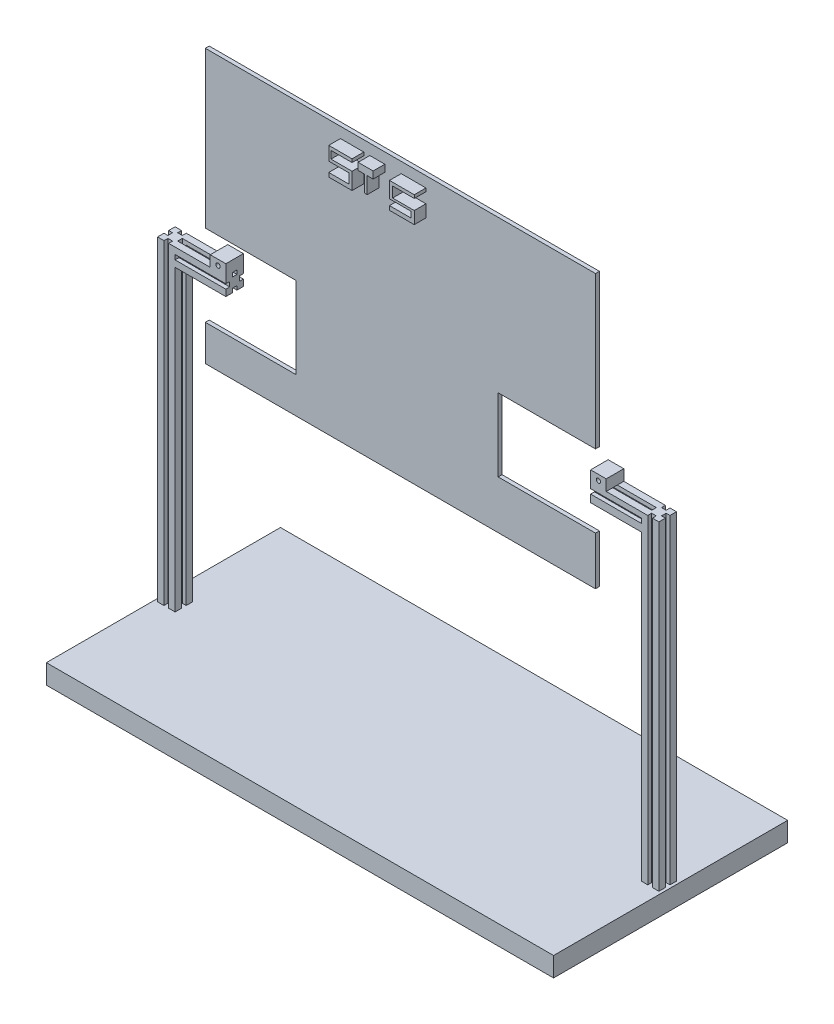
ISO-10303-21;
HEADER;
FILE_DESCRIPTION(('STEP AP214'),'2;1');
FILE_NAME('part.step','',(''),(''),'','','');
FILE_SCHEMA(('AUTOMOTIVE_DESIGN { 1 0 10303 214 1 1 1 1 }'));
ENDSEC;
DATA;
#1=APPLICATION_CONTEXT('core data for automotive mechanical design processes');
#2=APPLICATION_PROTOCOL_DEFINITION('international standard','automotive_design',2000,#1);
#3=PRODUCT_CONTEXT('',#1,'mechanical');
#4=PRODUCT('Part','Part','',(#3));
#5=PRODUCT_RELATED_PRODUCT_CATEGORY('part','',(#4));
#6=PRODUCT_DEFINITION_FORMATION('','',#4);
#7=PRODUCT_DEFINITION_CONTEXT('part definition',#1,'design');
#8=PRODUCT_DEFINITION('design','',#6,#7);
#9=PRODUCT_DEFINITION_SHAPE('','',#8);
#10=(LENGTH_UNIT() NAMED_UNIT(*) SI_UNIT(.MILLI.,.METRE.));
#11=(NAMED_UNIT(*) PLANE_ANGLE_UNIT() SI_UNIT($,.RADIAN.));
#12=(NAMED_UNIT(*) SI_UNIT($,.STERADIAN.) SOLID_ANGLE_UNIT());
#13=UNCERTAINTY_MEASURE_WITH_UNIT(LENGTH_MEASURE(1.E-05),#10,'distance_accuracy_value','');
#14=(GEOMETRIC_REPRESENTATION_CONTEXT(3) GLOBAL_UNCERTAINTY_ASSIGNED_CONTEXT((#13)) GLOBAL_UNIT_ASSIGNED_CONTEXT((#10,
#11,#12)) REPRESENTATION_CONTEXT('',''));
#15=CARTESIAN_POINT('',(0.,0.,0.));
#16=DIRECTION('',(0.,0.,1.));
#17=DIRECTION('',(1.,0.,0.));
#18=AXIS2_PLACEMENT_3D('',#15,#16,#17);
#19=CARTESIAN_POINT('',(0.,0.,32.5));
#20=DIRECTION('',(0.,0.,1.));
#21=DIRECTION('',(1.,0.,0.));
#22=AXIS2_PLACEMENT_3D('',#19,#20,#21);
#23=PLANE('',#22);
#24=DIRECTION('',(1.,0.,0.));
#25=VECTOR('',#24,1.);
#26=CARTESIAN_POINT('',(0.,1304.7021444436,32.5));
#27=LINE('',#26,#25);
#28=CARTESIAN_POINT('',(-88.4092779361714,1304.7021444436,32.5));
#29=VERTEX_POINT('',#28);
#30=CARTESIAN_POINT('',(-71.6809661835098,1304.7021444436,32.5));
#31=VERTEX_POINT('',#30);
#32=EDGE_CURVE('E351',#29,#31,#27,.T.);
#33=ORIENTED_EDGE('',*,*,#32,.F.);
#34=DIRECTION('',(0.,-1.,0.));
#35=VECTOR('',#34,1.);
#36=CARTESIAN_POINT('',(-88.4092779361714,0.,32.5));
#37=LINE('',#36,#35);
#38=CARTESIAN_POINT('',(-88.4092779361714,1322.68756508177,32.5));
#39=VERTEX_POINT('',#38);
#40=EDGE_CURVE('E348',#39,#29,#37,.T.);
#41=ORIENTED_EDGE('',*,*,#40,.F.);
#42=DIRECTION('',(-1.,0.,0.));
#43=VECTOR('',#42,1.);
#44=CARTESIAN_POINT('',(0.,1322.68756508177,32.5));
#45=LINE('',#44,#43);
#46=CARTESIAN_POINT('',(-49.9341609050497,1322.68756508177,32.5));
#47=VERTEX_POINT('',#46);
#48=EDGE_CURVE('E361',#47,#39,#45,.T.);
#49=ORIENTED_EDGE('',*,*,#48,.F.);
#50=DIRECTION('',(0.,1.,0.));
#51=VECTOR('',#50,1.);
#52=CARTESIAN_POINT('',(-49.9341609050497,0.,32.5));
#53=LINE('',#52,#51);
#54=CARTESIAN_POINT('',(-49.9341609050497,1304.7021444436,32.5));
#55=VERTEX_POINT('',#54);
#56=EDGE_CURVE('E388',#55,#47,#53,.T.);
#57=ORIENTED_EDGE('',*,*,#56,.F.);
#58=DIRECTION('',(1.,0.,0.));
#59=VECTOR('',#58,1.);
#60=CARTESIAN_POINT('',(0.,1304.7021444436,32.5));
#61=LINE('',#60,#59);
#62=CARTESIAN_POINT('',(-65.148430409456,1304.7021444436,32.5));
#63=VERTEX_POINT('',#62);
#64=EDGE_CURVE('E386',#63,#55,#61,.T.);
#65=ORIENTED_EDGE('',*,*,#64,.F.);
#66=DIRECTION('',(0.,1.,0.));
#67=VECTOR('',#66,1.);
#68=CARTESIAN_POINT('',(-65.148430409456,0.,32.5));
#69=LINE('',#68,#67);
#70=CARTESIAN_POINT('',(-65.148430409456,1262.48659346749,32.5));
#71=VERTEX_POINT('',#70);
#72=EDGE_CURVE('E384',#71,#63,#69,.T.);
#73=ORIENTED_EDGE('',*,*,#72,.F.);
#74=DIRECTION('',(1.,0.,0.));
#75=VECTOR('',#74,1.);
#76=CARTESIAN_POINT('',(0.,1262.48659346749,32.5));
#77=LINE('',#76,#75);
#78=CARTESIAN_POINT('',(-71.6809661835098,1262.48659346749,32.5));
#79=VERTEX_POINT('',#78);
#80=EDGE_CURVE('E382',#79,#71,#77,.T.);
#81=ORIENTED_EDGE('',*,*,#80,.F.);
#82=DIRECTION('',(0.,1.,0.));
#83=VECTOR('',#82,1.);
#84=CARTESIAN_POINT('',(-71.6809661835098,0.,32.5));
#85=LINE('',#84,#83);
#86=EDGE_CURVE('E379',#79,#31,#85,.T.);
#87=ORIENTED_EDGE('',*,*,#86,.T.);
#88=EDGE_LOOP('',(#33,#41,#49,#57,#65,#73,#81,#87));
#89=FACE_BOUND('',#88,.T.);
#90=DIRECTION('',(-1.,0.,0.));
#91=VECTOR('',#90,1.);
#92=CARTESIAN_POINT('',(0.,1314.34435990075,32.5));
#93=LINE('',#92,#91);
#94=CARTESIAN_POINT('',(-103.90712438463,1314.34435990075,32.5));
#95=VERTEX_POINT('',#94);
#96=CARTESIAN_POINT('',(-157.866030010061,1314.34435990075,32.5));
#97=VERTEX_POINT('',#96);
#98=EDGE_CURVE('E411',#95,#97,#93,.T.);
#99=ORIENTED_EDGE('',*,*,#98,.T.);
#100=DIRECTION('',(0.,1.,0.));
#101=VECTOR('',#100,1.);
#102=CARTESIAN_POINT('',(-157.866030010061,0.,32.5));
#103=LINE('',#102,#101);
#104=CARTESIAN_POINT('',(-157.866030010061,1295.05992898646,32.5));
#105=VERTEX_POINT('',#104);
#106=EDGE_CURVE('E416',#105,#97,#103,.T.);
#107=ORIENTED_EDGE('',*,*,#106,.F.);
#108=DIRECTION('',(-1.,0.,0.));
#109=VECTOR('',#108,1.);
#110=CARTESIAN_POINT('',(0.,1295.05992898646,32.5));
#111=LINE('',#110,#109);
#112=CARTESIAN_POINT('',(-103.90712438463,1295.05992898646,32.5));
#113=VERTEX_POINT('',#112);
#114=EDGE_CURVE('E459',#113,#105,#111,.T.);
#115=ORIENTED_EDGE('',*,*,#114,.F.);
#116=DIRECTION('',(0.,1.,0.));
#117=VECTOR('',#116,1.);
#118=CARTESIAN_POINT('',(-103.90712438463,0.,32.5));
#119=LINE('',#118,#117);
#120=CARTESIAN_POINT('',(-103.90712438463,1252.18945918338,32.5));
#121=VERTEX_POINT('',#120);
#122=EDGE_CURVE('E457',#121,#113,#119,.T.);
#123=ORIENTED_EDGE('',*,*,#122,.F.);
#124=DIRECTION('',(1.,0.,0.));
#125=VECTOR('',#124,1.);
#126=CARTESIAN_POINT('',(0.,1252.18945918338,32.5));
#127=LINE('',#126,#125);
#128=CARTESIAN_POINT('',(-163.686680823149,1252.18945918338,32.5));
#129=VERTEX_POINT('',#128);
#130=EDGE_CURVE('E455',#129,#121,#127,.T.);
#131=ORIENTED_EDGE('',*,*,#130,.F.);
#132=DIRECTION('',(0.,-1.,0.));
#133=VECTOR('',#132,1.);
#134=CARTESIAN_POINT('',(-163.686680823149,0.,32.5));
#135=LINE('',#134,#133);
#136=CARTESIAN_POINT('',(-163.686680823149,1262.48659346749,32.5));
#137=VERTEX_POINT('',#136);
#138=EDGE_CURVE('E453',#137,#129,#135,.T.);
#139=ORIENTED_EDGE('',*,*,#138,.F.);
#140=DIRECTION('',(-1.,0.,0.));
#141=VECTOR('',#140,1.);
#142=CARTESIAN_POINT('',(0.,1262.48659346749,32.5));
#143=LINE('',#142,#141);
#144=CARTESIAN_POINT('',(-111.828914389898,1262.48659346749,32.5));
#145=VERTEX_POINT('',#144);
#146=EDGE_CURVE('E451',#145,#137,#143,.T.);
#147=ORIENTED_EDGE('',*,*,#146,.F.);
#148=DIRECTION('',(0.,-1.,0.));
#149=VECTOR('',#148,1.);
#150=CARTESIAN_POINT('',(-111.828914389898,0.,32.5));
#151=LINE('',#150,#149);
#152=CARTESIAN_POINT('',(-111.828914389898,1287.57906109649,32.5));
#153=VERTEX_POINT('',#152);
#154=EDGE_CURVE('E449',#153,#145,#151,.T.);
#155=ORIENTED_EDGE('',*,*,#154,.F.);
#156=DIRECTION('',(1.,0.,0.));
#157=VECTOR('',#156,1.);
#158=CARTESIAN_POINT('',(0.,1287.57906109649,32.5));
#159=LINE('',#158,#157);
#160=CARTESIAN_POINT('',(-163.686680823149,1287.57906109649,32.5));
#161=VERTEX_POINT('',#160);
#162=EDGE_CURVE('E447',#161,#153,#159,.T.);
#163=ORIENTED_EDGE('',*,*,#162,.F.);
#164=DIRECTION('',(0.,-1.,0.));
#165=VECTOR('',#164,1.);
#166=CARTESIAN_POINT('',(-163.686680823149,0.,32.5));
#167=LINE('',#166,#165);
#168=CARTESIAN_POINT('',(-163.686680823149,1322.68756508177,32.5));
#169=VERTEX_POINT('',#168);
#170=EDGE_CURVE('E445',#169,#161,#167,.T.);
#171=ORIENTED_EDGE('',*,*,#170,.F.);
#172=DIRECTION('',(-1.,0.,0.));
#173=VECTOR('',#172,1.);
#174=CARTESIAN_POINT('',(0.,1322.68756508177,32.5));
#175=LINE('',#174,#173);
#176=CARTESIAN_POINT('',(-103.90712438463,1322.68756508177,32.5));
#177=VERTEX_POINT('',#176);
#178=EDGE_CURVE('E443',#177,#169,#175,.T.);
#179=ORIENTED_EDGE('',*,*,#178,.F.);
#180=DIRECTION('',(0.,1.,0.));
#181=VECTOR('',#180,1.);
#182=CARTESIAN_POINT('',(-103.90712438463,0.,32.5));
#183=LINE('',#182,#181);
#184=EDGE_CURVE('E441',#95,#177,#183,.T.);
#185=ORIENTED_EDGE('',*,*,#184,.F.);
#186=EDGE_LOOP('',(#99,#107,#115,#123,#131,#139,#147,#155,#163,#171,#179,#185));
#187=FACE_BOUND('',#186,.T.);
#188=DIRECTION('',(1.,0.,0.));
#189=VECTOR('',#188,1.);
#190=CARTESIAN_POINT('',(0.,950.833506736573,32.5));
#191=LINE('',#190,#189);
#192=CARTESIAN_POINT('',(-510.093427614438,950.833506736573,32.5));
#193=VERTEX_POINT('',#192);
#194=CARTESIAN_POINT('',(-277.19790507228,950.833506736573,32.5));
#195=VERTEX_POINT('',#194);
#196=EDGE_CURVE('E497',#193,#195,#191,.T.);
#197=ORIENTED_EDGE('',*,*,#196,.T.);
#198=DIRECTION('',(0.,-1.,0.));
#199=VECTOR('',#198,1.);
#200=CARTESIAN_POINT('',(-277.19790507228,0.,32.5));
#201=LINE('',#200,#199);
#202=CARTESIAN_POINT('',(-277.19790507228,741.751681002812,32.5));
#203=VERTEX_POINT('',#202);
#204=EDGE_CURVE('E500',#195,#203,#201,.T.);
#205=ORIENTED_EDGE('',*,*,#204,.T.);
#206=DIRECTION('',(-1.,0.,0.));
#207=VECTOR('',#206,1.);
#208=CARTESIAN_POINT('',(0.,741.751681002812,32.5));
#209=LINE('',#208,#207);
#210=CARTESIAN_POINT('',(-510.093427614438,741.751681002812,32.5));
#211=VERTEX_POINT('',#210);
#212=EDGE_CURVE('E503',#203,#211,#209,.T.);
#213=ORIENTED_EDGE('',*,*,#212,.T.);
#214=DIRECTION('',(0.,-1.,0.));
#215=VECTOR('',#214,1.);
#216=CARTESIAN_POINT('',(-510.093427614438,0.,32.5));
#217=LINE('',#216,#215);
#218=CARTESIAN_POINT('',(-510.093427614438,650.,32.5));
#219=VERTEX_POINT('',#218);
#220=EDGE_CURVE('E505',#211,#219,#217,.T.);
#221=ORIENTED_EDGE('',*,*,#220,.T.);
#222=DIRECTION('',(1.,0.,0.));
#223=VECTOR('',#222,1.);
#224=CARTESIAN_POINT('',(0.,650.,32.5));
#225=LINE('',#224,#223);
#226=CARTESIAN_POINT('',(489.906572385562,650.,32.5));
#227=VERTEX_POINT('',#226);
#228=EDGE_CURVE('E507',#219,#227,#225,.T.);
#229=ORIENTED_EDGE('',*,*,#228,.T.);
#230=DIRECTION('',(0.,-1.,0.));
#231=VECTOR('',#230,1.);
#232=CARTESIAN_POINT('',(489.906572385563,6.59150854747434E-13,32.5));
#233=LINE('',#232,#231);
#234=CARTESIAN_POINT('',(489.906572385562,773.77414502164,32.5));
#235=VERTEX_POINT('',#234);
#236=EDGE_CURVE('E509',#235,#227,#233,.T.);
#237=ORIENTED_EDGE('',*,*,#236,.F.);
#238=DIRECTION('',(1.,0.,0.));
#239=VECTOR('',#238,1.);
#240=CARTESIAN_POINT('',(0.,773.77414502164,32.5));
#241=LINE('',#240,#239);
#242=CARTESIAN_POINT('',(240.498596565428,773.77414502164,32.5));
#243=VERTEX_POINT('',#242);
#244=EDGE_CURVE('E512',#243,#235,#241,.T.);
#245=ORIENTED_EDGE('',*,*,#244,.F.);
#246=DIRECTION('',(0.,-1.,0.));
#247=VECTOR('',#246,1.);
#248=CARTESIAN_POINT('',(240.498596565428,0.,32.5));
#249=LINE('',#248,#247);
#250=CARTESIAN_POINT('',(240.498596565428,960.571851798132,32.5));
#251=VERTEX_POINT('',#250);
#252=EDGE_CURVE('E515',#251,#243,#249,.T.);
#253=ORIENTED_EDGE('',*,*,#252,.F.);
#254=DIRECTION('',(-1.,0.,0.));
#255=VECTOR('',#254,1.);
#256=CARTESIAN_POINT('',(0.,960.571851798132,32.5));
#257=LINE('',#256,#255);
#258=CARTESIAN_POINT('',(489.906572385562,960.571851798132,32.5));
#259=VERTEX_POINT('',#258);
#260=EDGE_CURVE('E518',#259,#251,#257,.T.);
#261=ORIENTED_EDGE('',*,*,#260,.F.);
#262=DIRECTION('',(0.,-1.,0.));
#263=VECTOR('',#262,1.);
#264=CARTESIAN_POINT('',(489.906572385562,0.,32.5));
#265=LINE('',#264,#263);
#266=CARTESIAN_POINT('',(489.906572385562,1350.,32.5));
#267=VERTEX_POINT('',#266);
#268=EDGE_CURVE('E521',#267,#259,#265,.T.);
#269=ORIENTED_EDGE('',*,*,#268,.F.);
#270=DIRECTION('',(1.,0.,0.));
#271=VECTOR('',#270,1.);
#272=CARTESIAN_POINT('',(0.,1350.,32.5));
#273=LINE('',#272,#271);
#274=CARTESIAN_POINT('',(-510.093427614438,1350.,32.5));
#275=VERTEX_POINT('',#274);
#276=EDGE_CURVE('E524',#275,#267,#273,.T.);
#277=ORIENTED_EDGE('',*,*,#276,.F.);
#278=DIRECTION('',(0.,-1.,0.));
#279=VECTOR('',#278,1.);
#280=CARTESIAN_POINT('',(-510.093427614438,0.,32.5));
#281=LINE('',#280,#279);
#282=EDGE_CURVE('E527',#275,#193,#281,.T.);
#283=ORIENTED_EDGE('',*,*,#282,.T.);
#284=EDGE_LOOP('',(#197,#205,#213,#221,#229,#237,#245,#253,#261,#269,#277,#283));
#285=FACE_BOUND('',#284,.T.);
#286=DIRECTION('',(0.,1.,0.));
#287=VECTOR('',#286,1.);
#288=CARTESIAN_POINT('',(55.4542031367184,0.,32.5));
#289=LINE('',#288,#287);
#290=CARTESIAN_POINT('',(55.4542031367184,1256.24005885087,32.5));
#291=VERTEX_POINT('',#290);
#292=CARTESIAN_POINT('',(55.4542031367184,1287.57906109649,32.5));
#293=VERTEX_POINT('',#292);
#294=EDGE_CURVE('E60',#291,#293,#289,.T.);
#295=ORIENTED_EDGE('',*,*,#294,.F.);
#296=DIRECTION('',(1.,0.,0.));
#297=VECTOR('',#296,1.);
#298=CARTESIAN_POINT('',(0.,1256.24005885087,32.5));
#299=LINE('',#298,#297);
#300=CARTESIAN_POINT('',(-8.05039489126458,1256.24005885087,32.5));
#301=VERTEX_POINT('',#300);
#302=EDGE_CURVE('E347',#301,#291,#299,.T.);
#303=ORIENTED_EDGE('',*,*,#302,.F.);
#304=DIRECTION('',(0.,1.,0.));
#305=VECTOR('',#304,1.);
#306=CARTESIAN_POINT('',(-8.05039489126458,0.,32.5));
#307=LINE('',#306,#305);
#308=CARTESIAN_POINT('',(-8.05039489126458,1266.74084699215,32.5));
#309=VERTEX_POINT('',#308);
#310=EDGE_CURVE('E344',#301,#309,#307,.T.);
#311=ORIENTED_EDGE('',*,*,#310,.T.);
#312=DIRECTION('',(-1.,0.,0.));
#313=VECTOR('',#312,1.);
#314=CARTESIAN_POINT('',(0.,1266.74084699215,32.5));
#315=LINE('',#314,#313);
#316=CARTESIAN_POINT('',(47.0787428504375,1266.74084699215,32.5));
#317=VERTEX_POINT('',#316);
#318=EDGE_CURVE('E1056',#317,#309,#315,.T.);
#319=ORIENTED_EDGE('',*,*,#318,.F.);
#320=DIRECTION('',(0.,-1.,0.));
#321=VECTOR('',#320,1.);
#322=CARTESIAN_POINT('',(47.0787428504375,0.,32.5));
#323=LINE('',#322,#321);
#324=CARTESIAN_POINT('',(47.0787428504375,1281.83572994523,32.5));
#325=VERTEX_POINT('',#324);
#326=EDGE_CURVE('E1058',#325,#317,#323,.T.);
#327=ORIENTED_EDGE('',*,*,#326,.F.);
#328=DIRECTION('',(1.,0.,0.));
#329=VECTOR('',#328,1.);
#330=CARTESIAN_POINT('',(0.,1281.83572994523,32.5));
#331=LINE('',#330,#329);
#332=CARTESIAN_POINT('',(-8.05039489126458,1281.83572994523,32.5));
#333=VERTEX_POINT('',#332);
#334=EDGE_CURVE('E1106',#333,#325,#331,.T.);
#335=ORIENTED_EDGE('',*,*,#334,.F.);
#336=DIRECTION('',(0.,-1.,0.));
#337=VECTOR('',#336,1.);
#338=CARTESIAN_POINT('',(-8.05039489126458,0.,32.5));
#339=LINE('',#338,#337);
#340=CARTESIAN_POINT('',(-8.05039489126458,1322.68756508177,32.5));
#341=VERTEX_POINT('',#340);
#342=EDGE_CURVE('E1103',#341,#333,#339,.T.);
#343=ORIENTED_EDGE('',*,*,#342,.F.);
#344=DIRECTION('',(-1.,0.,0.));
#345=VECTOR('',#344,1.);
#346=CARTESIAN_POINT('',(0.,1322.68756508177,32.5));
#347=LINE('',#346,#345);
#348=CARTESIAN_POINT('',(55.4542031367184,1322.68756508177,32.5));
#349=VERTEX_POINT('',#348);
#350=EDGE_CURVE('E1100',#349,#341,#347,.T.);
#351=ORIENTED_EDGE('',*,*,#350,.F.);
#352=DIRECTION('',(0.,1.,0.));
#353=VECTOR('',#352,1.);
#354=CARTESIAN_POINT('',(55.4542031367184,0.,32.5));
#355=LINE('',#354,#353);
#356=CARTESIAN_POINT('',(55.4542031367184,1314.34435990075,32.5));
#357=VERTEX_POINT('',#356);
#358=EDGE_CURVE('E1097',#357,#349,#355,.T.);
#359=ORIENTED_EDGE('',*,*,#358,.F.);
#360=DIRECTION('',(-1.,0.,0.));
#361=VECTOR('',#360,1.);
#362=CARTESIAN_POINT('',(0.,1314.34435990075,32.5));
#363=LINE('',#362,#361);
#364=CARTESIAN_POINT('',(0.,1314.34435990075,32.5));
#365=VERTEX_POINT('',#364);
#366=EDGE_CURVE('E1091',#357,#365,#363,.T.);
#367=ORIENTED_EDGE('',*,*,#366,.T.);
#368=DIRECTION('',(0.,-1.,0.));
#369=VECTOR('',#368,1.);
#370=CARTESIAN_POINT('',(0.,0.,32.5));
#371=LINE('',#370,#369);
#372=CARTESIAN_POINT('',(0.,1287.57906109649,32.5));
#373=VERTEX_POINT('',#372);
#374=EDGE_CURVE('E1087',#365,#373,#371,.T.);
#375=ORIENTED_EDGE('',*,*,#374,.T.);
#376=DIRECTION('',(1.,0.,0.));
#377=VECTOR('',#376,1.);
#378=CARTESIAN_POINT('',(0.,1287.57906109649,32.5));
#379=LINE('',#378,#377);
#380=EDGE_CURVE('E65',#373,#293,#379,.T.);
#381=ORIENTED_EDGE('',*,*,#380,.T.);
#382=EDGE_LOOP('',(#295,#303,#311,#319,#327,#335,#343,#351,#359,#367,#375,#381));
#383=FACE_BOUND('',#382,.T.);
#384=ADVANCED_FACE('F45',(#89,#187,#285,#383),#23,.T.);
#385=CARTESIAN_POINT('',(0.,950.833506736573,32.5));
#386=DIRECTION('',(0.,1.,0.));
#387=DIRECTION('',(0.,0.,1.));
#388=AXIS2_PLACEMENT_3D('',#385,#386,#387);
#389=PLANE('',#388);
#390=DIRECTION('',(1.,0.,0.));
#391=VECTOR('',#390,1.);
#392=CARTESIAN_POINT('',(0.,950.833506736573,22.5));
#393=LINE('',#392,#391);
#394=CARTESIAN_POINT('',(-510.093427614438,950.833506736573,22.5));
#395=VERTEX_POINT('',#394);
#396=CARTESIAN_POINT('',(-277.19790507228,950.833506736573,22.5));
#397=VERTEX_POINT('',#396);
#398=EDGE_CURVE('E496',#395,#397,#393,.T.);
#399=ORIENTED_EDGE('',*,*,#398,.T.);
#400=DIRECTION('',(0.,0.,-1.));
#401=VECTOR('',#400,1.);
#402=CARTESIAN_POINT('',(-277.19790507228,950.833506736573,32.5));
#403=LINE('',#402,#401);
#404=EDGE_CURVE('E12',#195,#397,#403,.T.);
#405=ORIENTED_EDGE('',*,*,#404,.F.);
#406=ORIENTED_EDGE('',*,*,#196,.F.);
#407=DIRECTION('',(0.,0.,-1.));
#408=VECTOR('',#407,1.);
#409=CARTESIAN_POINT('',(-510.093427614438,950.833506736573,32.5));
#410=LINE('',#409,#408);
#411=EDGE_CURVE('E529',#193,#395,#410,.T.);
#412=ORIENTED_EDGE('',*,*,#411,.T.);
#413=EDGE_LOOP('',(#399,#405,#406,#412));
#414=FACE_BOUND('',#413,.T.);
#415=ADVANCED_FACE('F47',(#414),#389,.F.);
#416=CARTESIAN_POINT('',(-277.19790507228,0.,32.5));
#417=DIRECTION('',(1.,0.,0.));
#418=DIRECTION('',(0.,0.,-1.));
#419=AXIS2_PLACEMENT_3D('',#416,#417,#418);
#420=PLANE('',#419);
#421=DIRECTION('',(0.,-1.,0.));
#422=VECTOR('',#421,1.);
#423=CARTESIAN_POINT('',(-277.19790507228,0.,22.5));
#424=LINE('',#423,#422);
#425=CARTESIAN_POINT('',(-277.19790507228,741.751681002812,22.5));
#426=VERTEX_POINT('',#425);
#427=EDGE_CURVE('E532',#397,#426,#424,.T.);
#428=ORIENTED_EDGE('',*,*,#427,.T.);
#429=DIRECTION('',(0.,0.,-1.));
#430=VECTOR('',#429,1.);
#431=CARTESIAN_POINT('',(-277.19790507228,741.751681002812,32.5));
#432=LINE('',#431,#430);
#433=EDGE_CURVE('E53',#203,#426,#432,.T.);
#434=ORIENTED_EDGE('',*,*,#433,.F.);
#435=ORIENTED_EDGE('',*,*,#204,.F.);
#436=ORIENTED_EDGE('',*,*,#404,.T.);
#437=EDGE_LOOP('',(#428,#434,#435,#436));
#438=FACE_BOUND('',#437,.T.);
#439=ADVANCED_FACE('F607',(#438),#420,.F.);
#440=CARTESIAN_POINT('',(0.,741.751681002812,32.5));
#441=DIRECTION('',(0.,-1.,0.));
#442=DIRECTION('',(0.,0.,-1.));
#443=AXIS2_PLACEMENT_3D('',#440,#441,#442);
#444=PLANE('',#443);
#445=DIRECTION('',(-1.,0.,0.));
#446=VECTOR('',#445,1.);
#447=CARTESIAN_POINT('',(0.,741.751681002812,22.5));
#448=LINE('',#447,#446);
#449=CARTESIAN_POINT('',(-510.093427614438,741.751681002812,22.5));
#450=VERTEX_POINT('',#449);
#451=EDGE_CURVE('E534',#426,#450,#448,.T.);
#452=ORIENTED_EDGE('',*,*,#451,.T.);
#453=DIRECTION('',(0.,0.,-1.));
#454=VECTOR('',#453,1.);
#455=CARTESIAN_POINT('',(-510.093427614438,741.751681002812,32.5));
#456=LINE('',#455,#454);
#457=EDGE_CURVE('E579',#211,#450,#456,.T.);
#458=ORIENTED_EDGE('',*,*,#457,.F.);
#459=ORIENTED_EDGE('',*,*,#212,.F.);
#460=ORIENTED_EDGE('',*,*,#433,.T.);
#461=EDGE_LOOP('',(#452,#458,#459,#460));
#462=FACE_BOUND('',#461,.T.);
#463=ADVANCED_FACE('F586',(#462),#444,.F.);
#464=CARTESIAN_POINT('',(-510.093427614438,0.,32.5));
#465=DIRECTION('',(1.,0.,0.));
#466=DIRECTION('',(0.,0.,-1.));
#467=AXIS2_PLACEMENT_3D('',#464,#465,#466);
#468=PLANE('',#467);
#469=DIRECTION('',(0.,-1.,0.));
#470=VECTOR('',#469,1.);
#471=CARTESIAN_POINT('',(-510.093427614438,0.,22.5));
#472=LINE('',#471,#470);
#473=CARTESIAN_POINT('',(-510.093427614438,650.,22.5));
#474=VERTEX_POINT('',#473);
#475=EDGE_CURVE('E536',#450,#474,#472,.T.);
#476=ORIENTED_EDGE('',*,*,#475,.T.);
#477=DIRECTION('',(0.,0.,-1.));
#478=VECTOR('',#477,1.);
#479=CARTESIAN_POINT('',(-510.093427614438,650.,32.5));
#480=LINE('',#479,#478);
#481=EDGE_CURVE('E576',#219,#474,#480,.T.);
#482=ORIENTED_EDGE('',*,*,#481,.F.);
#483=ORIENTED_EDGE('',*,*,#220,.F.);
#484=ORIENTED_EDGE('',*,*,#457,.T.);
#485=EDGE_LOOP('',(#476,#482,#483,#484));
#486=FACE_BOUND('',#485,.T.);
#487=ADVANCED_FACE('F596',(#486),#468,.F.);
#488=CARTESIAN_POINT('',(0.,650.,32.5));
#489=DIRECTION('',(0.,1.,0.));
#490=DIRECTION('',(0.,0.,1.));
#491=AXIS2_PLACEMENT_3D('',#488,#489,#490);
#492=PLANE('',#491);
#493=DIRECTION('',(1.,0.,0.));
#494=VECTOR('',#493,1.);
#495=CARTESIAN_POINT('',(0.,650.,22.5));
#496=LINE('',#495,#494);
#497=CARTESIAN_POINT('',(489.906572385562,650.,22.5));
#498=VERTEX_POINT('',#497);
#499=EDGE_CURVE('E538',#474,#498,#496,.T.);
#500=ORIENTED_EDGE('',*,*,#499,.T.);
#501=DIRECTION('',(0.,0.,-1.));
#502=VECTOR('',#501,1.);
#503=CARTESIAN_POINT('',(489.906572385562,650.,32.5));
#504=LINE('',#503,#502);
#505=EDGE_CURVE('E574',#227,#498,#504,.T.);
#506=ORIENTED_EDGE('',*,*,#505,.F.);
#507=ORIENTED_EDGE('',*,*,#228,.F.);
#508=ORIENTED_EDGE('',*,*,#481,.T.);
#509=EDGE_LOOP('',(#500,#506,#507,#508));
#510=FACE_BOUND('',#509,.T.);
#511=ADVANCED_FACE('F600',(#510),#492,.F.);
#512=CARTESIAN_POINT('',(489.906572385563,6.59150854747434E-13,32.5));
#513=DIRECTION('',(1.,0.,0.));
#514=DIRECTION('',(0.,1.,0.));
#515=AXIS2_PLACEMENT_3D('',#512,#513,#514);
#516=PLANE('',#515);
#517=DIRECTION('',(0.,-1.,0.));
#518=VECTOR('',#517,1.);
#519=CARTESIAN_POINT('',(489.906572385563,6.59150854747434E-13,22.5));
#520=LINE('',#519,#518);
#521=CARTESIAN_POINT('',(489.906572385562,773.77414502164,22.5));
#522=VERTEX_POINT('',#521);
#523=EDGE_CURVE('E541',#522,#498,#520,.T.);
#524=ORIENTED_EDGE('',*,*,#523,.F.);
#525=DIRECTION('',(0.,0.,-1.));
#526=VECTOR('',#525,1.);
#527=CARTESIAN_POINT('',(489.906572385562,773.77414502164,32.5));
#528=LINE('',#527,#526);
#529=EDGE_CURVE('E572',#235,#522,#528,.T.);
#530=ORIENTED_EDGE('',*,*,#529,.F.);
#531=ORIENTED_EDGE('',*,*,#236,.T.);
#532=ORIENTED_EDGE('',*,*,#505,.T.);
#533=EDGE_LOOP('',(#524,#530,#531,#532));
#534=FACE_BOUND('',#533,.T.);
#535=ADVANCED_FACE('F634',(#534),#516,.T.);
#536=CARTESIAN_POINT('',(0.,773.77414502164,32.5));
#537=DIRECTION('',(0.,1.,0.));
#538=DIRECTION('',(0.,0.,1.));
#539=AXIS2_PLACEMENT_3D('',#536,#537,#538);
#540=PLANE('',#539);
#541=DIRECTION('',(1.,0.,0.));
#542=VECTOR('',#541,1.);
#543=CARTESIAN_POINT('',(0.,773.77414502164,22.5));
#544=LINE('',#543,#542);
#545=CARTESIAN_POINT('',(240.498596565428,773.77414502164,22.5));
#546=VERTEX_POINT('',#545);
#547=EDGE_CURVE('E544',#546,#522,#544,.T.);
#548=ORIENTED_EDGE('',*,*,#547,.F.);
#549=DIRECTION('',(0.,0.,-1.));
#550=VECTOR('',#549,1.);
#551=CARTESIAN_POINT('',(240.498596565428,773.77414502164,32.5));
#552=LINE('',#551,#550);
#553=EDGE_CURVE('E570',#243,#546,#552,.T.);
#554=ORIENTED_EDGE('',*,*,#553,.F.);
#555=ORIENTED_EDGE('',*,*,#244,.T.);
#556=ORIENTED_EDGE('',*,*,#529,.T.);
#557=EDGE_LOOP('',(#548,#554,#555,#556));
#558=FACE_BOUND('',#557,.T.);
#559=ADVANCED_FACE('F631',(#558),#540,.T.);
#560=CARTESIAN_POINT('',(240.498596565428,0.,32.5));
#561=DIRECTION('',(1.,0.,0.));
#562=DIRECTION('',(0.,0.,-1.));
#563=AXIS2_PLACEMENT_3D('',#560,#561,#562);
#564=PLANE('',#563);
#565=DIRECTION('',(0.,-1.,0.));
#566=VECTOR('',#565,1.);
#567=CARTESIAN_POINT('',(240.498596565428,0.,22.5));
#568=LINE('',#567,#566);
#569=CARTESIAN_POINT('',(240.498596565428,960.571851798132,22.5));
#570=VERTEX_POINT('',#569);
#571=EDGE_CURVE('E547',#570,#546,#568,.T.);
#572=ORIENTED_EDGE('',*,*,#571,.F.);
#573=DIRECTION('',(0.,0.,-1.));
#574=VECTOR('',#573,1.);
#575=CARTESIAN_POINT('',(240.498596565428,960.571851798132,32.5));
#576=LINE('',#575,#574);
#577=EDGE_CURVE('E568',#251,#570,#576,.T.);
#578=ORIENTED_EDGE('',*,*,#577,.F.);
#579=ORIENTED_EDGE('',*,*,#252,.T.);
#580=ORIENTED_EDGE('',*,*,#553,.T.);
#581=EDGE_LOOP('',(#572,#578,#579,#580));
#582=FACE_BOUND('',#581,.T.);
#583=ADVANCED_FACE('F628',(#582),#564,.T.);
#584=CARTESIAN_POINT('',(0.,960.571851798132,32.5));
#585=DIRECTION('',(0.,-1.,0.));
#586=DIRECTION('',(0.,0.,-1.));
#587=AXIS2_PLACEMENT_3D('',#584,#585,#586);
#588=PLANE('',#587);
#589=DIRECTION('',(-1.,0.,0.));
#590=VECTOR('',#589,1.);
#591=CARTESIAN_POINT('',(0.,960.571851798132,22.5));
#592=LINE('',#591,#590);
#593=CARTESIAN_POINT('',(489.906572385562,960.571851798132,22.5));
#594=VERTEX_POINT('',#593);
#595=EDGE_CURVE('E550',#594,#570,#592,.T.);
#596=ORIENTED_EDGE('',*,*,#595,.F.);
#597=DIRECTION('',(0.,0.,-1.));
#598=VECTOR('',#597,1.);
#599=CARTESIAN_POINT('',(489.906572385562,960.571851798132,32.5));
#600=LINE('',#599,#598);
#601=EDGE_CURVE('E566',#259,#594,#600,.T.);
#602=ORIENTED_EDGE('',*,*,#601,.F.);
#603=ORIENTED_EDGE('',*,*,#260,.T.);
#604=ORIENTED_EDGE('',*,*,#577,.T.);
#605=EDGE_LOOP('',(#596,#602,#603,#604));
#606=FACE_BOUND('',#605,.T.);
#607=ADVANCED_FACE('F624',(#606),#588,.T.);
#608=CARTESIAN_POINT('',(489.906572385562,0.,32.5));
#609=DIRECTION('',(1.,0.,0.));
#610=DIRECTION('',(0.,0.,-1.));
#611=AXIS2_PLACEMENT_3D('',#608,#609,#610);
#612=PLANE('',#611);
#613=DIRECTION('',(0.,-1.,0.));
#614=VECTOR('',#613,1.);
#615=CARTESIAN_POINT('',(489.906572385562,0.,22.5));
#616=LINE('',#615,#614);
#617=CARTESIAN_POINT('',(489.906572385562,1350.,22.5));
#618=VERTEX_POINT('',#617);
#619=EDGE_CURVE('E553',#618,#594,#616,.T.);
#620=ORIENTED_EDGE('',*,*,#619,.F.);
#621=DIRECTION('',(0.,0.,-1.));
#622=VECTOR('',#621,1.);
#623=CARTESIAN_POINT('',(489.906572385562,1350.,32.5));
#624=LINE('',#623,#622);
#625=EDGE_CURVE('E564',#267,#618,#624,.T.);
#626=ORIENTED_EDGE('',*,*,#625,.F.);
#627=ORIENTED_EDGE('',*,*,#268,.T.);
#628=ORIENTED_EDGE('',*,*,#601,.T.);
#629=EDGE_LOOP('',(#620,#626,#627,#628));
#630=FACE_BOUND('',#629,.T.);
#631=ADVANCED_FACE('F620',(#630),#612,.T.);
#632=CARTESIAN_POINT('',(0.,1350.,32.5));
#633=DIRECTION('',(0.,1.,0.));
#634=DIRECTION('',(0.,0.,1.));
#635=AXIS2_PLACEMENT_3D('',#632,#633,#634);
#636=PLANE('',#635);
#637=DIRECTION('',(1.,0.,0.));
#638=VECTOR('',#637,1.);
#639=CARTESIAN_POINT('',(0.,1350.,22.5));
#640=LINE('',#639,#638);
#641=CARTESIAN_POINT('',(-510.093427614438,1350.,22.5));
#642=VERTEX_POINT('',#641);
#643=EDGE_CURVE('E556',#642,#618,#640,.T.);
#644=ORIENTED_EDGE('',*,*,#643,.F.);
#645=DIRECTION('',(0.,0.,-1.));
#646=VECTOR('',#645,1.);
#647=CARTESIAN_POINT('',(-510.093427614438,1350.,32.5));
#648=LINE('',#647,#646);
#649=EDGE_CURVE('E562',#275,#642,#648,.T.);
#650=ORIENTED_EDGE('',*,*,#649,.F.);
#651=ORIENTED_EDGE('',*,*,#276,.T.);
#652=ORIENTED_EDGE('',*,*,#625,.T.);
#653=EDGE_LOOP('',(#644,#650,#651,#652));
#654=FACE_BOUND('',#653,.T.);
#655=ADVANCED_FACE('F614',(#654),#636,.T.);
#656=CARTESIAN_POINT('',(-510.093427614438,0.,32.5));
#657=DIRECTION('',(1.,0.,0.));
#658=DIRECTION('',(0.,0.,-1.));
#659=AXIS2_PLACEMENT_3D('',#656,#657,#658);
#660=PLANE('',#659);
#661=DIRECTION('',(0.,-1.,0.));
#662=VECTOR('',#661,1.);
#663=CARTESIAN_POINT('',(-510.093427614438,0.,22.5));
#664=LINE('',#663,#662);
#665=EDGE_CURVE('E501',#642,#395,#664,.T.);
#666=ORIENTED_EDGE('',*,*,#665,.T.);
#667=ORIENTED_EDGE('',*,*,#411,.F.);
#668=ORIENTED_EDGE('',*,*,#282,.F.);
#669=ORIENTED_EDGE('',*,*,#649,.T.);
#670=EDGE_LOOP('',(#666,#667,#668,#669));
#671=FACE_BOUND('',#670,.T.);
#672=ADVANCED_FACE('F659',(#671),#660,.F.);
#673=CARTESIAN_POINT('',(0.,0.,22.5));
#674=DIRECTION('',(0.,0.,1.));
#675=DIRECTION('',(1.,0.,0.));
#676=AXIS2_PLACEMENT_3D('',#673,#674,#675);
#677=PLANE('',#676);
#678=ORIENTED_EDGE('',*,*,#398,.F.);
#679=ORIENTED_EDGE('',*,*,#665,.F.);
#680=ORIENTED_EDGE('',*,*,#643,.T.);
#681=ORIENTED_EDGE('',*,*,#619,.T.);
#682=ORIENTED_EDGE('',*,*,#595,.T.);
#683=ORIENTED_EDGE('',*,*,#571,.T.);
#684=ORIENTED_EDGE('',*,*,#547,.T.);
#685=ORIENTED_EDGE('',*,*,#523,.T.);
#686=ORIENTED_EDGE('',*,*,#499,.F.);
#687=ORIENTED_EDGE('',*,*,#475,.F.);
#688=ORIENTED_EDGE('',*,*,#451,.F.);
#689=ORIENTED_EDGE('',*,*,#427,.F.);
#690=EDGE_LOOP('',(#678,#679,#680,#681,#682,#683,#684,#685,#686,#687,#688,#689));
#691=FACE_BOUND('',#690,.T.);
#692=ADVANCED_FACE('F592',(#691),#677,.F.);
#693=CARTESIAN_POINT('',(0.,1314.34435990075,62.5));
#694=DIRECTION('',(0.,-1.,0.));
#695=DIRECTION('',(0.,0.,-1.));
#696=AXIS2_PLACEMENT_3D('',#693,#694,#695);
#697=PLANE('',#696);
#698=ORIENTED_EDGE('',*,*,#98,.F.);
#699=DIRECTION('',(0.,0.,-1.));
#700=VECTOR('',#699,1.);
#701=CARTESIAN_POINT('',(-103.90712438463,1314.34435990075,62.5));
#702=LINE('',#701,#700);
#703=CARTESIAN_POINT('',(-103.90712438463,1314.34435990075,62.5));
#704=VERTEX_POINT('',#703);
#705=EDGE_CURVE('E494',#704,#95,#702,.T.);
#706=ORIENTED_EDGE('',*,*,#705,.F.);
#707=DIRECTION('',(-1.,0.,0.));
#708=VECTOR('',#707,1.);
#709=CARTESIAN_POINT('',(0.,1314.34435990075,62.5));
#710=LINE('',#709,#708);
#711=CARTESIAN_POINT('',(-157.866030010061,1314.34435990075,62.5));
#712=VERTEX_POINT('',#711);
#713=EDGE_CURVE('E412',#704,#712,#710,.T.);
#714=ORIENTED_EDGE('',*,*,#713,.T.);
#715=DIRECTION('',(0.,0.,-1.));
#716=VECTOR('',#715,1.);
#717=CARTESIAN_POINT('',(-157.866030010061,1314.34435990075,62.5));
#718=LINE('',#717,#716);
#719=EDGE_CURVE('E438',#712,#97,#718,.T.);
#720=ORIENTED_EDGE('',*,*,#719,.T.);
#721=EDGE_LOOP('',(#698,#706,#714,#720));
#722=FACE_BOUND('',#721,.T.);
#723=ADVANCED_FACE('F655',(#722),#697,.T.);
#724=CARTESIAN_POINT('',(-103.90712438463,0.,62.5));
#725=DIRECTION('',(-1.,0.,0.));
#726=DIRECTION('',(0.,0.,1.));
#727=AXIS2_PLACEMENT_3D('',#724,#725,#726);
#728=PLANE('',#727);
#729=ORIENTED_EDGE('',*,*,#184,.T.);
#730=DIRECTION('',(0.,0.,-1.));
#731=VECTOR('',#730,1.);
#732=CARTESIAN_POINT('',(-103.90712438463,1322.68756508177,62.5));
#733=LINE('',#732,#731);
#734=CARTESIAN_POINT('',(-103.90712438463,1322.68756508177,62.5));
#735=VERTEX_POINT('',#734);
#736=EDGE_CURVE('E491',#735,#177,#733,.T.);
#737=ORIENTED_EDGE('',*,*,#736,.F.);
#738=DIRECTION('',(0.,1.,0.));
#739=VECTOR('',#738,1.);
#740=CARTESIAN_POINT('',(-103.90712438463,0.,62.5));
#741=LINE('',#740,#739);
#742=EDGE_CURVE('E415',#704,#735,#741,.T.);
#743=ORIENTED_EDGE('',*,*,#742,.F.);
#744=ORIENTED_EDGE('',*,*,#705,.T.);
#745=EDGE_LOOP('',(#729,#737,#743,#744));
#746=FACE_BOUND('',#745,.T.);
#747=ADVANCED_FACE('F702',(#746),#728,.F.);
#748=CARTESIAN_POINT('',(0.,1322.68756508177,62.5));
#749=DIRECTION('',(0.,-1.,0.));
#750=DIRECTION('',(0.,0.,-1.));
#751=AXIS2_PLACEMENT_3D('',#748,#749,#750);
#752=PLANE('',#751);
#753=ORIENTED_EDGE('',*,*,#178,.T.);
#754=DIRECTION('',(0.,0.,-1.));
#755=VECTOR('',#754,1.);
#756=CARTESIAN_POINT('',(-163.686680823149,1322.68756508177,62.5));
#757=LINE('',#756,#755);
#758=CARTESIAN_POINT('',(-163.686680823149,1322.68756508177,62.5));
#759=VERTEX_POINT('',#758);
#760=EDGE_CURVE('E488',#759,#169,#757,.T.);
#761=ORIENTED_EDGE('',*,*,#760,.F.);
#762=DIRECTION('',(-1.,0.,0.));
#763=VECTOR('',#762,1.);
#764=CARTESIAN_POINT('',(0.,1322.68756508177,62.5));
#765=LINE('',#764,#763);
#766=EDGE_CURVE('E418',#735,#759,#765,.T.);
#767=ORIENTED_EDGE('',*,*,#766,.F.);
#768=ORIENTED_EDGE('',*,*,#736,.T.);
#769=EDGE_LOOP('',(#753,#761,#767,#768));
#770=FACE_BOUND('',#769,.T.);
#771=ADVANCED_FACE('F709',(#770),#752,.F.);
#772=CARTESIAN_POINT('',(-163.686680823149,0.,62.5));
#773=DIRECTION('',(1.,0.,0.));
#774=DIRECTION('',(0.,0.,-1.));
#775=AXIS2_PLACEMENT_3D('',#772,#773,#774);
#776=PLANE('',#775);
#777=ORIENTED_EDGE('',*,*,#170,.T.);
#778=DIRECTION('',(0.,0.,-1.));
#779=VECTOR('',#778,1.);
#780=CARTESIAN_POINT('',(-163.686680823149,1287.57906109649,62.5));
#781=LINE('',#780,#779);
#782=CARTESIAN_POINT('',(-163.686680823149,1287.57906109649,62.5));
#783=VERTEX_POINT('',#782);
#784=EDGE_CURVE('E485',#783,#161,#781,.T.);
#785=ORIENTED_EDGE('',*,*,#784,.F.);
#786=DIRECTION('',(0.,-1.,0.));
#787=VECTOR('',#786,1.);
#788=CARTESIAN_POINT('',(-163.686680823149,0.,62.5));
#789=LINE('',#788,#787);
#790=EDGE_CURVE('E420',#759,#783,#789,.T.);
#791=ORIENTED_EDGE('',*,*,#790,.F.);
#792=ORIENTED_EDGE('',*,*,#760,.T.);
#793=EDGE_LOOP('',(#777,#785,#791,#792));
#794=FACE_BOUND('',#793,.T.);
#795=ADVANCED_FACE('F716',(#794),#776,.F.);
#796=CARTESIAN_POINT('',(0.,1287.57906109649,62.5));
#797=DIRECTION('',(0.,1.,0.));
#798=DIRECTION('',(0.,0.,1.));
#799=AXIS2_PLACEMENT_3D('',#796,#797,#798);
#800=PLANE('',#799);
#801=ORIENTED_EDGE('',*,*,#162,.T.);
#802=DIRECTION('',(0.,0.,-1.));
#803=VECTOR('',#802,1.);
#804=CARTESIAN_POINT('',(-111.828914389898,1287.57906109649,62.5));
#805=LINE('',#804,#803);
#806=CARTESIAN_POINT('',(-111.828914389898,1287.57906109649,62.5));
#807=VERTEX_POINT('',#806);
#808=EDGE_CURVE('E482',#807,#153,#805,.T.);
#809=ORIENTED_EDGE('',*,*,#808,.F.);
#810=DIRECTION('',(1.,0.,0.));
#811=VECTOR('',#810,1.);
#812=CARTESIAN_POINT('',(0.,1287.57906109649,62.5));
#813=LINE('',#812,#811);
#814=EDGE_CURVE('E422',#783,#807,#813,.T.);
#815=ORIENTED_EDGE('',*,*,#814,.F.);
#816=ORIENTED_EDGE('',*,*,#784,.T.);
#817=EDGE_LOOP('',(#801,#809,#815,#816));
#818=FACE_BOUND('',#817,.T.);
#819=ADVANCED_FACE('F724',(#818),#800,.F.);
#820=CARTESIAN_POINT('',(-111.828914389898,0.,62.5));
#821=DIRECTION('',(1.,0.,0.));
#822=DIRECTION('',(0.,0.,-1.));
#823=AXIS2_PLACEMENT_3D('',#820,#821,#822);
#824=PLANE('',#823);
#825=ORIENTED_EDGE('',*,*,#154,.T.);
#826=DIRECTION('',(0.,0.,-1.));
#827=VECTOR('',#826,1.);
#828=CARTESIAN_POINT('',(-111.828914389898,1262.48659346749,62.5));
#829=LINE('',#828,#827);
#830=CARTESIAN_POINT('',(-111.828914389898,1262.48659346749,62.5));
#831=VERTEX_POINT('',#830);
#832=EDGE_CURVE('E479',#831,#145,#829,.T.);
#833=ORIENTED_EDGE('',*,*,#832,.F.);
#834=DIRECTION('',(0.,-1.,0.));
#835=VECTOR('',#834,1.);
#836=CARTESIAN_POINT('',(-111.828914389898,0.,62.5));
#837=LINE('',#836,#835);
#838=EDGE_CURVE('E424',#807,#831,#837,.T.);
#839=ORIENTED_EDGE('',*,*,#838,.F.);
#840=ORIENTED_EDGE('',*,*,#808,.T.);
#841=EDGE_LOOP('',(#825,#833,#839,#840));
#842=FACE_BOUND('',#841,.T.);
#843=ADVANCED_FACE('F732',(#842),#824,.F.);
#844=CARTESIAN_POINT('',(0.,1262.48659346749,62.5));
#845=DIRECTION('',(0.,-1.,0.));
#846=DIRECTION('',(0.,0.,-1.));
#847=AXIS2_PLACEMENT_3D('',#844,#845,#846);
#848=PLANE('',#847);
#849=ORIENTED_EDGE('',*,*,#146,.T.);
#850=DIRECTION('',(0.,0.,-1.));
#851=VECTOR('',#850,1.);
#852=CARTESIAN_POINT('',(-163.686680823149,1262.48659346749,62.5));
#853=LINE('',#852,#851);
#854=CARTESIAN_POINT('',(-163.686680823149,1262.48659346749,62.5));
#855=VERTEX_POINT('',#854);
#856=EDGE_CURVE('E476',#855,#137,#853,.T.);
#857=ORIENTED_EDGE('',*,*,#856,.F.);
#858=DIRECTION('',(-1.,0.,0.));
#859=VECTOR('',#858,1.);
#860=CARTESIAN_POINT('',(0.,1262.48659346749,62.5));
#861=LINE('',#860,#859);
#862=EDGE_CURVE('E426',#831,#855,#861,.T.);
#863=ORIENTED_EDGE('',*,*,#862,.F.);
#864=ORIENTED_EDGE('',*,*,#832,.T.);
#865=EDGE_LOOP('',(#849,#857,#863,#864));
#866=FACE_BOUND('',#865,.T.);
#867=ADVANCED_FACE('F740',(#866),#848,.F.);
#868=CARTESIAN_POINT('',(-163.686680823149,0.,62.5));
#869=DIRECTION('',(1.,0.,0.));
#870=DIRECTION('',(0.,0.,-1.));
#871=AXIS2_PLACEMENT_3D('',#868,#869,#870);
#872=PLANE('',#871);
#873=ORIENTED_EDGE('',*,*,#138,.T.);
#874=DIRECTION('',(0.,0.,-1.));
#875=VECTOR('',#874,1.);
#876=CARTESIAN_POINT('',(-163.686680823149,1252.18945918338,62.5));
#877=LINE('',#876,#875);
#878=CARTESIAN_POINT('',(-163.686680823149,1252.18945918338,62.5));
#879=VERTEX_POINT('',#878);
#880=EDGE_CURVE('E473',#879,#129,#877,.T.);
#881=ORIENTED_EDGE('',*,*,#880,.F.);
#882=DIRECTION('',(0.,-1.,0.));
#883=VECTOR('',#882,1.);
#884=CARTESIAN_POINT('',(-163.686680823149,0.,62.5));
#885=LINE('',#884,#883);
#886=EDGE_CURVE('E428',#855,#879,#885,.T.);
#887=ORIENTED_EDGE('',*,*,#886,.F.);
#888=ORIENTED_EDGE('',*,*,#856,.T.);
#889=EDGE_LOOP('',(#873,#881,#887,#888));
#890=FACE_BOUND('',#889,.T.);
#891=ADVANCED_FACE('F748',(#890),#872,.F.);
#892=CARTESIAN_POINT('',(0.,1252.18945918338,62.5));
#893=DIRECTION('',(0.,1.,0.));
#894=DIRECTION('',(0.,0.,1.));
#895=AXIS2_PLACEMENT_3D('',#892,#893,#894);
#896=PLANE('',#895);
#897=ORIENTED_EDGE('',*,*,#130,.T.);
#898=DIRECTION('',(0.,0.,-1.));
#899=VECTOR('',#898,1.);
#900=CARTESIAN_POINT('',(-103.90712438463,1252.18945918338,62.5));
#901=LINE('',#900,#899);
#902=CARTESIAN_POINT('',(-103.90712438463,1252.18945918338,62.5));
#903=VERTEX_POINT('',#902);
#904=EDGE_CURVE('E470',#903,#121,#901,.T.);
#905=ORIENTED_EDGE('',*,*,#904,.F.);
#906=DIRECTION('',(1.,0.,0.));
#907=VECTOR('',#906,1.);
#908=CARTESIAN_POINT('',(0.,1252.18945918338,62.5));
#909=LINE('',#908,#907);
#910=EDGE_CURVE('E430',#879,#903,#909,.T.);
#911=ORIENTED_EDGE('',*,*,#910,.F.);
#912=ORIENTED_EDGE('',*,*,#880,.T.);
#913=EDGE_LOOP('',(#897,#905,#911,#912));
#914=FACE_BOUND('',#913,.T.);
#915=ADVANCED_FACE('F756',(#914),#896,.F.);
#916=CARTESIAN_POINT('',(-103.90712438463,0.,62.5));
#917=DIRECTION('',(-1.,0.,0.));
#918=DIRECTION('',(0.,0.,1.));
#919=AXIS2_PLACEMENT_3D('',#916,#917,#918);
#920=PLANE('',#919);
#921=ORIENTED_EDGE('',*,*,#122,.T.);
#922=DIRECTION('',(0.,0.,-1.));
#923=VECTOR('',#922,1.);
#924=CARTESIAN_POINT('',(-103.90712438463,1295.05992898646,62.5));
#925=LINE('',#924,#923);
#926=CARTESIAN_POINT('',(-103.90712438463,1295.05992898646,62.5));
#927=VERTEX_POINT('',#926);
#928=EDGE_CURVE('E467',#927,#113,#925,.T.);
#929=ORIENTED_EDGE('',*,*,#928,.F.);
#930=DIRECTION('',(0.,1.,0.));
#931=VECTOR('',#930,1.);
#932=CARTESIAN_POINT('',(-103.90712438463,0.,62.5));
#933=LINE('',#932,#931);
#934=EDGE_CURVE('E432',#903,#927,#933,.T.);
#935=ORIENTED_EDGE('',*,*,#934,.F.);
#936=ORIENTED_EDGE('',*,*,#904,.T.);
#937=EDGE_LOOP('',(#921,#929,#935,#936));
#938=FACE_BOUND('',#937,.T.);
#939=ADVANCED_FACE('F764',(#938),#920,.F.);
#940=CARTESIAN_POINT('',(0.,1295.05992898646,62.5));
#941=DIRECTION('',(0.,-1.,0.));
#942=DIRECTION('',(0.,0.,-1.));
#943=AXIS2_PLACEMENT_3D('',#940,#941,#942);
#944=PLANE('',#943);
#945=ORIENTED_EDGE('',*,*,#114,.T.);
#946=DIRECTION('',(0.,0.,-1.));
#947=VECTOR('',#946,1.);
#948=CARTESIAN_POINT('',(-157.866030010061,1295.05992898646,62.5));
#949=LINE('',#948,#947);
#950=CARTESIAN_POINT('',(-157.866030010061,1295.05992898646,62.5));
#951=VERTEX_POINT('',#950);
#952=EDGE_CURVE('E465',#951,#105,#949,.T.);
#953=ORIENTED_EDGE('',*,*,#952,.F.);
#954=DIRECTION('',(-1.,0.,0.));
#955=VECTOR('',#954,1.);
#956=CARTESIAN_POINT('',(0.,1295.05992898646,62.5));
#957=LINE('',#956,#955);
#958=EDGE_CURVE('E434',#927,#951,#957,.T.);
#959=ORIENTED_EDGE('',*,*,#958,.F.);
#960=ORIENTED_EDGE('',*,*,#928,.T.);
#961=EDGE_LOOP('',(#945,#953,#959,#960));
#962=FACE_BOUND('',#961,.T.);
#963=ADVANCED_FACE('F772',(#962),#944,.F.);
#964=CARTESIAN_POINT('',(-157.866030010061,0.,62.5));
#965=DIRECTION('',(-1.,0.,0.));
#966=DIRECTION('',(0.,0.,1.));
#967=AXIS2_PLACEMENT_3D('',#964,#965,#966);
#968=PLANE('',#967);
#969=ORIENTED_EDGE('',*,*,#106,.T.);
#970=ORIENTED_EDGE('',*,*,#719,.F.);
#971=DIRECTION('',(0.,1.,0.));
#972=VECTOR('',#971,1.);
#973=CARTESIAN_POINT('',(-157.866030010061,0.,62.5));
#974=LINE('',#973,#972);
#975=EDGE_CURVE('E436',#951,#712,#974,.T.);
#976=ORIENTED_EDGE('',*,*,#975,.F.);
#977=ORIENTED_EDGE('',*,*,#952,.T.);
#978=EDGE_LOOP('',(#969,#970,#976,#977));
#979=FACE_BOUND('',#978,.T.);
#980=ADVANCED_FACE('F780',(#979),#968,.F.);
#981=CARTESIAN_POINT('',(0.,0.,62.5));
#982=DIRECTION('',(0.,0.,1.));
#983=DIRECTION('',(1.,0.,0.));
#984=AXIS2_PLACEMENT_3D('',#981,#982,#983);
#985=PLANE('',#984);
#986=ORIENTED_EDGE('',*,*,#713,.F.);
#987=ORIENTED_EDGE('',*,*,#742,.T.);
#988=ORIENTED_EDGE('',*,*,#766,.T.);
#989=ORIENTED_EDGE('',*,*,#790,.T.);
#990=ORIENTED_EDGE('',*,*,#814,.T.);
#991=ORIENTED_EDGE('',*,*,#838,.T.);
#992=ORIENTED_EDGE('',*,*,#862,.T.);
#993=ORIENTED_EDGE('',*,*,#886,.T.);
#994=ORIENTED_EDGE('',*,*,#910,.T.);
#995=ORIENTED_EDGE('',*,*,#934,.T.);
#996=ORIENTED_EDGE('',*,*,#958,.T.);
#997=ORIENTED_EDGE('',*,*,#975,.T.);
#998=EDGE_LOOP('',(#986,#987,#988,#989,#990,#991,#992,#993,#994,#995,#996,#997));
#999=FACE_BOUND('',#998,.T.);
#1000=ADVANCED_FACE('F788',(#999),#985,.T.);
#1001=CARTESIAN_POINT('',(-88.4092779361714,0.,62.5));
#1002=DIRECTION('',(1.,0.,0.));
#1003=DIRECTION('',(0.,0.,-1.));
#1004=AXIS2_PLACEMENT_3D('',#1001,#1002,#1003);
#1005=PLANE('',#1004);
#1006=ORIENTED_EDGE('',*,*,#40,.T.);
#1007=DIRECTION('',(0.,0.,-1.));
#1008=VECTOR('',#1007,1.);
#1009=CARTESIAN_POINT('',(-88.4092779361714,1304.7021444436,62.5));
#1010=LINE('',#1009,#1008);
#1011=CARTESIAN_POINT('',(-88.4092779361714,1304.7021444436,62.5));
#1012=VERTEX_POINT('',#1011);
#1013=EDGE_CURVE('E409',#1012,#29,#1010,.T.);
#1014=ORIENTED_EDGE('',*,*,#1013,.F.);
#1015=DIRECTION('',(0.,-1.,0.));
#1016=VECTOR('',#1015,1.);
#1017=CARTESIAN_POINT('',(-88.4092779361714,0.,62.5));
#1018=LINE('',#1017,#1016);
#1019=CARTESIAN_POINT('',(-88.4092779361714,1322.68756508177,62.5));
#1020=VERTEX_POINT('',#1019);
#1021=EDGE_CURVE('E357',#1020,#1012,#1018,.T.);
#1022=ORIENTED_EDGE('',*,*,#1021,.F.);
#1023=DIRECTION('',(0.,0.,-1.));
#1024=VECTOR('',#1023,1.);
#1025=CARTESIAN_POINT('',(-88.4092779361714,1322.68756508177,62.5));
#1026=LINE('',#1025,#1024);
#1027=EDGE_CURVE('E375',#1020,#39,#1026,.T.);
#1028=ORIENTED_EDGE('',*,*,#1027,.T.);
#1029=EDGE_LOOP('',(#1006,#1014,#1022,#1028));
#1030=FACE_BOUND('',#1029,.T.);
#1031=ADVANCED_FACE('F796',(#1030),#1005,.F.);
#1032=CARTESIAN_POINT('',(0.,1304.7021444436,62.5));
#1033=DIRECTION('',(0.,1.,0.));
#1034=DIRECTION('',(0.,0.,1.));
#1035=AXIS2_PLACEMENT_3D('',#1032,#1033,#1034);
#1036=PLANE('',#1035);
#1037=ORIENTED_EDGE('',*,*,#32,.T.);
#1038=DIRECTION('',(0.,0.,-1.));
#1039=VECTOR('',#1038,1.);
#1040=CARTESIAN_POINT('',(-71.6809661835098,1304.7021444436,62.5));
#1041=LINE('',#1040,#1039);
#1042=CARTESIAN_POINT('',(-71.6809661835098,1304.7021444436,62.5));
#1043=VERTEX_POINT('',#1042);
#1044=EDGE_CURVE('E407',#1043,#31,#1041,.T.);
#1045=ORIENTED_EDGE('',*,*,#1044,.F.);
#1046=DIRECTION('',(1.,0.,0.));
#1047=VECTOR('',#1046,1.);
#1048=CARTESIAN_POINT('',(0.,1304.7021444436,62.5));
#1049=LINE('',#1048,#1047);
#1050=EDGE_CURVE('E360',#1012,#1043,#1049,.T.);
#1051=ORIENTED_EDGE('',*,*,#1050,.F.);
#1052=ORIENTED_EDGE('',*,*,#1013,.T.);
#1053=EDGE_LOOP('',(#1037,#1045,#1051,#1052));
#1054=FACE_BOUND('',#1053,.T.);
#1055=ADVANCED_FACE('F804',(#1054),#1036,.F.);
#1056=CARTESIAN_POINT('',(-71.6809661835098,0.,62.5));
#1057=DIRECTION('',(-1.,0.,0.));
#1058=DIRECTION('',(0.,0.,1.));
#1059=AXIS2_PLACEMENT_3D('',#1056,#1057,#1058);
#1060=PLANE('',#1059);
#1061=ORIENTED_EDGE('',*,*,#86,.F.);
#1062=DIRECTION('',(0.,0.,-1.));
#1063=VECTOR('',#1062,1.);
#1064=CARTESIAN_POINT('',(-71.6809661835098,1262.48659346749,62.5));
#1065=LINE('',#1064,#1063);
#1066=CARTESIAN_POINT('',(-71.6809661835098,1262.48659346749,62.5));
#1067=VERTEX_POINT('',#1066);
#1068=EDGE_CURVE('E405',#1067,#79,#1065,.T.);
#1069=ORIENTED_EDGE('',*,*,#1068,.F.);
#1070=DIRECTION('',(0.,1.,0.));
#1071=VECTOR('',#1070,1.);
#1072=CARTESIAN_POINT('',(-71.6809661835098,0.,62.5));
#1073=LINE('',#1072,#1071);
#1074=EDGE_CURVE('E363',#1067,#1043,#1073,.T.);
#1075=ORIENTED_EDGE('',*,*,#1074,.T.);
#1076=ORIENTED_EDGE('',*,*,#1044,.T.);
#1077=EDGE_LOOP('',(#1061,#1069,#1075,#1076));
#1078=FACE_BOUND('',#1077,.T.);
#1079=ADVANCED_FACE('F812',(#1078),#1060,.T.);
#1080=CARTESIAN_POINT('',(0.,1262.48659346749,62.5));
#1081=DIRECTION('',(0.,1.,0.));
#1082=DIRECTION('',(0.,0.,1.));
#1083=AXIS2_PLACEMENT_3D('',#1080,#1081,#1082);
#1084=PLANE('',#1083);
#1085=ORIENTED_EDGE('',*,*,#80,.T.);
#1086=DIRECTION('',(0.,0.,-1.));
#1087=VECTOR('',#1086,1.);
#1088=CARTESIAN_POINT('',(-65.148430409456,1262.48659346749,62.5));
#1089=LINE('',#1088,#1087);
#1090=CARTESIAN_POINT('',(-65.148430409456,1262.48659346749,62.5));
#1091=VERTEX_POINT('',#1090);
#1092=EDGE_CURVE('E402',#1091,#71,#1089,.T.);
#1093=ORIENTED_EDGE('',*,*,#1092,.F.);
#1094=DIRECTION('',(1.,0.,0.));
#1095=VECTOR('',#1094,1.);
#1096=CARTESIAN_POINT('',(0.,1262.48659346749,62.5));
#1097=LINE('',#1096,#1095);
#1098=EDGE_CURVE('E366',#1067,#1091,#1097,.T.);
#1099=ORIENTED_EDGE('',*,*,#1098,.F.);
#1100=ORIENTED_EDGE('',*,*,#1068,.T.);
#1101=EDGE_LOOP('',(#1085,#1093,#1099,#1100));
#1102=FACE_BOUND('',#1101,.T.);
#1103=ADVANCED_FACE('F820',(#1102),#1084,.F.);
#1104=CARTESIAN_POINT('',(-65.148430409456,0.,62.5));
#1105=DIRECTION('',(-1.,0.,0.));
#1106=DIRECTION('',(0.,0.,1.));
#1107=AXIS2_PLACEMENT_3D('',#1104,#1105,#1106);
#1108=PLANE('',#1107);
#1109=ORIENTED_EDGE('',*,*,#72,.T.);
#1110=DIRECTION('',(0.,0.,-1.));
#1111=VECTOR('',#1110,1.);
#1112=CARTESIAN_POINT('',(-65.148430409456,1304.7021444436,62.5));
#1113=LINE('',#1112,#1111);
#1114=CARTESIAN_POINT('',(-65.148430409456,1304.7021444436,62.5));
#1115=VERTEX_POINT('',#1114);
#1116=EDGE_CURVE('E399',#1115,#63,#1113,.T.);
#1117=ORIENTED_EDGE('',*,*,#1116,.F.);
#1118=DIRECTION('',(0.,1.,0.));
#1119=VECTOR('',#1118,1.);
#1120=CARTESIAN_POINT('',(-65.148430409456,0.,62.5));
#1121=LINE('',#1120,#1119);
#1122=EDGE_CURVE('E368',#1091,#1115,#1121,.T.);
#1123=ORIENTED_EDGE('',*,*,#1122,.F.);
#1124=ORIENTED_EDGE('',*,*,#1092,.T.);
#1125=EDGE_LOOP('',(#1109,#1117,#1123,#1124));
#1126=FACE_BOUND('',#1125,.T.);
#1127=ADVANCED_FACE('F828',(#1126),#1108,.F.);
#1128=CARTESIAN_POINT('',(0.,1304.7021444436,62.5));
#1129=DIRECTION('',(0.,1.,0.));
#1130=DIRECTION('',(0.,0.,1.));
#1131=AXIS2_PLACEMENT_3D('',#1128,#1129,#1130);
#1132=PLANE('',#1131);
#1133=ORIENTED_EDGE('',*,*,#64,.T.);
#1134=DIRECTION('',(0.,0.,-1.));
#1135=VECTOR('',#1134,1.);
#1136=CARTESIAN_POINT('',(-49.9341609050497,1304.7021444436,62.5));
#1137=LINE('',#1136,#1135);
#1138=CARTESIAN_POINT('',(-49.9341609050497,1304.7021444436,62.5));
#1139=VERTEX_POINT('',#1138);
#1140=EDGE_CURVE('E396',#1139,#55,#1137,.T.);
#1141=ORIENTED_EDGE('',*,*,#1140,.F.);
#1142=DIRECTION('',(1.,0.,0.));
#1143=VECTOR('',#1142,1.);
#1144=CARTESIAN_POINT('',(0.,1304.7021444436,62.5));
#1145=LINE('',#1144,#1143);
#1146=EDGE_CURVE('E370',#1115,#1139,#1145,.T.);
#1147=ORIENTED_EDGE('',*,*,#1146,.F.);
#1148=ORIENTED_EDGE('',*,*,#1116,.T.);
#1149=EDGE_LOOP('',(#1133,#1141,#1147,#1148));
#1150=FACE_BOUND('',#1149,.T.);
#1151=ADVANCED_FACE('F836',(#1150),#1132,.F.);
#1152=CARTESIAN_POINT('',(-49.9341609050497,0.,62.5));
#1153=DIRECTION('',(-1.,0.,0.));
#1154=DIRECTION('',(0.,0.,1.));
#1155=AXIS2_PLACEMENT_3D('',#1152,#1153,#1154);
#1156=PLANE('',#1155);
#1157=ORIENTED_EDGE('',*,*,#56,.T.);
#1158=DIRECTION('',(0.,0.,-1.));
#1159=VECTOR('',#1158,1.);
#1160=CARTESIAN_POINT('',(-49.9341609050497,1322.68756508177,62.5));
#1161=LINE('',#1160,#1159);
#1162=CARTESIAN_POINT('',(-49.9341609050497,1322.68756508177,62.5));
#1163=VERTEX_POINT('',#1162);
#1164=EDGE_CURVE('E394',#1163,#47,#1161,.T.);
#1165=ORIENTED_EDGE('',*,*,#1164,.F.);
#1166=DIRECTION('',(0.,1.,0.));
#1167=VECTOR('',#1166,1.);
#1168=CARTESIAN_POINT('',(-49.9341609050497,0.,62.5));
#1169=LINE('',#1168,#1167);
#1170=EDGE_CURVE('E372',#1139,#1163,#1169,.T.);
#1171=ORIENTED_EDGE('',*,*,#1170,.F.);
#1172=ORIENTED_EDGE('',*,*,#1140,.T.);
#1173=EDGE_LOOP('',(#1157,#1165,#1171,#1172));
#1174=FACE_BOUND('',#1173,.T.);
#1175=ADVANCED_FACE('F844',(#1174),#1156,.F.);
#1176=CARTESIAN_POINT('',(0.,1322.68756508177,62.5));
#1177=DIRECTION('',(0.,-1.,0.));
#1178=DIRECTION('',(0.,0.,-1.));
#1179=AXIS2_PLACEMENT_3D('',#1176,#1177,#1178);
#1180=PLANE('',#1179);
#1181=ORIENTED_EDGE('',*,*,#48,.T.);
#1182=ORIENTED_EDGE('',*,*,#1027,.F.);
#1183=DIRECTION('',(-1.,0.,0.));
#1184=VECTOR('',#1183,1.);
#1185=CARTESIAN_POINT('',(0.,1322.68756508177,62.5));
#1186=LINE('',#1185,#1184);
#1187=EDGE_CURVE('E374',#1163,#1020,#1186,.T.);
#1188=ORIENTED_EDGE('',*,*,#1187,.F.);
#1189=ORIENTED_EDGE('',*,*,#1164,.T.);
#1190=EDGE_LOOP('',(#1181,#1182,#1188,#1189));
#1191=FACE_BOUND('',#1190,.T.);
#1192=ADVANCED_FACE('F852',(#1191),#1180,.F.);
#1193=CARTESIAN_POINT('',(0.,0.,62.5));
#1194=DIRECTION('',(0.,0.,1.));
#1195=DIRECTION('',(1.,0.,0.));
#1196=AXIS2_PLACEMENT_3D('',#1193,#1194,#1195);
#1197=PLANE('',#1196);
#1198=ORIENTED_EDGE('',*,*,#1021,.T.);
#1199=ORIENTED_EDGE('',*,*,#1050,.T.);
#1200=ORIENTED_EDGE('',*,*,#1074,.F.);
#1201=ORIENTED_EDGE('',*,*,#1098,.T.);
#1202=ORIENTED_EDGE('',*,*,#1122,.T.);
#1203=ORIENTED_EDGE('',*,*,#1146,.T.);
#1204=ORIENTED_EDGE('',*,*,#1170,.T.);
#1205=ORIENTED_EDGE('',*,*,#1187,.T.);
#1206=EDGE_LOOP('',(#1198,#1199,#1200,#1201,#1202,#1203,#1204,#1205));
#1207=FACE_BOUND('',#1206,.T.);
#1208=ADVANCED_FACE('F860',(#1207),#1197,.T.);
#1209=CARTESIAN_POINT('',(0.,1256.24005885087,62.5));
#1210=DIRECTION('',(0.,1.,0.));
#1211=DIRECTION('',(0.,0.,1.));
#1212=AXIS2_PLACEMENT_3D('',#1209,#1210,#1211);
#1213=PLANE('',#1212);
#1214=ORIENTED_EDGE('',*,*,#302,.T.);
#1215=DIRECTION('',(0.,0.,-1.));
#1216=VECTOR('',#1215,1.);
#1217=CARTESIAN_POINT('',(55.4542031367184,1256.24005885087,62.5));
#1218=LINE('',#1217,#1216);
#1219=CARTESIAN_POINT('',(55.4542031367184,1256.24005885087,62.5));
#1220=VERTEX_POINT('',#1219);
#1221=EDGE_CURVE('E328',#1220,#291,#1218,.T.);
#1222=ORIENTED_EDGE('',*,*,#1221,.F.);
#1223=DIRECTION('',(1.,0.,0.));
#1224=VECTOR('',#1223,1.);
#1225=CARTESIAN_POINT('',(0.,1256.24005885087,62.5));
#1226=LINE('',#1225,#1224);
#1227=CARTESIAN_POINT('',(-8.05039489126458,1256.24005885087,62.5));
#1228=VERTEX_POINT('',#1227);
#1229=EDGE_CURVE('E335',#1228,#1220,#1226,.T.);
#1230=ORIENTED_EDGE('',*,*,#1229,.F.);
#1231=DIRECTION('',(0.,0.,-1.));
#1232=VECTOR('',#1231,1.);
#1233=CARTESIAN_POINT('',(-8.05039489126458,1256.24005885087,62.5));
#1234=LINE('',#1233,#1232);
#1235=EDGE_CURVE('E1052',#1228,#301,#1234,.T.);
#1236=ORIENTED_EDGE('',*,*,#1235,.T.);
#1237=EDGE_LOOP('',(#1214,#1222,#1230,#1236));
#1238=FACE_BOUND('',#1237,.T.);
#1239=ADVANCED_FACE('F346',(#1238),#1213,.F.);
#1240=CARTESIAN_POINT('',(55.4542031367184,0.,62.5));
#1241=DIRECTION('',(-1.,0.,0.));
#1242=DIRECTION('',(0.,0.,1.));
#1243=AXIS2_PLACEMENT_3D('',#1240,#1241,#1242);
#1244=PLANE('',#1243);
#1245=ORIENTED_EDGE('',*,*,#294,.T.);
#1246=DIRECTION('',(0.,0.,-1.));
#1247=VECTOR('',#1246,1.);
#1248=CARTESIAN_POINT('',(55.4542031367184,1287.57906109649,62.5));
#1249=LINE('',#1248,#1247);
#1250=CARTESIAN_POINT('',(55.4542031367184,1287.57906109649,62.5));
#1251=VERTEX_POINT('',#1250);
#1252=EDGE_CURVE('E330',#1251,#293,#1249,.T.);
#1253=ORIENTED_EDGE('',*,*,#1252,.F.);
#1254=DIRECTION('',(0.,1.,0.));
#1255=VECTOR('',#1254,1.);
#1256=CARTESIAN_POINT('',(55.4542031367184,0.,62.5));
#1257=LINE('',#1256,#1255);
#1258=EDGE_CURVE('E324',#1220,#1251,#1257,.T.);
#1259=ORIENTED_EDGE('',*,*,#1258,.F.);
#1260=ORIENTED_EDGE('',*,*,#1221,.T.);
#1261=EDGE_LOOP('',(#1245,#1253,#1259,#1260));
#1262=FACE_BOUND('',#1261,.T.);
#1263=ADVANCED_FACE('F326',(#1262),#1244,.F.);
#1264=CARTESIAN_POINT('',(0.,1287.57906109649,62.5));
#1265=DIRECTION('',(0.,1.,0.));
#1266=DIRECTION('',(0.,0.,1.));
#1267=AXIS2_PLACEMENT_3D('',#1264,#1265,#1266);
#1268=PLANE('',#1267);
#1269=ORIENTED_EDGE('',*,*,#380,.F.);
#1270=DIRECTION('',(0.,0.,-1.));
#1271=VECTOR('',#1270,1.);
#1272=CARTESIAN_POINT('',(0.,1287.57906109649,62.5));
#1273=LINE('',#1272,#1271);
#1274=CARTESIAN_POINT('',(0.,1287.57906109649,62.5));
#1275=VERTEX_POINT('',#1274);
#1276=EDGE_CURVE('E353',#1275,#373,#1273,.T.);
#1277=ORIENTED_EDGE('',*,*,#1276,.F.);
#1278=DIRECTION('',(1.,0.,0.));
#1279=VECTOR('',#1278,1.);
#1280=CARTESIAN_POINT('',(0.,1287.57906109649,62.5));
#1281=LINE('',#1280,#1279);
#1282=EDGE_CURVE('E334',#1275,#1251,#1281,.T.);
#1283=ORIENTED_EDGE('',*,*,#1282,.T.);
#1284=ORIENTED_EDGE('',*,*,#1252,.T.);
#1285=EDGE_LOOP('',(#1269,#1277,#1283,#1284));
#1286=FACE_BOUND('',#1285,.T.);
#1287=ADVANCED_FACE('F881',(#1286),#1268,.T.);
#1288=CARTESIAN_POINT('',(0.,0.,62.5));
#1289=DIRECTION('',(1.,0.,0.));
#1290=DIRECTION('',(0.,0.,-1.));
#1291=AXIS2_PLACEMENT_3D('',#1288,#1289,#1290);
#1292=PLANE('',#1291);
#1293=ORIENTED_EDGE('',*,*,#374,.F.);
#1294=DIRECTION('',(0.,0.,-1.));
#1295=VECTOR('',#1294,1.);
#1296=CARTESIAN_POINT('',(0.,1314.34435990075,62.5));
#1297=LINE('',#1296,#1295);
#1298=CARTESIAN_POINT('',(0.,1314.34435990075,62.5));
#1299=VERTEX_POINT('',#1298);
#1300=EDGE_CURVE('E1082',#1299,#365,#1297,.T.);
#1301=ORIENTED_EDGE('',*,*,#1300,.F.);
#1302=DIRECTION('',(0.,-1.,0.));
#1303=VECTOR('',#1302,1.);
#1304=CARTESIAN_POINT('',(0.,0.,62.5));
#1305=LINE('',#1304,#1303);
#1306=EDGE_CURVE('E1089',#1299,#1275,#1305,.T.);
#1307=ORIENTED_EDGE('',*,*,#1306,.T.);
#1308=ORIENTED_EDGE('',*,*,#1276,.T.);
#1309=EDGE_LOOP('',(#1293,#1301,#1307,#1308));
#1310=FACE_BOUND('',#1309,.T.);
#1311=ADVANCED_FACE('F888',(#1310),#1292,.T.);
#1312=CARTESIAN_POINT('',(0.,1314.34435990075,62.5));
#1313=DIRECTION('',(0.,-1.,0.));
#1314=DIRECTION('',(0.,0.,-1.));
#1315=AXIS2_PLACEMENT_3D('',#1312,#1313,#1314);
#1316=PLANE('',#1315);
#1317=ORIENTED_EDGE('',*,*,#366,.F.);
#1318=DIRECTION('',(0.,0.,-1.));
#1319=VECTOR('',#1318,1.);
#1320=CARTESIAN_POINT('',(55.4542031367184,1314.34435990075,62.5));
#1321=LINE('',#1320,#1319);
#1322=CARTESIAN_POINT('',(55.4542031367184,1314.34435990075,62.5));
#1323=VERTEX_POINT('',#1322);
#1324=EDGE_CURVE('E1079',#1323,#357,#1321,.T.);
#1325=ORIENTED_EDGE('',*,*,#1324,.F.);
#1326=DIRECTION('',(-1.,0.,0.));
#1327=VECTOR('',#1326,1.);
#1328=CARTESIAN_POINT('',(0.,1314.34435990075,62.5));
#1329=LINE('',#1328,#1327);
#1330=EDGE_CURVE('E1127',#1323,#1299,#1329,.T.);
#1331=ORIENTED_EDGE('',*,*,#1330,.T.);
#1332=ORIENTED_EDGE('',*,*,#1300,.T.);
#1333=EDGE_LOOP('',(#1317,#1325,#1331,#1332));
#1334=FACE_BOUND('',#1333,.T.);
#1335=ADVANCED_FACE('F896',(#1334),#1316,.T.);
#1336=CARTESIAN_POINT('',(55.4542031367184,0.,62.5));
#1337=DIRECTION('',(-1.,0.,0.));
#1338=DIRECTION('',(0.,0.,1.));
#1339=AXIS2_PLACEMENT_3D('',#1336,#1337,#1338);
#1340=PLANE('',#1339);
#1341=ORIENTED_EDGE('',*,*,#358,.T.);
#1342=DIRECTION('',(0.,0.,-1.));
#1343=VECTOR('',#1342,1.);
#1344=CARTESIAN_POINT('',(55.4542031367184,1322.68756508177,62.5));
#1345=LINE('',#1344,#1343);
#1346=CARTESIAN_POINT('',(55.4542031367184,1322.68756508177,62.5));
#1347=VERTEX_POINT('',#1346);
#1348=EDGE_CURVE('E1076',#1347,#349,#1345,.T.);
#1349=ORIENTED_EDGE('',*,*,#1348,.F.);
#1350=DIRECTION('',(0.,1.,0.));
#1351=VECTOR('',#1350,1.);
#1352=CARTESIAN_POINT('',(55.4542031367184,0.,62.5));
#1353=LINE('',#1352,#1351);
#1354=EDGE_CURVE('E1125',#1323,#1347,#1353,.T.);
#1355=ORIENTED_EDGE('',*,*,#1354,.F.);
#1356=ORIENTED_EDGE('',*,*,#1324,.T.);
#1357=EDGE_LOOP('',(#1341,#1349,#1355,#1356));
#1358=FACE_BOUND('',#1357,.T.);
#1359=ADVANCED_FACE('F904',(#1358),#1340,.F.);
#1360=CARTESIAN_POINT('',(0.,1322.68756508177,62.5));
#1361=DIRECTION('',(0.,-1.,0.));
#1362=DIRECTION('',(0.,0.,-1.));
#1363=AXIS2_PLACEMENT_3D('',#1360,#1361,#1362);
#1364=PLANE('',#1363);
#1365=ORIENTED_EDGE('',*,*,#350,.T.);
#1366=DIRECTION('',(0.,0.,-1.));
#1367=VECTOR('',#1366,1.);
#1368=CARTESIAN_POINT('',(-8.05039489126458,1322.68756508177,62.5));
#1369=LINE('',#1368,#1367);
#1370=CARTESIAN_POINT('',(-8.05039489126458,1322.68756508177,62.5));
#1371=VERTEX_POINT('',#1370);
#1372=EDGE_CURVE('E1073',#1371,#341,#1369,.T.);
#1373=ORIENTED_EDGE('',*,*,#1372,.F.);
#1374=DIRECTION('',(-1.,0.,0.));
#1375=VECTOR('',#1374,1.);
#1376=CARTESIAN_POINT('',(0.,1322.68756508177,62.5));
#1377=LINE('',#1376,#1375);
#1378=EDGE_CURVE('E1123',#1347,#1371,#1377,.T.);
#1379=ORIENTED_EDGE('',*,*,#1378,.F.);
#1380=ORIENTED_EDGE('',*,*,#1348,.T.);
#1381=EDGE_LOOP('',(#1365,#1373,#1379,#1380));
#1382=FACE_BOUND('',#1381,.T.);
#1383=ADVANCED_FACE('F912',(#1382),#1364,.F.);
#1384=CARTESIAN_POINT('',(-8.05039489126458,0.,62.5));
#1385=DIRECTION('',(1.,0.,0.));
#1386=DIRECTION('',(0.,0.,-1.));
#1387=AXIS2_PLACEMENT_3D('',#1384,#1385,#1386);
#1388=PLANE('',#1387);
#1389=ORIENTED_EDGE('',*,*,#342,.T.);
#1390=DIRECTION('',(0.,0.,-1.));
#1391=VECTOR('',#1390,1.);
#1392=CARTESIAN_POINT('',(-8.05039489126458,1281.83572994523,62.5));
#1393=LINE('',#1392,#1391);
#1394=CARTESIAN_POINT('',(-8.05039489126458,1281.83572994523,62.5));
#1395=VERTEX_POINT('',#1394);
#1396=EDGE_CURVE('E1070',#1395,#333,#1393,.T.);
#1397=ORIENTED_EDGE('',*,*,#1396,.F.);
#1398=DIRECTION('',(0.,-1.,0.));
#1399=VECTOR('',#1398,1.);
#1400=CARTESIAN_POINT('',(-8.05039489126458,0.,62.5));
#1401=LINE('',#1400,#1399);
#1402=EDGE_CURVE('E1121',#1371,#1395,#1401,.T.);
#1403=ORIENTED_EDGE('',*,*,#1402,.F.);
#1404=ORIENTED_EDGE('',*,*,#1372,.T.);
#1405=EDGE_LOOP('',(#1389,#1397,#1403,#1404));
#1406=FACE_BOUND('',#1405,.T.);
#1407=ADVANCED_FACE('F920',(#1406),#1388,.F.);
#1408=CARTESIAN_POINT('',(0.,1281.83572994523,62.5));
#1409=DIRECTION('',(0.,1.,0.));
#1410=DIRECTION('',(0.,0.,1.));
#1411=AXIS2_PLACEMENT_3D('',#1408,#1409,#1410);
#1412=PLANE('',#1411);
#1413=ORIENTED_EDGE('',*,*,#334,.T.);
#1414=DIRECTION('',(0.,0.,-1.));
#1415=VECTOR('',#1414,1.);
#1416=CARTESIAN_POINT('',(47.0787428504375,1281.83572994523,62.5));
#1417=LINE('',#1416,#1415);
#1418=CARTESIAN_POINT('',(47.0787428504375,1281.83572994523,62.5));
#1419=VERTEX_POINT('',#1418);
#1420=EDGE_CURVE('E1067',#1419,#325,#1417,.T.);
#1421=ORIENTED_EDGE('',*,*,#1420,.F.);
#1422=DIRECTION('',(1.,0.,0.));
#1423=VECTOR('',#1422,1.);
#1424=CARTESIAN_POINT('',(0.,1281.83572994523,62.5));
#1425=LINE('',#1424,#1423);
#1426=EDGE_CURVE('E1117',#1395,#1419,#1425,.T.);
#1427=ORIENTED_EDGE('',*,*,#1426,.F.);
#1428=ORIENTED_EDGE('',*,*,#1396,.T.);
#1429=EDGE_LOOP('',(#1413,#1421,#1427,#1428));
#1430=FACE_BOUND('',#1429,.T.);
#1431=ADVANCED_FACE('F928',(#1430),#1412,.F.);
#1432=CARTESIAN_POINT('',(47.0787428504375,0.,62.5));
#1433=DIRECTION('',(1.,0.,0.));
#1434=DIRECTION('',(0.,0.,-1.));
#1435=AXIS2_PLACEMENT_3D('',#1432,#1433,#1434);
#1436=PLANE('',#1435);
#1437=ORIENTED_EDGE('',*,*,#326,.T.);
#1438=DIRECTION('',(0.,0.,-1.));
#1439=VECTOR('',#1438,1.);
#1440=CARTESIAN_POINT('',(47.0787428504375,1266.74084699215,62.5));
#1441=LINE('',#1440,#1439);
#1442=CARTESIAN_POINT('',(47.0787428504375,1266.74084699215,62.5));
#1443=VERTEX_POINT('',#1442);
#1444=EDGE_CURVE('E1064',#1443,#317,#1441,.T.);
#1445=ORIENTED_EDGE('',*,*,#1444,.F.);
#1446=DIRECTION('',(0.,-1.,0.));
#1447=VECTOR('',#1446,1.);
#1448=CARTESIAN_POINT('',(47.0787428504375,0.,62.5));
#1449=LINE('',#1448,#1447);
#1450=EDGE_CURVE('E1114',#1419,#1443,#1449,.T.);
#1451=ORIENTED_EDGE('',*,*,#1450,.F.);
#1452=ORIENTED_EDGE('',*,*,#1420,.T.);
#1453=EDGE_LOOP('',(#1437,#1445,#1451,#1452));
#1454=FACE_BOUND('',#1453,.T.);
#1455=ADVANCED_FACE('F936',(#1454),#1436,.F.);
#1456=CARTESIAN_POINT('',(0.,1266.74084699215,62.5));
#1457=DIRECTION('',(0.,-1.,0.));
#1458=DIRECTION('',(0.,0.,-1.));
#1459=AXIS2_PLACEMENT_3D('',#1456,#1457,#1458);
#1460=PLANE('',#1459);
#1461=ORIENTED_EDGE('',*,*,#318,.T.);
#1462=DIRECTION('',(0.,0.,-1.));
#1463=VECTOR('',#1462,1.);
#1464=CARTESIAN_POINT('',(-8.05039489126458,1266.74084699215,62.5));
#1465=LINE('',#1464,#1463);
#1466=CARTESIAN_POINT('',(-8.05039489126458,1266.74084699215,62.5));
#1467=VERTEX_POINT('',#1466);
#1468=EDGE_CURVE('E1054',#1467,#309,#1465,.T.);
#1469=ORIENTED_EDGE('',*,*,#1468,.F.);
#1470=DIRECTION('',(-1.,0.,0.));
#1471=VECTOR('',#1470,1.);
#1472=CARTESIAN_POINT('',(0.,1266.74084699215,62.5));
#1473=LINE('',#1472,#1471);
#1474=EDGE_CURVE('E1113',#1443,#1467,#1473,.T.);
#1475=ORIENTED_EDGE('',*,*,#1474,.F.);
#1476=ORIENTED_EDGE('',*,*,#1444,.T.);
#1477=EDGE_LOOP('',(#1461,#1469,#1475,#1476));
#1478=FACE_BOUND('',#1477,.T.);
#1479=ADVANCED_FACE('F944',(#1478),#1460,.F.);
#1480=CARTESIAN_POINT('',(-8.05039489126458,0.,62.5));
#1481=DIRECTION('',(-1.,0.,0.));
#1482=DIRECTION('',(0.,0.,1.));
#1483=AXIS2_PLACEMENT_3D('',#1480,#1481,#1482);
#1484=PLANE('',#1483);
#1485=ORIENTED_EDGE('',*,*,#310,.F.);
#1486=ORIENTED_EDGE('',*,*,#1235,.F.);
#1487=DIRECTION('',(0.,1.,0.));
#1488=VECTOR('',#1487,1.);
#1489=CARTESIAN_POINT('',(-8.05039489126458,0.,62.5));
#1490=LINE('',#1489,#1488);
#1491=EDGE_CURVE('E341',#1228,#1467,#1490,.T.);
#1492=ORIENTED_EDGE('',*,*,#1491,.T.);
#1493=ORIENTED_EDGE('',*,*,#1468,.T.);
#1494=EDGE_LOOP('',(#1485,#1486,#1492,#1493));
#1495=FACE_BOUND('',#1494,.T.);
#1496=ADVANCED_FACE('F952',(#1495),#1484,.T.);
#1497=CARTESIAN_POINT('',(0.,0.,62.5));
#1498=DIRECTION('',(0.,0.,1.));
#1499=DIRECTION('',(1.,0.,0.));
#1500=AXIS2_PLACEMENT_3D('',#1497,#1498,#1499);
#1501=PLANE('',#1500);
#1502=ORIENTED_EDGE('',*,*,#1229,.T.);
#1503=ORIENTED_EDGE('',*,*,#1258,.T.);
#1504=ORIENTED_EDGE('',*,*,#1282,.F.);
#1505=ORIENTED_EDGE('',*,*,#1306,.F.);
#1506=ORIENTED_EDGE('',*,*,#1330,.F.);
#1507=ORIENTED_EDGE('',*,*,#1354,.T.);
#1508=ORIENTED_EDGE('',*,*,#1378,.T.);
#1509=ORIENTED_EDGE('',*,*,#1402,.T.);
#1510=ORIENTED_EDGE('',*,*,#1426,.T.);
#1511=ORIENTED_EDGE('',*,*,#1450,.T.);
#1512=ORIENTED_EDGE('',*,*,#1474,.T.);
#1513=ORIENTED_EDGE('',*,*,#1491,.F.);
#1514=EDGE_LOOP('',(#1502,#1503,#1504,#1505,#1506,#1507,#1508,#1509,#1510,#1511,#1512,#1513));
#1515=FACE_BOUND('',#1514,.T.);
#1516=ADVANCED_FACE('F339',(#1515),#1501,.T.);
#1517=CLOSED_SHELL('',(#384,#415,#439,#463,#487,#511,#535,#559,#583,#607,#631,#655,#672,#692,
#723,#747,#771,#795,#819,#843,#867,#891,#915,#939,#963,#980,#1000,#1031,#1055,#1079,#1103,#1127,
#1151,#1175,#1192,#1208,#1239,#1263,#1287,#1311,#1335,#1359,#1383,#1407,#1431,#1455,#1479,#1496,#1516));
#1518=MANIFOLD_SOLID_BREP('B2',#1517);
#1519=CARTESIAN_POINT('',(-597.5,860.,0.));
#1520=DIRECTION('',(1.,0.,0.));
#1521=DIRECTION('',(0.,0.,-1.));
#1522=AXIS2_PLACEMENT_3D('',#1519,#1520,#1521);
#1523=PLANE('',#1522);
#1524=DIRECTION('',(0.,-1.,0.));
#1525=VECTOR('',#1524,1.);
#1526=CARTESIAN_POINT('',(-597.5,0.,12.5));
#1527=LINE('',#1526,#1525);
#1528=CARTESIAN_POINT('',(-597.5,843.5,12.5));
#1529=VERTEX_POINT('',#1528);
#1530=CARTESIAN_POINT('',(-597.5,831.5,12.5));
#1531=VERTEX_POINT('',#1530);
#1532=EDGE_CURVE('E1955',#1529,#1531,#1527,.T.);
#1533=ORIENTED_EDGE('',*,*,#1532,.F.);
#1534=DIRECTION('',(0.,0.,-1.));
#1535=VECTOR('',#1534,1.);
#1536=CARTESIAN_POINT('',(-597.5,843.5,0.));
#1537=LINE('',#1536,#1535);
#1538=CARTESIAN_POINT('',(-597.5,843.5,22.5));
#1539=VERTEX_POINT('',#1538);
#1540=EDGE_CURVE('E1952',#1539,#1529,#1537,.T.);
#1541=ORIENTED_EDGE('',*,*,#1540,.F.);
#1542=DIRECTION('',(0.,-1.,0.));
#1543=VECTOR('',#1542,1.);
#1544=CARTESIAN_POINT('',(-597.5,860.,22.5));
#1545=LINE('',#1544,#1543);
#1546=CARTESIAN_POINT('',(-597.5,831.5,22.5));
#1547=VERTEX_POINT('',#1546);
#1548=EDGE_CURVE('E2308',#1539,#1547,#1545,.T.);
#1549=ORIENTED_EDGE('',*,*,#1548,.T.);
#1550=DIRECTION('',(0.,0.,-1.));
#1551=VECTOR('',#1550,1.);
#1552=CARTESIAN_POINT('',(-597.5,831.5,0.));
#1553=LINE('',#1552,#1551);
#1554=EDGE_CURVE('E1963',#1547,#1531,#1553,.T.);
#1555=ORIENTED_EDGE('',*,*,#1554,.T.);
#1556=EDGE_LOOP('',(#1533,#1541,#1549,#1555));
#1557=FACE_BOUND('',#1556,.T.);
#1558=ADVANCED_FACE('F1256',(#1557),#1523,.T.);
#1559=DIRECTION('',(0.,-1.,0.));
#1560=VECTOR('',#1559,1.);
#1561=CARTESIAN_POINT('',(-597.5,0.,-12.5000000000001));
#1562=LINE('',#1561,#1560);
#1563=CARTESIAN_POINT('',(-597.5,843.5,-12.5));
#1564=VERTEX_POINT('',#1563);
#1565=CARTESIAN_POINT('',(-597.5,831.5,-12.5));
#1566=VERTEX_POINT('',#1565);
#1567=EDGE_CURVE('E1975',#1564,#1566,#1562,.T.);
#1568=ORIENTED_EDGE('',*,*,#1567,.T.);
#1569=DIRECTION('',(0.,0.,1.));
#1570=VECTOR('',#1569,1.);
#1571=CARTESIAN_POINT('',(-597.5,831.5,0.));
#1572=LINE('',#1571,#1570);
#1573=CARTESIAN_POINT('',(-597.5,831.5,-22.5));
#1574=VERTEX_POINT('',#1573);
#1575=EDGE_CURVE('E1972',#1574,#1566,#1572,.T.);
#1576=ORIENTED_EDGE('',*,*,#1575,.F.);
#1577=DIRECTION('',(0.,-1.,0.));
#1578=VECTOR('',#1577,1.);
#1579=CARTESIAN_POINT('',(-597.5,860.,-22.5));
#1580=LINE('',#1579,#1578);
#1581=CARTESIAN_POINT('',(-597.5,843.5,-22.5));
#1582=VERTEX_POINT('',#1581);
#1583=EDGE_CURVE('E2444',#1582,#1574,#1580,.T.);
#1584=ORIENTED_EDGE('',*,*,#1583,.F.);
#1585=DIRECTION('',(0.,0.,1.));
#1586=VECTOR('',#1585,1.);
#1587=CARTESIAN_POINT('',(-597.5,843.5,0.));
#1588=LINE('',#1587,#1586);
#1589=EDGE_CURVE('E1840',#1582,#1564,#1588,.T.);
#1590=ORIENTED_EDGE('',*,*,#1589,.T.);
#1591=EDGE_LOOP('',(#1568,#1576,#1584,#1590));
#1592=FACE_BOUND('',#1591,.T.);
#1593=ADVANCED_FACE('F2584',(#1592),#1523,.T.);
#1594=CARTESIAN_POINT('',(597.5,870.,-1.47412946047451E-12));
#1595=DIRECTION('',(1.,0.,0.));
#1596=DIRECTION('',(0.,0.,-1.));
#1597=AXIS2_PLACEMENT_3D('',#1594,#1595,#1596);
#1598=PLANE('',#1597);
#1599=DIRECTION('',(0.,0.,1.));
#1600=VECTOR('',#1599,1.);
#1601=CARTESIAN_POINT('',(597.5,825.,-1.51749672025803E-12));
#1602=LINE('',#1601,#1600);
#1603=CARTESIAN_POINT('',(597.5,825.,-22.5));
#1604=VERTEX_POINT('',#1603);
#1605=CARTESIAN_POINT('',(597.5,825.,-5.99999999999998));
#1606=VERTEX_POINT('',#1605);
#1607=EDGE_CURVE('E2064',#1604,#1606,#1602,.T.);
#1608=ORIENTED_EDGE('',*,*,#1607,.F.);
#1609=DIRECTION('',(0.,-1.,0.));
#1610=VECTOR('',#1609,1.);
#1611=CARTESIAN_POINT('',(597.5,870.,-22.5));
#1612=LINE('',#1611,#1610);
#1613=CARTESIAN_POINT('',(597.5,50.,-22.5));
#1614=VERTEX_POINT('',#1613);
#1615=EDGE_CURVE('E2252',#1604,#1614,#1612,.T.);
#1616=ORIENTED_EDGE('',*,*,#1615,.T.);
#1617=DIRECTION('',(0.,0.,1.));
#1618=VECTOR('',#1617,1.);
#1619=CARTESIAN_POINT('',(597.5,50.,-1.47412946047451E-12));
#1620=LINE('',#1619,#1618);
#1621=CARTESIAN_POINT('',(597.5,50.,-5.99999999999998));
#1622=VERTEX_POINT('',#1621);
#1623=EDGE_CURVE('E2179',#1614,#1622,#1620,.T.);
#1624=ORIENTED_EDGE('',*,*,#1623,.T.);
#1625=DIRECTION('',(0.,-1.,0.));
#1626=VECTOR('',#1625,1.);
#1627=CARTESIAN_POINT('',(597.5,870.,-5.99999999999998));
#1628=LINE('',#1627,#1626);
#1629=EDGE_CURVE('E2250',#1606,#1622,#1628,.T.);
#1630=ORIENTED_EDGE('',*,*,#1629,.F.);
#1631=EDGE_LOOP('',(#1608,#1616,#1624,#1630));
#1632=FACE_BOUND('',#1631,.T.);
#1633=ADVANCED_FACE('F2596',(#1632),#1598,.F.);
#1634=DIRECTION('',(0.,0.,1.));
#1635=VECTOR('',#1634,1.);
#1636=CARTESIAN_POINT('',(597.5,825.,-1.51749672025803E-12));
#1637=LINE('',#1636,#1635);
#1638=CARTESIAN_POINT('',(597.5,825.,6.00000000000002));
#1639=VERTEX_POINT('',#1638);
#1640=CARTESIAN_POINT('',(597.5,825.,22.5));
#1641=VERTEX_POINT('',#1640);
#1642=EDGE_CURVE('E2069',#1639,#1641,#1637,.T.);
#1643=ORIENTED_EDGE('',*,*,#1642,.F.);
#1644=DIRECTION('',(0.,-1.,0.));
#1645=VECTOR('',#1644,1.);
#1646=CARTESIAN_POINT('',(597.5,870.,6.00000000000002));
#1647=LINE('',#1646,#1645);
#1648=CARTESIAN_POINT('',(597.5,50.,6.00000000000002));
#1649=VERTEX_POINT('',#1648);
#1650=EDGE_CURVE('E2242',#1639,#1649,#1647,.T.);
#1651=ORIENTED_EDGE('',*,*,#1650,.T.);
#1652=CARTESIAN_POINT('',(597.5,50.,22.5));
#1653=VERTEX_POINT('',#1652);
#1654=EDGE_CURVE('E2183',#1649,#1653,#1620,.T.);
#1655=ORIENTED_EDGE('',*,*,#1654,.T.);
#1656=DIRECTION('',(0.,-1.,0.));
#1657=VECTOR('',#1656,1.);
#1658=CARTESIAN_POINT('',(597.5,870.,22.5));
#1659=LINE('',#1658,#1657);
#1660=EDGE_CURVE('E2239',#1641,#1653,#1659,.T.);
#1661=ORIENTED_EDGE('',*,*,#1660,.F.);
#1662=EDGE_LOOP('',(#1643,#1651,#1655,#1661));
#1663=FACE_BOUND('',#1662,.T.);
#1664=ADVANCED_FACE('F3028',(#1663),#1598,.F.);
#1665=DIRECTION('',(0.,0.,-1.));
#1666=VECTOR('',#1665,1.);
#1667=CARTESIAN_POINT('',(597.5,844.165156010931,-1.51749672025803E-12));
#1668=LINE('',#1667,#1666);
#1669=CARTESIAN_POINT('',(597.5,844.165156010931,22.5));
#1670=VERTEX_POINT('',#1669);
#1671=CARTESIAN_POINT('',(597.5,844.165156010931,12.5));
#1672=VERTEX_POINT('',#1671);
#1673=EDGE_CURVE('E2072',#1670,#1672,#1668,.T.);
#1674=ORIENTED_EDGE('',*,*,#1673,.F.);
#1675=CARTESIAN_POINT('',(597.5,856.165156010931,22.5));
#1676=VERTEX_POINT('',#1675);
#1677=EDGE_CURVE('E2241',#1676,#1670,#1659,.T.);
#1678=ORIENTED_EDGE('',*,*,#1677,.F.);
#1679=DIRECTION('',(0.,0.,-1.));
#1680=VECTOR('',#1679,1.);
#1681=CARTESIAN_POINT('',(597.5,856.165156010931,-1.51749672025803E-12));
#1682=LINE('',#1681,#1680);
#1683=CARTESIAN_POINT('',(597.5,856.165156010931,12.5));
#1684=VERTEX_POINT('',#1683);
#1685=EDGE_CURVE('E2078',#1676,#1684,#1682,.T.);
#1686=ORIENTED_EDGE('',*,*,#1685,.T.);
#1687=DIRECTION('',(0.,-1.,0.));
#1688=VECTOR('',#1687,1.);
#1689=CARTESIAN_POINT('',(597.5,0.,12.5));
#1690=LINE('',#1689,#1688);
#1691=EDGE_CURVE('E2075',#1684,#1672,#1690,.T.);
#1692=ORIENTED_EDGE('',*,*,#1691,.T.);
#1693=EDGE_LOOP('',(#1674,#1678,#1686,#1692));
#1694=FACE_BOUND('',#1693,.T.);
#1695=ADVANCED_FACE('F2373',(#1694),#1598,.F.);
#1696=CARTESIAN_POINT('',(0.,50.,0.));
#1697=DIRECTION('',(0.,1.,0.));
#1698=DIRECTION('',(0.,0.,1.));
#1699=AXIS2_PLACEMENT_3D('',#1696,#1697,#1698);
#1700=PLANE('',#1699);
#1701=DIRECTION('',(1.,0.,0.));
#1702=VECTOR('',#1701,1.);
#1703=CARTESIAN_POINT('',(0.,50.,-22.4999999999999));
#1704=LINE('',#1703,#1702);
#1705=CARTESIAN_POINT('',(626.,50.,-22.5));
#1706=VERTEX_POINT('',#1705);
#1707=CARTESIAN_POINT('',(642.5,50.,-22.5));
#1708=VERTEX_POINT('',#1707);
#1709=EDGE_CURVE('E2125',#1706,#1708,#1704,.T.);
#1710=ORIENTED_EDGE('',*,*,#1709,.T.);
#1711=DIRECTION('',(0.,0.,1.));
#1712=VECTOR('',#1711,1.);
#1713=CARTESIAN_POINT('',(642.5,50.,0.));
#1714=LINE('',#1713,#1712);
#1715=CARTESIAN_POINT('',(642.5,50.,-5.99999999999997));
#1716=VERTEX_POINT('',#1715);
#1717=EDGE_CURVE('E2131',#1708,#1716,#1714,.T.);
#1718=ORIENTED_EDGE('',*,*,#1717,.T.);
#1719=DIRECTION('',(-1.,0.,0.));
#1720=VECTOR('',#1719,1.);
#1721=CARTESIAN_POINT('',(0.,50.,-5.99999999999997));
#1722=LINE('',#1721,#1720);
#1723=CARTESIAN_POINT('',(632.5,50.,-5.99999999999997));
#1724=VERTEX_POINT('',#1723);
#1725=EDGE_CURVE('E2207',#1716,#1724,#1722,.T.);
#1726=ORIENTED_EDGE('',*,*,#1725,.T.);
#1727=DIRECTION('',(0.,0.,1.));
#1728=VECTOR('',#1727,1.);
#1729=CARTESIAN_POINT('',(632.5,50.,0.));
#1730=LINE('',#1729,#1728);
#1731=CARTESIAN_POINT('',(632.5,50.,6.00000000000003));
#1732=VERTEX_POINT('',#1731);
#1733=EDGE_CURVE('E2205',#1724,#1732,#1730,.T.);
#1734=ORIENTED_EDGE('',*,*,#1733,.T.);
#1735=DIRECTION('',(-1.,0.,0.));
#1736=VECTOR('',#1735,1.);
#1737=CARTESIAN_POINT('',(0.,50.,6.00000000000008));
#1738=LINE('',#1737,#1736);
#1739=CARTESIAN_POINT('',(642.5,50.,6.00000000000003));
#1740=VERTEX_POINT('',#1739);
#1741=EDGE_CURVE('E2202',#1740,#1732,#1738,.T.);
#1742=ORIENTED_EDGE('',*,*,#1741,.F.);
#1743=CARTESIAN_POINT('',(642.5,50.,22.5));
#1744=VERTEX_POINT('',#1743);
#1745=EDGE_CURVE('E2200',#1740,#1744,#1714,.T.);
#1746=ORIENTED_EDGE('',*,*,#1745,.T.);
#1747=DIRECTION('',(1.,0.,0.));
#1748=VECTOR('',#1747,1.);
#1749=CARTESIAN_POINT('',(0.,50.,22.5));
#1750=LINE('',#1749,#1748);
#1751=CARTESIAN_POINT('',(626.,50.,22.5));
#1752=VERTEX_POINT('',#1751);
#1753=EDGE_CURVE('E2193',#1752,#1744,#1750,.T.);
#1754=ORIENTED_EDGE('',*,*,#1753,.F.);
#1755=DIRECTION('',(0.,0.,-1.));
#1756=VECTOR('',#1755,1.);
#1757=CARTESIAN_POINT('',(626.,50.,0.));
#1758=LINE('',#1757,#1756);
#1759=CARTESIAN_POINT('',(626.,50.,12.5));
#1760=VERTEX_POINT('',#1759);
#1761=EDGE_CURVE('E2198',#1752,#1760,#1758,.T.);
#1762=ORIENTED_EDGE('',*,*,#1761,.T.);
#1763=DIRECTION('',(-1.,0.,0.));
#1764=VECTOR('',#1763,1.);
#1765=CARTESIAN_POINT('',(0.,50.,12.5000000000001));
#1766=LINE('',#1765,#1764);
#1767=CARTESIAN_POINT('',(614.,50.,12.5));
#1768=VERTEX_POINT('',#1767);
#1769=EDGE_CURVE('E2196',#1760,#1768,#1766,.T.);
#1770=ORIENTED_EDGE('',*,*,#1769,.T.);
#1771=DIRECTION('',(0.,0.,-1.));
#1772=VECTOR('',#1771,1.);
#1773=CARTESIAN_POINT('',(614.,50.,0.));
#1774=LINE('',#1773,#1772);
#1775=CARTESIAN_POINT('',(614.,50.,22.5));
#1776=VERTEX_POINT('',#1775);
#1777=EDGE_CURVE('E2192',#1776,#1768,#1774,.T.);
#1778=ORIENTED_EDGE('',*,*,#1777,.F.);
#1779=EDGE_CURVE('E2190',#1653,#1776,#1750,.T.);
#1780=ORIENTED_EDGE('',*,*,#1779,.F.);
#1781=ORIENTED_EDGE('',*,*,#1654,.F.);
#1782=DIRECTION('',(1.,0.,0.));
#1783=VECTOR('',#1782,1.);
#1784=CARTESIAN_POINT('',(0.,50.,6.00000000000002));
#1785=LINE('',#1784,#1783);
#1786=CARTESIAN_POINT('',(607.5,50.,6.00000000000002));
#1787=VERTEX_POINT('',#1786);
#1788=EDGE_CURVE('E2188',#1649,#1787,#1785,.T.);
#1789=ORIENTED_EDGE('',*,*,#1788,.T.);
#1790=DIRECTION('',(0.,0.,-1.));
#1791=VECTOR('',#1790,1.);
#1792=CARTESIAN_POINT('',(607.5,50.,0.));
#1793=LINE('',#1792,#1791);
#1794=CARTESIAN_POINT('',(607.5,50.,-5.99999999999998));
#1795=VERTEX_POINT('',#1794);
#1796=EDGE_CURVE('E2186',#1787,#1795,#1793,.T.);
#1797=ORIENTED_EDGE('',*,*,#1796,.T.);
#1798=DIRECTION('',(1.,0.,0.));
#1799=VECTOR('',#1798,1.);
#1800=CARTESIAN_POINT('',(0.,50.,-5.99999999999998));
#1801=LINE('',#1800,#1799);
#1802=EDGE_CURVE('E2182',#1622,#1795,#1801,.T.);
#1803=ORIENTED_EDGE('',*,*,#1802,.F.);
#1804=ORIENTED_EDGE('',*,*,#1623,.F.);
#1805=CARTESIAN_POINT('',(614.,50.,-22.5));
#1806=VERTEX_POINT('',#1805);
#1807=EDGE_CURVE('E2172',#1614,#1806,#1704,.T.);
#1808=ORIENTED_EDGE('',*,*,#1807,.T.);
#1809=DIRECTION('',(0.,0.,1.));
#1810=VECTOR('',#1809,1.);
#1811=CARTESIAN_POINT('',(614.,50.,0.));
#1812=LINE('',#1811,#1810);
#1813=CARTESIAN_POINT('',(614.,50.,-12.5));
#1814=VERTEX_POINT('',#1813);
#1815=EDGE_CURVE('E2177',#1806,#1814,#1812,.T.);
#1816=ORIENTED_EDGE('',*,*,#1815,.T.);
#1817=DIRECTION('',(1.,0.,0.));
#1818=VECTOR('',#1817,1.);
#1819=CARTESIAN_POINT('',(0.,50.,-12.4999999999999));
#1820=LINE('',#1819,#1818);
#1821=CARTESIAN_POINT('',(626.,50.,-12.5));
#1822=VERTEX_POINT('',#1821);
#1823=EDGE_CURVE('E2175',#1814,#1822,#1820,.T.);
#1824=ORIENTED_EDGE('',*,*,#1823,.T.);
#1825=DIRECTION('',(0.,0.,1.));
#1826=VECTOR('',#1825,1.);
#1827=CARTESIAN_POINT('',(626.,50.,0.));
#1828=LINE('',#1827,#1826);
#1829=EDGE_CURVE('E2171',#1706,#1822,#1828,.T.);
#1830=ORIENTED_EDGE('',*,*,#1829,.F.);
#1831=EDGE_LOOP('',(#1710,#1718,#1726,#1734,#1742,#1746,#1754,#1762,#1770,#1778,#1780,#1781,
#1789,#1797,#1803,#1804,#1808,#1816,#1824,#1830));
#1832=FACE_BOUND('',#1831,.T.);
#1833=DIRECTION('',(0.,0.,1.));
#1834=VECTOR('',#1833,1.);
#1835=CARTESIAN_POINT('',(-650.,50.,-300.));
#1836=LINE('',#1835,#1834);
#1837=CARTESIAN_POINT('',(-650.,50.,-300.));
#1838=VERTEX_POINT('',#1837);
#1839=CARTESIAN_POINT('',(-650.,50.,300.));
#1840=VERTEX_POINT('',#1839);
#1841=EDGE_CURVE('E2324',#1838,#1840,#1836,.T.);
#1842=ORIENTED_EDGE('',*,*,#1841,.T.);
#1843=DIRECTION('',(1.,0.,0.));
#1844=VECTOR('',#1843,1.);
#1845=CARTESIAN_POINT('',(-650.,50.,300.));
#1846=LINE('',#1845,#1844);
#1847=CARTESIAN_POINT('',(650.,50.,300.));
#1848=VERTEX_POINT('',#1847);
#1849=EDGE_CURVE('E2327',#1840,#1848,#1846,.T.);
#1850=ORIENTED_EDGE('',*,*,#1849,.T.);
#1851=DIRECTION('',(0.,0.,-1.));
#1852=VECTOR('',#1851,1.);
#1853=CARTESIAN_POINT('',(650.,50.,-300.));
#1854=LINE('',#1853,#1852);
#1855=CARTESIAN_POINT('',(650.,50.,-300.));
#1856=VERTEX_POINT('',#1855);
#1857=EDGE_CURVE('E2330',#1848,#1856,#1854,.T.);
#1858=ORIENTED_EDGE('',*,*,#1857,.T.);
#1859=DIRECTION('',(-1.,0.,0.));
#1860=VECTOR('',#1859,1.);
#1861=CARTESIAN_POINT('',(-650.,50.,-300.));
#1862=LINE('',#1861,#1860);
#1863=EDGE_CURVE('E2332',#1856,#1838,#1862,.T.);
#1864=ORIENTED_EDGE('',*,*,#1863,.T.);
#1865=EDGE_LOOP('',(#1842,#1850,#1858,#1864));
#1866=FACE_BOUND('',#1865,.T.);
#1867=DIRECTION('',(0.,0.,1.));
#1868=VECTOR('',#1867,1.);
#1869=CARTESIAN_POINT('',(-632.5,50.,0.));
#1870=LINE('',#1869,#1868);
#1871=CARTESIAN_POINT('',(-632.5,50.,-5.99999999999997));
#1872=VERTEX_POINT('',#1871);
#1873=CARTESIAN_POINT('',(-632.5,50.,6.00000000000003));
#1874=VERTEX_POINT('',#1873);
#1875=EDGE_CURVE('E2380',#1872,#1874,#1870,.T.);
#1876=ORIENTED_EDGE('',*,*,#1875,.F.);
#1877=DIRECTION('',(1.,0.,0.));
#1878=VECTOR('',#1877,1.);
#1879=CARTESIAN_POINT('',(0.,50.,-5.99999999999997));
#1880=LINE('',#1879,#1878);
#1881=CARTESIAN_POINT('',(-642.5,50.,-5.99999999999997));
#1882=VERTEX_POINT('',#1881);
#1883=EDGE_CURVE('E2267',#1882,#1872,#1880,.T.);
#1884=ORIENTED_EDGE('',*,*,#1883,.F.);
#1885=DIRECTION('',(0.,0.,1.));
#1886=VECTOR('',#1885,1.);
#1887=CARTESIAN_POINT('',(-642.5,50.,0.));
#1888=LINE('',#1887,#1886);
#1889=CARTESIAN_POINT('',(-642.5,50.,-22.5));
#1890=VERTEX_POINT('',#1889);
#1891=EDGE_CURVE('E2272',#1890,#1882,#1888,.T.);
#1892=ORIENTED_EDGE('',*,*,#1891,.F.);
#1893=DIRECTION('',(1.,0.,0.));
#1894=VECTOR('',#1893,1.);
#1895=CARTESIAN_POINT('',(0.,50.,-22.5));
#1896=LINE('',#1895,#1894);
#1897=CARTESIAN_POINT('',(-626.,50.,-22.5));
#1898=VERTEX_POINT('',#1897);
#1899=EDGE_CURVE('E2419',#1890,#1898,#1896,.T.);
#1900=ORIENTED_EDGE('',*,*,#1899,.T.);
#1901=DIRECTION('',(0.,0.,1.));
#1902=VECTOR('',#1901,1.);
#1903=CARTESIAN_POINT('',(-626.,50.,0.));
#1904=LINE('',#1903,#1902);
#1905=CARTESIAN_POINT('',(-626.,50.,-12.5));
#1906=VERTEX_POINT('',#1905);
#1907=EDGE_CURVE('E2425',#1898,#1906,#1904,.T.);
#1908=ORIENTED_EDGE('',*,*,#1907,.T.);
#1909=DIRECTION('',(1.,0.,0.));
#1910=VECTOR('',#1909,1.);
#1911=CARTESIAN_POINT('',(0.,50.,-12.5000000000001));
#1912=LINE('',#1911,#1910);
#1913=CARTESIAN_POINT('',(-614.,50.,-12.5));
#1914=VERTEX_POINT('',#1913);
#1915=EDGE_CURVE('E2422',#1906,#1914,#1912,.T.);
#1916=ORIENTED_EDGE('',*,*,#1915,.T.);
#1917=DIRECTION('',(0.,0.,1.));
#1918=VECTOR('',#1917,1.);
#1919=CARTESIAN_POINT('',(-614.,50.,0.));
#1920=LINE('',#1919,#1918);
#1921=CARTESIAN_POINT('',(-614.,50.,-22.5));
#1922=VERTEX_POINT('',#1921);
#1923=EDGE_CURVE('E2418',#1922,#1914,#1920,.T.);
#1924=ORIENTED_EDGE('',*,*,#1923,.F.);
#1925=CARTESIAN_POINT('',(-597.5,50.,-22.5));
#1926=VERTEX_POINT('',#1925);
#1927=EDGE_CURVE('E2415',#1922,#1926,#1896,.T.);
#1928=ORIENTED_EDGE('',*,*,#1927,.T.);
#1929=DIRECTION('',(0.,0.,1.));
#1930=VECTOR('',#1929,1.);
#1931=CARTESIAN_POINT('',(-597.5,50.,0.));
#1932=LINE('',#1931,#1930);
#1933=CARTESIAN_POINT('',(-597.5,50.,-5.99999999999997));
#1934=VERTEX_POINT('',#1933);
#1935=EDGE_CURVE('E2407',#1926,#1934,#1932,.T.);
#1936=ORIENTED_EDGE('',*,*,#1935,.T.);
#1937=DIRECTION('',(-1.,0.,0.));
#1938=VECTOR('',#1937,1.);
#1939=CARTESIAN_POINT('',(0.,50.,-6.00000000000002));
#1940=LINE('',#1939,#1938);
#1941=CARTESIAN_POINT('',(-607.5,50.,-5.99999999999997));
#1942=VERTEX_POINT('',#1941);
#1943=EDGE_CURVE('E2412',#1934,#1942,#1940,.T.);
#1944=ORIENTED_EDGE('',*,*,#1943,.T.);
#1945=DIRECTION('',(0.,0.,1.));
#1946=VECTOR('',#1945,1.);
#1947=CARTESIAN_POINT('',(-607.5,50.,0.));
#1948=LINE('',#1947,#1946);
#1949=CARTESIAN_POINT('',(-607.5,50.,6.00000000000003));
#1950=VERTEX_POINT('',#1949);
#1951=EDGE_CURVE('E2409',#1942,#1950,#1948,.T.);
#1952=ORIENTED_EDGE('',*,*,#1951,.T.);
#1953=DIRECTION('',(-1.,0.,0.));
#1954=VECTOR('',#1953,1.);
#1955=CARTESIAN_POINT('',(0.,50.,5.99999999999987));
#1956=LINE('',#1955,#1954);
#1957=CARTESIAN_POINT('',(-597.5,50.,6.00000000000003));
#1958=VERTEX_POINT('',#1957);
#1959=EDGE_CURVE('E2406',#1958,#1950,#1956,.T.);
#1960=ORIENTED_EDGE('',*,*,#1959,.F.);
#1961=CARTESIAN_POINT('',(-597.5,50.,22.5));
#1962=VERTEX_POINT('',#1961);
#1963=EDGE_CURVE('E2403',#1958,#1962,#1932,.T.);
#1964=ORIENTED_EDGE('',*,*,#1963,.T.);
#1965=DIRECTION('',(1.,0.,0.));
#1966=VECTOR('',#1965,1.);
#1967=CARTESIAN_POINT('',(0.,50.,22.5));
#1968=LINE('',#1967,#1966);
#1969=CARTESIAN_POINT('',(-614.,50.,22.5));
#1970=VERTEX_POINT('',#1969);
#1971=EDGE_CURVE('E2398',#1970,#1962,#1968,.T.);
#1972=ORIENTED_EDGE('',*,*,#1971,.F.);
#1973=DIRECTION('',(0.,0.,-1.));
#1974=VECTOR('',#1973,1.);
#1975=CARTESIAN_POINT('',(-614.,50.,0.));
#1976=LINE('',#1975,#1974);
#1977=CARTESIAN_POINT('',(-614.,50.,12.5));
#1978=VERTEX_POINT('',#1977);
#1979=EDGE_CURVE('E2401',#1970,#1978,#1976,.T.);
#1980=ORIENTED_EDGE('',*,*,#1979,.T.);
#1981=DIRECTION('',(1.,0.,0.));
#1982=VECTOR('',#1981,1.);
#1983=CARTESIAN_POINT('',(0.,50.,12.4999999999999));
#1984=LINE('',#1983,#1982);
#1985=CARTESIAN_POINT('',(-626.,50.,12.5));
#1986=VERTEX_POINT('',#1985);
#1987=EDGE_CURVE('E2302',#1986,#1978,#1984,.T.);
#1988=ORIENTED_EDGE('',*,*,#1987,.F.);
#1989=DIRECTION('',(0.,0.,-1.));
#1990=VECTOR('',#1989,1.);
#1991=CARTESIAN_POINT('',(-626.,50.,0.));
#1992=LINE('',#1991,#1990);
#1993=CARTESIAN_POINT('',(-626.,50.,22.5));
#1994=VERTEX_POINT('',#1993);
#1995=EDGE_CURVE('E2397',#1994,#1986,#1992,.T.);
#1996=ORIENTED_EDGE('',*,*,#1995,.F.);
#1997=CARTESIAN_POINT('',(-642.5,50.,22.5));
#1998=VERTEX_POINT('',#1997);
#1999=EDGE_CURVE('E2395',#1998,#1994,#1968,.T.);
#2000=ORIENTED_EDGE('',*,*,#1999,.F.);
#2001=CARTESIAN_POINT('',(-642.5,50.,6.00000000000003));
#2002=VERTEX_POINT('',#2001);
#2003=EDGE_CURVE('E2389',#2002,#1998,#1888,.T.);
#2004=ORIENTED_EDGE('',*,*,#2003,.F.);
#2005=DIRECTION('',(1.,0.,0.));
#2006=VECTOR('',#2005,1.);
#2007=CARTESIAN_POINT('',(0.,50.,5.99999999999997));
#2008=LINE('',#2007,#2006);
#2009=EDGE_CURVE('E2385',#2002,#1874,#2008,.T.);
#2010=ORIENTED_EDGE('',*,*,#2009,.T.);
#2011=EDGE_LOOP('',(#1876,#1884,#1892,#1900,#1908,#1916,#1924,#1928,#1936,#1944,#1952,#1960,
#1964,#1972,#1980,#1988,#1996,#2000,#2004,#2010));
#2012=FACE_BOUND('',#2011,.T.);
#2013=ADVANCED_FACE('F2370',(#1832,#1866,#2012),#1700,.T.);
#2014=CARTESIAN_POINT('',(-650.,50.,-300.));
#2015=DIRECTION('',(1.,0.,0.));
#2016=DIRECTION('',(0.,0.,-1.));
#2017=AXIS2_PLACEMENT_3D('',#2014,#2015,#2016);
#2018=PLANE('',#2017);
#2019=DIRECTION('',(0.,0.,1.));
#2020=VECTOR('',#2019,1.);
#2021=CARTESIAN_POINT('',(-650.,0.,-300.));
#2022=LINE('',#2021,#2020);
#2023=CARTESIAN_POINT('',(-650.,0.,-300.));
#2024=VERTEX_POINT('',#2023);
#2025=CARTESIAN_POINT('',(-650.,0.,300.));
#2026=VERTEX_POINT('',#2025);
#2027=EDGE_CURVE('E2323',#2024,#2026,#2022,.T.);
#2028=ORIENTED_EDGE('',*,*,#2027,.T.);
#2029=DIRECTION('',(0.,-1.,0.));
#2030=VECTOR('',#2029,1.);
#2031=CARTESIAN_POINT('',(-650.,50.,300.));
#2032=LINE('',#2031,#2030);
#2033=EDGE_CURVE('E1891',#1840,#2026,#2032,.T.);
#2034=ORIENTED_EDGE('',*,*,#2033,.F.);
#2035=ORIENTED_EDGE('',*,*,#1841,.F.);
#2036=DIRECTION('',(0.,-1.,0.));
#2037=VECTOR('',#2036,1.);
#2038=CARTESIAN_POINT('',(-650.,50.,-300.));
#2039=LINE('',#2038,#2037);
#2040=EDGE_CURVE('E2334',#1838,#2024,#2039,.T.);
#2041=ORIENTED_EDGE('',*,*,#2040,.T.);
#2042=EDGE_LOOP('',(#2028,#2034,#2035,#2041));
#2043=FACE_BOUND('',#2042,.T.);
#2044=ADVANCED_FACE('F1258',(#2043),#2018,.F.);
#2045=CARTESIAN_POINT('',(-650.,50.,300.));
#2046=DIRECTION('',(0.,0.,-1.));
#2047=DIRECTION('',(-1.,0.,0.));
#2048=AXIS2_PLACEMENT_3D('',#2045,#2046,#2047);
#2049=PLANE('',#2048);
#2050=DIRECTION('',(1.,0.,0.));
#2051=VECTOR('',#2050,1.);
#2052=CARTESIAN_POINT('',(-650.,0.,300.));
#2053=LINE('',#2052,#2051);
#2054=CARTESIAN_POINT('',(650.,0.,300.));
#2055=VERTEX_POINT('',#2054);
#2056=EDGE_CURVE('E2337',#2026,#2055,#2053,.T.);
#2057=ORIENTED_EDGE('',*,*,#2056,.T.);
#2058=DIRECTION('',(0.,-1.,0.));
#2059=VECTOR('',#2058,1.);
#2060=CARTESIAN_POINT('',(650.,50.,300.));
#2061=LINE('',#2060,#2059);
#2062=EDGE_CURVE('E2347',#1848,#2055,#2061,.T.);
#2063=ORIENTED_EDGE('',*,*,#2062,.F.);
#2064=ORIENTED_EDGE('',*,*,#1849,.F.);
#2065=ORIENTED_EDGE('',*,*,#2033,.T.);
#2066=EDGE_LOOP('',(#2057,#2063,#2064,#2065));
#2067=FACE_BOUND('',#2066,.T.);
#2068=ADVANCED_FACE('F2352',(#2067),#2049,.F.);
#2069=CARTESIAN_POINT('',(650.,50.,-300.));
#2070=DIRECTION('',(-1.,0.,0.));
#2071=DIRECTION('',(0.,0.,1.));
#2072=AXIS2_PLACEMENT_3D('',#2069,#2070,#2071);
#2073=PLANE('',#2072);
#2074=DIRECTION('',(0.,0.,-1.));
#2075=VECTOR('',#2074,1.);
#2076=CARTESIAN_POINT('',(650.,0.,-300.));
#2077=LINE('',#2076,#2075);
#2078=CARTESIAN_POINT('',(650.,0.,-300.));
#2079=VERTEX_POINT('',#2078);
#2080=EDGE_CURVE('E2339',#2055,#2079,#2077,.T.);
#2081=ORIENTED_EDGE('',*,*,#2080,.T.);
#2082=DIRECTION('',(0.,-1.,0.));
#2083=VECTOR('',#2082,1.);
#2084=CARTESIAN_POINT('',(650.,50.,-300.));
#2085=LINE('',#2084,#2083);
#2086=EDGE_CURVE('E2344',#1856,#2079,#2085,.T.);
#2087=ORIENTED_EDGE('',*,*,#2086,.F.);
#2088=ORIENTED_EDGE('',*,*,#1857,.F.);
#2089=ORIENTED_EDGE('',*,*,#2062,.T.);
#2090=EDGE_LOOP('',(#2081,#2087,#2088,#2089));
#2091=FACE_BOUND('',#2090,.T.);
#2092=ADVANCED_FACE('F2364',(#2091),#2073,.F.);
#2093=CARTESIAN_POINT('',(-650.,50.,-300.));
#2094=DIRECTION('',(0.,0.,1.));
#2095=DIRECTION('',(1.,0.,0.));
#2096=AXIS2_PLACEMENT_3D('',#2093,#2094,#2095);
#2097=PLANE('',#2096);
#2098=DIRECTION('',(-1.,0.,0.));
#2099=VECTOR('',#2098,1.);
#2100=CARTESIAN_POINT('',(-650.,0.,-300.));
#2101=LINE('',#2100,#2099);
#2102=EDGE_CURVE('E2328',#2079,#2024,#2101,.T.);
#2103=ORIENTED_EDGE('',*,*,#2102,.T.);
#2104=ORIENTED_EDGE('',*,*,#2040,.F.);
#2105=ORIENTED_EDGE('',*,*,#1863,.F.);
#2106=ORIENTED_EDGE('',*,*,#2086,.T.);
#2107=EDGE_LOOP('',(#2103,#2104,#2105,#2106));
#2108=FACE_BOUND('',#2107,.T.);
#2109=ADVANCED_FACE('F2368',(#2108),#2097,.F.);
#2110=CARTESIAN_POINT('',(0.,0.,0.));
#2111=DIRECTION('',(0.,1.,0.));
#2112=DIRECTION('',(0.,0.,1.));
#2113=AXIS2_PLACEMENT_3D('',#2110,#2111,#2112);
#2114=PLANE('',#2113);
#2115=ORIENTED_EDGE('',*,*,#2027,.F.);
#2116=ORIENTED_EDGE('',*,*,#2102,.F.);
#2117=ORIENTED_EDGE('',*,*,#2080,.F.);
#2118=ORIENTED_EDGE('',*,*,#2056,.F.);
#2119=EDGE_LOOP('',(#2115,#2116,#2117,#2118));
#2120=FACE_BOUND('',#2119,.T.);
#2121=ADVANCED_FACE('F2360',(#2120),#2114,.F.);
#2122=CARTESIAN_POINT('',(0.,860.,-5.99999999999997));
#2123=DIRECTION('',(0.,0.,-1.));
#2124=DIRECTION('',(-1.,0.,0.));
#2125=AXIS2_PLACEMENT_3D('',#2122,#2123,#2124);
#2126=PLANE('',#2125);
#2127=ORIENTED_EDGE('',*,*,#1883,.T.);
#2128=DIRECTION('',(0.,-1.,0.));
#2129=VECTOR('',#2128,1.);
#2130=CARTESIAN_POINT('',(-632.5,860.,-5.99999999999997));
#2131=LINE('',#2130,#2129);
#2132=CARTESIAN_POINT('',(-632.5,860.,-5.99999999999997));
#2133=VERTEX_POINT('',#2132);
#2134=EDGE_CURVE('E2321',#2133,#1872,#2131,.T.);
#2135=ORIENTED_EDGE('',*,*,#2134,.F.);
#2136=DIRECTION('',(1.,0.,0.));
#2137=VECTOR('',#2136,1.);
#2138=CARTESIAN_POINT('',(0.,860.,-5.99999999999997));
#2139=LINE('',#2138,#2137);
#2140=CARTESIAN_POINT('',(-642.5,860.,-5.99999999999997));
#2141=VERTEX_POINT('',#2140);
#2142=EDGE_CURVE('E2268',#2141,#2133,#2139,.T.);
#2143=ORIENTED_EDGE('',*,*,#2142,.F.);
#2144=DIRECTION('',(0.,-1.,0.));
#2145=VECTOR('',#2144,1.);
#2146=CARTESIAN_POINT('',(-642.5,860.,-5.99999999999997));
#2147=LINE('',#2146,#2145);
#2148=EDGE_CURVE('E2428',#2141,#1882,#2147,.T.);
#2149=ORIENTED_EDGE('',*,*,#2148,.T.);
#2150=EDGE_LOOP('',(#2127,#2135,#2143,#2149));
#2151=FACE_BOUND('',#2150,.T.);
#2152=ADVANCED_FACE('F2519',(#2151),#2126,.F.);
#2153=CARTESIAN_POINT('',(-632.5,860.,0.));
#2154=DIRECTION('',(1.,0.,0.));
#2155=DIRECTION('',(0.,0.,-1.));
#2156=AXIS2_PLACEMENT_3D('',#2153,#2154,#2155);
#2157=PLANE('',#2156);
#2158=ORIENTED_EDGE('',*,*,#1875,.T.);
#2159=DIRECTION('',(0.,-1.,0.));
#2160=VECTOR('',#2159,1.);
#2161=CARTESIAN_POINT('',(-632.5,860.,6.00000000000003));
#2162=LINE('',#2161,#2160);
#2163=CARTESIAN_POINT('',(-632.5,860.,6.00000000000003));
#2164=VERTEX_POINT('',#2163);
#2165=EDGE_CURVE('E2319',#2164,#1874,#2162,.T.);
#2166=ORIENTED_EDGE('',*,*,#2165,.F.);
#2167=DIRECTION('',(0.,0.,1.));
#2168=VECTOR('',#2167,1.);
#2169=CARTESIAN_POINT('',(-632.5,860.,0.));
#2170=LINE('',#2169,#2168);
#2171=EDGE_CURVE('E2271',#2133,#2164,#2170,.T.);
#2172=ORIENTED_EDGE('',*,*,#2171,.F.);
#2173=ORIENTED_EDGE('',*,*,#2134,.T.);
#2174=EDGE_LOOP('',(#2158,#2166,#2172,#2173));
#2175=FACE_BOUND('',#2174,.T.);
#2176=ADVANCED_FACE('F2520',(#2175),#2157,.F.);
#2177=CARTESIAN_POINT('',(0.,860.,5.99999999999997));
#2178=DIRECTION('',(0.,0.,-1.));
#2179=DIRECTION('',(-1.,0.,0.));
#2180=AXIS2_PLACEMENT_3D('',#2177,#2178,#2179);
#2181=PLANE('',#2180);
#2182=ORIENTED_EDGE('',*,*,#2009,.F.);
#2183=DIRECTION('',(0.,-1.,0.));
#2184=VECTOR('',#2183,1.);
#2185=CARTESIAN_POINT('',(-642.5,860.,6.00000000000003));
#2186=LINE('',#2185,#2184);
#2187=CARTESIAN_POINT('',(-642.5,860.,6.00000000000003));
#2188=VERTEX_POINT('',#2187);
#2189=EDGE_CURVE('E2317',#2188,#2002,#2186,.T.);
#2190=ORIENTED_EDGE('',*,*,#2189,.F.);
#2191=DIRECTION('',(1.,0.,0.));
#2192=VECTOR('',#2191,1.);
#2193=CARTESIAN_POINT('',(0.,860.,5.99999999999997));
#2194=LINE('',#2193,#2192);
#2195=EDGE_CURVE('E2274',#2188,#2164,#2194,.T.);
#2196=ORIENTED_EDGE('',*,*,#2195,.T.);
#2197=ORIENTED_EDGE('',*,*,#2165,.T.);
#2198=EDGE_LOOP('',(#2182,#2190,#2196,#2197));
#2199=FACE_BOUND('',#2198,.T.);
#2200=ADVANCED_FACE('F2522',(#2199),#2181,.T.);
#2201=CARTESIAN_POINT('',(-642.5,860.,0.));
#2202=DIRECTION('',(1.,0.,0.));
#2203=DIRECTION('',(0.,0.,-1.));
#2204=AXIS2_PLACEMENT_3D('',#2201,#2202,#2203);
#2205=PLANE('',#2204);
#2206=ORIENTED_EDGE('',*,*,#2003,.T.);
#2207=DIRECTION('',(0.,-1.,0.));
#2208=VECTOR('',#2207,1.);
#2209=CARTESIAN_POINT('',(-642.5,860.,22.5));
#2210=LINE('',#2209,#2208);
#2211=CARTESIAN_POINT('',(-642.5,860.,22.5));
#2212=VERTEX_POINT('',#2211);
#2213=EDGE_CURVE('E2314',#2212,#1998,#2210,.T.);
#2214=ORIENTED_EDGE('',*,*,#2213,.F.);
#2215=DIRECTION('',(0.,0.,1.));
#2216=VECTOR('',#2215,1.);
#2217=CARTESIAN_POINT('',(-642.5,860.,0.));
#2218=LINE('',#2217,#2216);
#2219=EDGE_CURVE('E2277',#2188,#2212,#2218,.T.);
#2220=ORIENTED_EDGE('',*,*,#2219,.F.);
#2221=ORIENTED_EDGE('',*,*,#2189,.T.);
#2222=EDGE_LOOP('',(#2206,#2214,#2220,#2221));
#2223=FACE_BOUND('',#2222,.T.);
#2224=ADVANCED_FACE('F2528',(#2223),#2205,.F.);
#2225=CARTESIAN_POINT('',(0.,860.,22.5));
#2226=DIRECTION('',(0.,0.,-1.));
#2227=DIRECTION('',(-1.,0.,0.));
#2228=AXIS2_PLACEMENT_3D('',#2225,#2226,#2227);
#2229=PLANE('',#2228);
#2230=ORIENTED_EDGE('',*,*,#1999,.T.);
#2231=DIRECTION('',(0.,-1.,0.));
#2232=VECTOR('',#2231,1.);
#2233=CARTESIAN_POINT('',(-626.,860.,22.5));
#2234=LINE('',#2233,#2232);
#2235=CARTESIAN_POINT('',(-626.,860.,22.5));
#2236=VERTEX_POINT('',#2235);
#2237=EDGE_CURVE('E2306',#2236,#1994,#2234,.T.);
#2238=ORIENTED_EDGE('',*,*,#2237,.F.);
#2239=DIRECTION('',(1.,0.,0.));
#2240=VECTOR('',#2239,1.);
#2241=CARTESIAN_POINT('',(0.,860.,22.5));
#2242=LINE('',#2241,#2240);
#2243=EDGE_CURVE('E2278',#2212,#2236,#2242,.T.);
#2244=ORIENTED_EDGE('',*,*,#2243,.F.);
#2245=ORIENTED_EDGE('',*,*,#2213,.T.);
#2246=EDGE_LOOP('',(#2230,#2238,#2244,#2245));
#2247=FACE_BOUND('',#2246,.T.);
#2248=ADVANCED_FACE('F2531',(#2247),#2229,.F.);
#2249=CARTESIAN_POINT('',(-626.,860.,0.));
#2250=DIRECTION('',(-1.,0.,0.));
#2251=DIRECTION('',(0.,0.,1.));
#2252=AXIS2_PLACEMENT_3D('',#2249,#2250,#2251);
#2253=PLANE('',#2252);
#2254=ORIENTED_EDGE('',*,*,#1995,.T.);
#2255=DIRECTION('',(0.,-1.,0.));
#2256=VECTOR('',#2255,1.);
#2257=CARTESIAN_POINT('',(-626.,860.,12.5));
#2258=LINE('',#2257,#2256);
#2259=CARTESIAN_POINT('',(-626.,860.,12.5));
#2260=VERTEX_POINT('',#2259);
#2261=EDGE_CURVE('E2304',#2260,#1986,#2258,.T.);
#2262=ORIENTED_EDGE('',*,*,#2261,.F.);
#2263=DIRECTION('',(0.,0.,-1.));
#2264=VECTOR('',#2263,1.);
#2265=CARTESIAN_POINT('',(-626.,860.,0.));
#2266=LINE('',#2265,#2264);
#2267=EDGE_CURVE('E2281',#2236,#2260,#2266,.T.);
#2268=ORIENTED_EDGE('',*,*,#2267,.F.);
#2269=ORIENTED_EDGE('',*,*,#2237,.T.);
#2270=EDGE_LOOP('',(#2254,#2262,#2268,#2269));
#2271=FACE_BOUND('',#2270,.T.);
#2272=ADVANCED_FACE('F2534',(#2271),#2253,.F.);
#2273=CARTESIAN_POINT('',(0.,860.,12.4999999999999));
#2274=DIRECTION('',(0.,0.,-1.));
#2275=DIRECTION('',(-1.,0.,0.));
#2276=AXIS2_PLACEMENT_3D('',#2273,#2274,#2275);
#2277=PLANE('',#2276);
#2278=ORIENTED_EDGE('',*,*,#1987,.T.);
#2279=DIRECTION('',(0.,-1.,0.));
#2280=VECTOR('',#2279,1.);
#2281=CARTESIAN_POINT('',(-614.,860.,12.5));
#2282=LINE('',#2281,#2280);
#2283=CARTESIAN_POINT('',(-614.,860.,12.5));
#2284=VERTEX_POINT('',#2283);
#2285=EDGE_CURVE('E2292',#2284,#1978,#2282,.T.);
#2286=ORIENTED_EDGE('',*,*,#2285,.F.);
#2287=DIRECTION('',(1.,0.,0.));
#2288=VECTOR('',#2287,1.);
#2289=CARTESIAN_POINT('',(0.,860.,12.4999999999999));
#2290=LINE('',#2289,#2288);
#2291=EDGE_CURVE('E2283',#2260,#2284,#2290,.T.);
#2292=ORIENTED_EDGE('',*,*,#2291,.F.);
#2293=ORIENTED_EDGE('',*,*,#2261,.T.);
#2294=EDGE_LOOP('',(#2278,#2286,#2292,#2293));
#2295=FACE_BOUND('',#2294,.T.);
#2296=ADVANCED_FACE('F2300',(#2295),#2277,.F.);
#2297=CARTESIAN_POINT('',(-614.,860.,0.));
#2298=DIRECTION('',(-1.,0.,0.));
#2299=DIRECTION('',(0.,0.,1.));
#2300=AXIS2_PLACEMENT_3D('',#2297,#2298,#2299);
#2301=PLANE('',#2300);
#2302=ORIENTED_EDGE('',*,*,#1979,.F.);
#2303=DIRECTION('',(0.,-1.,0.));
#2304=VECTOR('',#2303,1.);
#2305=CARTESIAN_POINT('',(-614.,860.,22.5));
#2306=LINE('',#2305,#2304);
#2307=CARTESIAN_POINT('',(-614.,860.,22.5));
#2308=VERTEX_POINT('',#2307);
#2309=EDGE_CURVE('E2294',#2308,#1970,#2306,.T.);
#2310=ORIENTED_EDGE('',*,*,#2309,.F.);
#2311=DIRECTION('',(0.,0.,-1.));
#2312=VECTOR('',#2311,1.);
#2313=CARTESIAN_POINT('',(-614.,860.,0.));
#2314=LINE('',#2313,#2312);
#2315=EDGE_CURVE('E2285',#2308,#2284,#2314,.T.);
#2316=ORIENTED_EDGE('',*,*,#2315,.T.);
#2317=ORIENTED_EDGE('',*,*,#2285,.T.);
#2318=EDGE_LOOP('',(#2302,#2310,#2316,#2317));
#2319=FACE_BOUND('',#2318,.T.);
#2320=ADVANCED_FACE('F2290',(#2319),#2301,.T.);
#2321=CARTESIAN_POINT('',(-487.5,874.,22.5));
#2322=DIRECTION('',(0.,0.,1.));
#2323=DIRECTION('',(1.,0.,0.));
#2324=AXIS2_PLACEMENT_3D('',#2321,#2322,#2323);
#2325=CIRCLE('',#2324,5.50000000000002);
#2326=CARTESIAN_POINT('',(-482.,874.,22.5));
#2327=VERTEX_POINT('',#2326);
#2328=EDGE_CURVE('E1814',#2327,#2327,#2325,.T.);
#2329=ORIENTED_EDGE('',*,*,#2328,.F.);
#2330=EDGE_LOOP('',(#2329));
#2331=FACE_BOUND('',#2330,.T.);
#2332=ORIENTED_EDGE('',*,*,#1971,.T.);
#2333=CARTESIAN_POINT('',(-597.5,815.,22.5));
#2334=VERTEX_POINT('',#2333);
#2335=EDGE_CURVE('E2450',#2334,#1962,#1545,.T.);
#2336=ORIENTED_EDGE('',*,*,#2335,.F.);
#2337=DIRECTION('',(-1.,0.,0.));
#2338=VECTOR('',#2337,1.);
#2339=CARTESIAN_POINT('',(-467.5,815.,22.5));
#2340=LINE('',#2339,#2338);
#2341=CARTESIAN_POINT('',(-467.5,815.,22.5));
#2342=VERTEX_POINT('',#2341);
#2343=EDGE_CURVE('E2005',#2342,#2334,#2340,.T.);
#2344=ORIENTED_EDGE('',*,*,#2343,.F.);
#2345=DIRECTION('',(0.,-1.,0.));
#2346=VECTOR('',#2345,1.);
#2347=CARTESIAN_POINT('',(-467.5,0.,22.5));
#2348=LINE('',#2347,#2346);
#2349=CARTESIAN_POINT('',(-467.5,831.5,22.5));
#2350=VERTEX_POINT('',#2349);
#2351=EDGE_CURVE('E2460',#2350,#2342,#2348,.T.);
#2352=ORIENTED_EDGE('',*,*,#2351,.F.);
#2353=DIRECTION('',(-1.,0.,0.));
#2354=VECTOR('',#2353,1.);
#2355=CARTESIAN_POINT('',(-467.5,831.5,22.5));
#2356=LINE('',#2355,#2354);
#2357=EDGE_CURVE('E2008',#2350,#1547,#2356,.T.);
#2358=ORIENTED_EDGE('',*,*,#2357,.T.);
#2359=ORIENTED_EDGE('',*,*,#1548,.F.);
#2360=DIRECTION('',(-1.,0.,0.));
#2361=VECTOR('',#2360,1.);
#2362=CARTESIAN_POINT('',(-467.5,843.5,22.5));
#2363=LINE('',#2362,#2361);
#2364=CARTESIAN_POINT('',(-467.5,843.5,22.5));
#2365=VERTEX_POINT('',#2364);
#2366=EDGE_CURVE('E1945',#2365,#1539,#2363,.T.);
#2367=ORIENTED_EDGE('',*,*,#2366,.F.);
#2368=CARTESIAN_POINT('',(-467.5,888.,22.5));
#2369=VERTEX_POINT('',#2368);
#2370=EDGE_CURVE('E1846',#2369,#2365,#2348,.T.);
#2371=ORIENTED_EDGE('',*,*,#2370,.F.);
#2372=DIRECTION('',(1.,0.,0.));
#2373=VECTOR('',#2372,1.);
#2374=CARTESIAN_POINT('',(-467.5,888.,22.5));
#2375=LINE('',#2374,#2373);
#2376=CARTESIAN_POINT('',(-507.5,888.,22.5));
#2377=VERTEX_POINT('',#2376);
#2378=EDGE_CURVE('E1825',#2377,#2369,#2375,.T.);
#2379=ORIENTED_EDGE('',*,*,#2378,.F.);
#2380=DIRECTION('',(0.,-1.,0.));
#2381=VECTOR('',#2380,1.);
#2382=CARTESIAN_POINT('',(-507.5,888.,22.5));
#2383=LINE('',#2382,#2381);
#2384=CARTESIAN_POINT('',(-507.5,860.,22.5));
#2385=VERTEX_POINT('',#2384);
#2386=EDGE_CURVE('E1828',#2377,#2385,#2383,.T.);
#2387=ORIENTED_EDGE('',*,*,#2386,.T.);
#2388=EDGE_CURVE('E1886',#2308,#2385,#2242,.T.);
#2389=ORIENTED_EDGE('',*,*,#2388,.F.);
#2390=ORIENTED_EDGE('',*,*,#2309,.T.);
#2391=EDGE_LOOP('',(#2332,#2336,#2344,#2352,#2358,#2359,#2367,#2371,#2379,#2387,#2389,#2390));
#2392=FACE_BOUND('',#2391,.T.);
#2393=ADVANCED_FACE('F1899',(#2331,#2392),#2229,.F.);
#2394=DIRECTION('',(0.,0.,1.));
#2395=VECTOR('',#2394,1.);
#2396=CARTESIAN_POINT('',(-597.5,815.,0.));
#2397=LINE('',#2396,#2395);
#2398=CARTESIAN_POINT('',(-597.5,815.,6.00000000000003));
#2399=VERTEX_POINT('',#2398);
#2400=EDGE_CURVE('E1965',#2399,#2334,#2397,.T.);
#2401=ORIENTED_EDGE('',*,*,#2400,.T.);
#2402=ORIENTED_EDGE('',*,*,#2335,.T.);
#2403=ORIENTED_EDGE('',*,*,#1963,.F.);
#2404=DIRECTION('',(0.,-1.,0.));
#2405=VECTOR('',#2404,1.);
#2406=CARTESIAN_POINT('',(-597.5,860.,6.00000000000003));
#2407=LINE('',#2406,#2405);
#2408=EDGE_CURVE('E2449',#2399,#1958,#2407,.T.);
#2409=ORIENTED_EDGE('',*,*,#2408,.F.);
#2410=EDGE_LOOP('',(#2401,#2402,#2403,#2409));
#2411=FACE_BOUND('',#2410,.T.);
#2412=ADVANCED_FACE('F2581',(#2411),#1523,.T.);
#2413=CARTESIAN_POINT('',(0.,860.,5.99999999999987));
#2414=DIRECTION('',(0.,0.,1.));
#2415=DIRECTION('',(1.,0.,0.));
#2416=AXIS2_PLACEMENT_3D('',#2413,#2414,#2415);
#2417=PLANE('',#2416);
#2418=ORIENTED_EDGE('',*,*,#1959,.T.);
#2419=DIRECTION('',(0.,-1.,0.));
#2420=VECTOR('',#2419,1.);
#2421=CARTESIAN_POINT('',(-607.5,860.,6.00000000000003));
#2422=LINE('',#2421,#2420);
#2423=CARTESIAN_POINT('',(-607.5,860.,6.00000000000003));
#2424=VERTEX_POINT('',#2423);
#2425=EDGE_CURVE('E1917',#2424,#1950,#2422,.T.);
#2426=ORIENTED_EDGE('',*,*,#2425,.F.);
#2427=DIRECTION('',(-1.,0.,0.));
#2428=VECTOR('',#2427,1.);
#2429=CARTESIAN_POINT('',(0.,860.,5.99999999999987));
#2430=LINE('',#2429,#2428);
#2431=CARTESIAN_POINT('',(-507.5,860.,6.));
#2432=VERTEX_POINT('',#2431);
#2433=EDGE_CURVE('E1910',#2432,#2424,#2430,.T.);
#2434=ORIENTED_EDGE('',*,*,#2433,.F.);
#2435=CARTESIAN_POINT('',(-467.5,860.,6.00000000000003));
#2436=VERTEX_POINT('',#2435);
#2437=EDGE_CURVE('E1852',#2436,#2432,#2430,.T.);
#2438=ORIENTED_EDGE('',*,*,#2437,.F.);
#2439=DIRECTION('',(0.,1.,0.));
#2440=VECTOR('',#2439,1.);
#2441=CARTESIAN_POINT('',(-467.5,0.,6.00000000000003));
#2442=LINE('',#2441,#2440);
#2443=CARTESIAN_POINT('',(-467.5,850.,6.00000000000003));
#2444=VERTEX_POINT('',#2443);
#2445=EDGE_CURVE('E1839',#2444,#2436,#2442,.T.);
#2446=ORIENTED_EDGE('',*,*,#2445,.F.);
#2447=DIRECTION('',(-1.,0.,0.));
#2448=VECTOR('',#2447,1.);
#2449=CARTESIAN_POINT('',(-467.5,850.,6.00000000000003));
#2450=LINE('',#2449,#2448);
#2451=CARTESIAN_POINT('',(-597.5,850.,6.00000000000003));
#2452=VERTEX_POINT('',#2451);
#2453=EDGE_CURVE('E1938',#2444,#2452,#2450,.T.);
#2454=ORIENTED_EDGE('',*,*,#2453,.T.);
#2455=DIRECTION('',(0.,1.,0.));
#2456=VECTOR('',#2455,1.);
#2457=CARTESIAN_POINT('',(-597.5,860.,6.00000000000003));
#2458=LINE('',#2457,#2456);
#2459=CARTESIAN_POINT('',(-597.5,825.,6.00000000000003));
#2460=VERTEX_POINT('',#2459);
#2461=EDGE_CURVE('E1941',#2460,#2452,#2458,.T.);
#2462=ORIENTED_EDGE('',*,*,#2461,.F.);
#2463=DIRECTION('',(-1.,0.,0.));
#2464=VECTOR('',#2463,1.);
#2465=CARTESIAN_POINT('',(-467.5,825.,6.00000000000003));
#2466=LINE('',#2465,#2464);
#2467=CARTESIAN_POINT('',(-467.5,825.,6.00000000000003));
#2468=VERTEX_POINT('',#2467);
#2469=EDGE_CURVE('E2000',#2468,#2460,#2466,.T.);
#2470=ORIENTED_EDGE('',*,*,#2469,.F.);
#2471=CARTESIAN_POINT('',(-467.5,815.,6.00000000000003));
#2472=VERTEX_POINT('',#2471);
#2473=EDGE_CURVE('E1841',#2472,#2468,#2442,.T.);
#2474=ORIENTED_EDGE('',*,*,#2473,.F.);
#2475=DIRECTION('',(-1.,0.,0.));
#2476=VECTOR('',#2475,1.);
#2477=CARTESIAN_POINT('',(-467.5,815.,6.00000000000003));
#2478=LINE('',#2477,#2476);
#2479=EDGE_CURVE('E2002',#2472,#2399,#2478,.T.);
#2480=ORIENTED_EDGE('',*,*,#2479,.T.);
#2481=ORIENTED_EDGE('',*,*,#2408,.T.);
#2482=EDGE_LOOP('',(#2418,#2426,#2434,#2438,#2446,#2454,#2462,#2470,#2474,#2480,#2481));
#2483=FACE_BOUND('',#2482,.T.);
#2484=ADVANCED_FACE('F1915',(#2483),#2417,.F.);
#2485=CARTESIAN_POINT('',(-607.5,860.,0.));
#2486=DIRECTION('',(1.,0.,0.));
#2487=DIRECTION('',(0.,0.,-1.));
#2488=AXIS2_PLACEMENT_3D('',#2485,#2486,#2487);
#2489=PLANE('',#2488);
#2490=ORIENTED_EDGE('',*,*,#1951,.F.);
#2491=DIRECTION('',(0.,-1.,0.));
#2492=VECTOR('',#2491,1.);
#2493=CARTESIAN_POINT('',(-607.5,860.,-5.99999999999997));
#2494=LINE('',#2493,#2492);
#2495=CARTESIAN_POINT('',(-607.5,860.,-5.99999999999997));
#2496=VERTEX_POINT('',#2495);
#2497=EDGE_CURVE('E1927',#2496,#1942,#2494,.T.);
#2498=ORIENTED_EDGE('',*,*,#2497,.F.);
#2499=DIRECTION('',(0.,0.,1.));
#2500=VECTOR('',#2499,1.);
#2501=CARTESIAN_POINT('',(-607.5,860.,0.));
#2502=LINE('',#2501,#2500);
#2503=EDGE_CURVE('E1873',#2496,#2424,#2502,.T.);
#2504=ORIENTED_EDGE('',*,*,#2503,.T.);
#2505=ORIENTED_EDGE('',*,*,#2425,.T.);
#2506=EDGE_LOOP('',(#2490,#2498,#2504,#2505));
#2507=FACE_BOUND('',#2506,.T.);
#2508=ADVANCED_FACE('F1926',(#2507),#2489,.T.);
#2509=CARTESIAN_POINT('',(0.,860.,-6.00000000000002));
#2510=DIRECTION('',(0.,0.,1.));
#2511=DIRECTION('',(1.,0.,0.));
#2512=AXIS2_PLACEMENT_3D('',#2509,#2510,#2511);
#2513=PLANE('',#2512);
#2514=ORIENTED_EDGE('',*,*,#1943,.F.);
#2515=DIRECTION('',(0.,-1.,0.));
#2516=VECTOR('',#2515,1.);
#2517=CARTESIAN_POINT('',(-597.5,860.,-5.99999999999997));
#2518=LINE('',#2517,#2516);
#2519=CARTESIAN_POINT('',(-597.5,815.,-5.99999999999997));
#2520=VERTEX_POINT('',#2519);
#2521=EDGE_CURVE('E2445',#2520,#1934,#2518,.T.);
#2522=ORIENTED_EDGE('',*,*,#2521,.F.);
#2523=DIRECTION('',(-1.,0.,0.));
#2524=VECTOR('',#2523,1.);
#2525=CARTESIAN_POINT('',(-467.5,815.,-5.99999999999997));
#2526=LINE('',#2525,#2524);
#2527=CARTESIAN_POINT('',(-467.5,815.,-5.99999999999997));
#2528=VERTEX_POINT('',#2527);
#2529=EDGE_CURVE('E1994',#2528,#2520,#2526,.T.);
#2530=ORIENTED_EDGE('',*,*,#2529,.F.);
#2531=DIRECTION('',(0.,1.,0.));
#2532=VECTOR('',#2531,1.);
#2533=CARTESIAN_POINT('',(-467.5,0.,-5.99999999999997));
#2534=LINE('',#2533,#2532);
#2535=CARTESIAN_POINT('',(-467.5,825.,-5.99999999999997));
#2536=VERTEX_POINT('',#2535);
#2537=EDGE_CURVE('E2549',#2528,#2536,#2534,.T.);
#2538=ORIENTED_EDGE('',*,*,#2537,.T.);
#2539=DIRECTION('',(-1.,0.,0.));
#2540=VECTOR('',#2539,1.);
#2541=CARTESIAN_POINT('',(-467.5,825.,-5.99999999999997));
#2542=LINE('',#2541,#2540);
#2543=CARTESIAN_POINT('',(-597.5,825.,-5.99999999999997));
#2544=VERTEX_POINT('',#2543);
#2545=EDGE_CURVE('E1997',#2536,#2544,#2542,.T.);
#2546=ORIENTED_EDGE('',*,*,#2545,.T.);
#2547=DIRECTION('',(0.,1.,0.));
#2548=VECTOR('',#2547,1.);
#2549=CARTESIAN_POINT('',(-597.5,860.,-5.99999999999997));
#2550=LINE('',#2549,#2548);
#2551=CARTESIAN_POINT('',(-597.5,850.,-5.99999999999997));
#2552=VERTEX_POINT('',#2551);
#2553=EDGE_CURVE('E1944',#2544,#2552,#2550,.T.);
#2554=ORIENTED_EDGE('',*,*,#2553,.T.);
#2555=DIRECTION('',(-1.,0.,0.));
#2556=VECTOR('',#2555,1.);
#2557=CARTESIAN_POINT('',(-467.5,850.,-5.99999999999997));
#2558=LINE('',#2557,#2556);
#2559=CARTESIAN_POINT('',(-467.5,850.,-5.99999999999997));
#2560=VERTEX_POINT('',#2559);
#2561=EDGE_CURVE('E1950',#2560,#2552,#2558,.T.);
#2562=ORIENTED_EDGE('',*,*,#2561,.F.);
#2563=DIRECTION('',(0.,-1.,0.));
#2564=VECTOR('',#2563,1.);
#2565=CARTESIAN_POINT('',(-467.5,0.,-5.99999999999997));
#2566=LINE('',#2565,#2564);
#2567=CARTESIAN_POINT('',(-467.5,860.,-5.99999999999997));
#2568=VERTEX_POINT('',#2567);
#2569=EDGE_CURVE('E1868',#2568,#2560,#2566,.T.);
#2570=ORIENTED_EDGE('',*,*,#2569,.F.);
#2571=DIRECTION('',(-1.,0.,0.));
#2572=VECTOR('',#2571,1.);
#2573=CARTESIAN_POINT('',(0.,860.,-6.00000000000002));
#2574=LINE('',#2573,#2572);
#2575=CARTESIAN_POINT('',(-507.5,860.,-5.99999999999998));
#2576=VERTEX_POINT('',#2575);
#2577=EDGE_CURVE('E1863',#2568,#2576,#2574,.T.);
#2578=ORIENTED_EDGE('',*,*,#2577,.T.);
#2579=EDGE_CURVE('E1867',#2576,#2496,#2574,.T.);
#2580=ORIENTED_EDGE('',*,*,#2579,.T.);
#2581=ORIENTED_EDGE('',*,*,#2497,.T.);
#2582=EDGE_LOOP('',(#2514,#2522,#2530,#2538,#2546,#2554,#2562,#2570,#2578,#2580,#2581));
#2583=FACE_BOUND('',#2582,.T.);
#2584=ADVANCED_FACE('F1932',(#2583),#2513,.T.);
#2585=DIRECTION('',(0.,0.,1.));
#2586=VECTOR('',#2585,1.);
#2587=CARTESIAN_POINT('',(-597.5,815.,0.));
#2588=LINE('',#2587,#2586);
#2589=CARTESIAN_POINT('',(-597.5,815.,-22.5));
#2590=VERTEX_POINT('',#2589);
#2591=EDGE_CURVE('E1970',#2590,#2520,#2588,.T.);
#2592=ORIENTED_EDGE('',*,*,#2591,.T.);
#2593=ORIENTED_EDGE('',*,*,#2521,.T.);
#2594=ORIENTED_EDGE('',*,*,#1935,.F.);
#2595=EDGE_CURVE('E2442',#2590,#1926,#1580,.T.);
#2596=ORIENTED_EDGE('',*,*,#2595,.F.);
#2597=EDGE_LOOP('',(#2592,#2593,#2594,#2596));
#2598=FACE_BOUND('',#2597,.T.);
#2599=ADVANCED_FACE('F2579',(#2598),#1523,.T.);
#2600=CARTESIAN_POINT('',(0.,860.,-22.5));
#2601=DIRECTION('',(0.,0.,-1.));
#2602=DIRECTION('',(-1.,0.,0.));
#2603=AXIS2_PLACEMENT_3D('',#2600,#2601,#2602);
#2604=PLANE('',#2603);
#2605=CARTESIAN_POINT('',(-487.5,874.,-22.5));
#2606=DIRECTION('',(0.,0.,1.));
#2607=DIRECTION('',(1.,0.,0.));
#2608=AXIS2_PLACEMENT_3D('',#2605,#2606,#2607);
#2609=CIRCLE('',#2608,5.50000000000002);
#2610=CARTESIAN_POINT('',(-482.,874.,-22.5));
#2611=VERTEX_POINT('',#2610);
#2612=EDGE_CURVE('E1810',#2611,#2611,#2609,.T.);
#2613=ORIENTED_EDGE('',*,*,#2612,.T.);
#2614=EDGE_LOOP('',(#2613));
#2615=FACE_BOUND('',#2614,.T.);
#2616=ORIENTED_EDGE('',*,*,#1927,.F.);
#2617=DIRECTION('',(0.,-1.,0.));
#2618=VECTOR('',#2617,1.);
#2619=CARTESIAN_POINT('',(-614.,860.,-22.5));
#2620=LINE('',#2619,#2618);
#2621=CARTESIAN_POINT('',(-614.,860.,-22.5));
#2622=VERTEX_POINT('',#2621);
#2623=EDGE_CURVE('E2440',#2622,#1922,#2620,.T.);
#2624=ORIENTED_EDGE('',*,*,#2623,.F.);
#2625=DIRECTION('',(1.,0.,0.));
#2626=VECTOR('',#2625,1.);
#2627=CARTESIAN_POINT('',(0.,860.,-22.5));
#2628=LINE('',#2627,#2626);
#2629=CARTESIAN_POINT('',(-507.5,860.,-22.5));
#2630=VERTEX_POINT('',#2629);
#2631=EDGE_CURVE('E1866',#2622,#2630,#2628,.T.);
#2632=ORIENTED_EDGE('',*,*,#2631,.T.);
#2633=DIRECTION('',(0.,-1.,0.));
#2634=VECTOR('',#2633,1.);
#2635=CARTESIAN_POINT('',(-507.5,888.,-22.5));
#2636=LINE('',#2635,#2634);
#2637=CARTESIAN_POINT('',(-507.5,888.,-22.5));
#2638=VERTEX_POINT('',#2637);
#2639=EDGE_CURVE('E1857',#2638,#2630,#2636,.T.);
#2640=ORIENTED_EDGE('',*,*,#2639,.F.);
#2641=DIRECTION('',(-1.,0.,0.));
#2642=VECTOR('',#2641,1.);
#2643=CARTESIAN_POINT('',(-467.5,888.,-22.5));
#2644=LINE('',#2643,#2642);
#2645=CARTESIAN_POINT('',(-467.5,888.,-22.5));
#2646=VERTEX_POINT('',#2645);
#2647=EDGE_CURVE('E1820',#2646,#2638,#2644,.T.);
#2648=ORIENTED_EDGE('',*,*,#2647,.F.);
#2649=DIRECTION('',(0.,-1.,0.));
#2650=VECTOR('',#2649,1.);
#2651=CARTESIAN_POINT('',(-467.5,0.,-22.5000000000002));
#2652=LINE('',#2651,#2650);
#2653=CARTESIAN_POINT('',(-467.5,843.5,-22.5));
#2654=VERTEX_POINT('',#2653);
#2655=EDGE_CURVE('E2481',#2646,#2654,#2652,.T.);
#2656=ORIENTED_EDGE('',*,*,#2655,.T.);
#2657=DIRECTION('',(-1.,0.,0.));
#2658=VECTOR('',#2657,1.);
#2659=CARTESIAN_POINT('',(-467.5,843.5,-22.5));
#2660=LINE('',#2659,#2658);
#2661=EDGE_CURVE('E1979',#2654,#1582,#2660,.T.);
#2662=ORIENTED_EDGE('',*,*,#2661,.T.);
#2663=ORIENTED_EDGE('',*,*,#1583,.T.);
#2664=DIRECTION('',(-1.,0.,0.));
#2665=VECTOR('',#2664,1.);
#2666=CARTESIAN_POINT('',(-467.5,831.5,-22.5));
#2667=LINE('',#2666,#2665);
#2668=CARTESIAN_POINT('',(-467.5,831.5,-22.5));
#2669=VERTEX_POINT('',#2668);
#2670=EDGE_CURVE('E1988',#2669,#1574,#2667,.T.);
#2671=ORIENTED_EDGE('',*,*,#2670,.F.);
#2672=CARTESIAN_POINT('',(-467.5,815.,-22.5));
#2673=VERTEX_POINT('',#2672);
#2674=EDGE_CURVE('E2487',#2669,#2673,#2652,.T.);
#2675=ORIENTED_EDGE('',*,*,#2674,.T.);
#2676=DIRECTION('',(-1.,0.,0.));
#2677=VECTOR('',#2676,1.);
#2678=CARTESIAN_POINT('',(-467.5,815.,-22.5));
#2679=LINE('',#2678,#2677);
#2680=EDGE_CURVE('E1991',#2673,#2590,#2679,.T.);
#2681=ORIENTED_EDGE('',*,*,#2680,.T.);
#2682=ORIENTED_EDGE('',*,*,#2595,.T.);
#2683=EDGE_LOOP('',(#2616,#2624,#2632,#2640,#2648,#2656,#2662,#2663,#2671,#2675,#2681,#2682));
#2684=FACE_BOUND('',#2683,.T.);
#2685=ADVANCED_FACE('F2490',(#2615,#2684),#2604,.T.);
#2686=CARTESIAN_POINT('',(-614.,860.,0.));
#2687=DIRECTION('',(1.,0.,0.));
#2688=DIRECTION('',(0.,0.,-1.));
#2689=AXIS2_PLACEMENT_3D('',#2686,#2687,#2688);
#2690=PLANE('',#2689);
#2691=ORIENTED_EDGE('',*,*,#1923,.T.);
#2692=DIRECTION('',(0.,-1.,0.));
#2693=VECTOR('',#2692,1.);
#2694=CARTESIAN_POINT('',(-614.,860.,-12.5));
#2695=LINE('',#2694,#2693);
#2696=CARTESIAN_POINT('',(-614.,860.,-12.5));
#2697=VERTEX_POINT('',#2696);
#2698=EDGE_CURVE('E2438',#2697,#1914,#2695,.T.);
#2699=ORIENTED_EDGE('',*,*,#2698,.F.);
#2700=DIRECTION('',(0.,0.,1.));
#2701=VECTOR('',#2700,1.);
#2702=CARTESIAN_POINT('',(-614.,860.,0.));
#2703=LINE('',#2702,#2701);
#2704=EDGE_CURVE('E1880',#2622,#2697,#2703,.T.);
#2705=ORIENTED_EDGE('',*,*,#2704,.F.);
#2706=ORIENTED_EDGE('',*,*,#2623,.T.);
#2707=EDGE_LOOP('',(#2691,#2699,#2705,#2706));
#2708=FACE_BOUND('',#2707,.T.);
#2709=ADVANCED_FACE('F2499',(#2708),#2690,.F.);
#2710=CARTESIAN_POINT('',(0.,860.,-12.5000000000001));
#2711=DIRECTION('',(0.,0.,-1.));
#2712=DIRECTION('',(-1.,0.,0.));
#2713=AXIS2_PLACEMENT_3D('',#2710,#2711,#2712);
#2714=PLANE('',#2713);
#2715=ORIENTED_EDGE('',*,*,#1915,.F.);
#2716=DIRECTION('',(0.,-1.,0.));
#2717=VECTOR('',#2716,1.);
#2718=CARTESIAN_POINT('',(-626.,860.,-12.5));
#2719=LINE('',#2718,#2717);
#2720=CARTESIAN_POINT('',(-626.,860.,-12.5));
#2721=VERTEX_POINT('',#2720);
#2722=EDGE_CURVE('E2436',#2721,#1906,#2719,.T.);
#2723=ORIENTED_EDGE('',*,*,#2722,.F.);
#2724=DIRECTION('',(1.,0.,0.));
#2725=VECTOR('',#2724,1.);
#2726=CARTESIAN_POINT('',(0.,860.,-12.5000000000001));
#2727=LINE('',#2726,#2725);
#2728=EDGE_CURVE('E2496',#2721,#2697,#2727,.T.);
#2729=ORIENTED_EDGE('',*,*,#2728,.T.);
#2730=ORIENTED_EDGE('',*,*,#2698,.T.);
#2731=EDGE_LOOP('',(#2715,#2723,#2729,#2730));
#2732=FACE_BOUND('',#2731,.T.);
#2733=ADVANCED_FACE('F2503',(#2732),#2714,.T.);
#2734=CARTESIAN_POINT('',(-626.,860.,0.));
#2735=DIRECTION('',(1.,0.,0.));
#2736=DIRECTION('',(0.,0.,-1.));
#2737=AXIS2_PLACEMENT_3D('',#2734,#2735,#2736);
#2738=PLANE('',#2737);
#2739=ORIENTED_EDGE('',*,*,#1907,.F.);
#2740=DIRECTION('',(0.,-1.,0.));
#2741=VECTOR('',#2740,1.);
#2742=CARTESIAN_POINT('',(-626.,860.,-22.5));
#2743=LINE('',#2742,#2741);
#2744=CARTESIAN_POINT('',(-626.,860.,-22.5));
#2745=VERTEX_POINT('',#2744);
#2746=EDGE_CURVE('E2434',#2745,#1898,#2743,.T.);
#2747=ORIENTED_EDGE('',*,*,#2746,.F.);
#2748=DIRECTION('',(0.,0.,1.));
#2749=VECTOR('',#2748,1.);
#2750=CARTESIAN_POINT('',(-626.,860.,0.));
#2751=LINE('',#2750,#2749);
#2752=EDGE_CURVE('E1879',#2745,#2721,#2751,.T.);
#2753=ORIENTED_EDGE('',*,*,#2752,.T.);
#2754=ORIENTED_EDGE('',*,*,#2722,.T.);
#2755=EDGE_LOOP('',(#2739,#2747,#2753,#2754));
#2756=FACE_BOUND('',#2755,.T.);
#2757=ADVANCED_FACE('F2506',(#2756),#2738,.T.);
#2758=ORIENTED_EDGE('',*,*,#1899,.F.);
#2759=DIRECTION('',(0.,-1.,0.));
#2760=VECTOR('',#2759,1.);
#2761=CARTESIAN_POINT('',(-642.5,860.,-22.5));
#2762=LINE('',#2761,#2760);
#2763=CARTESIAN_POINT('',(-642.5,860.,-22.5));
#2764=VERTEX_POINT('',#2763);
#2765=EDGE_CURVE('E2431',#2764,#1890,#2762,.T.);
#2766=ORIENTED_EDGE('',*,*,#2765,.F.);
#2767=EDGE_CURVE('E1874',#2764,#2745,#2628,.T.);
#2768=ORIENTED_EDGE('',*,*,#2767,.T.);
#2769=ORIENTED_EDGE('',*,*,#2746,.T.);
#2770=EDGE_LOOP('',(#2758,#2766,#2768,#2769));
#2771=FACE_BOUND('',#2770,.T.);
#2772=ADVANCED_FACE('F2509',(#2771),#2604,.T.);
#2773=ORIENTED_EDGE('',*,*,#1891,.T.);
#2774=ORIENTED_EDGE('',*,*,#2148,.F.);
#2775=EDGE_CURVE('E1878',#2764,#2141,#2218,.T.);
#2776=ORIENTED_EDGE('',*,*,#2775,.F.);
#2777=ORIENTED_EDGE('',*,*,#2765,.T.);
#2778=EDGE_LOOP('',(#2773,#2774,#2776,#2777));
#2779=FACE_BOUND('',#2778,.T.);
#2780=ADVANCED_FACE('F2514',(#2779),#2205,.F.);
#2781=CARTESIAN_POINT('',(0.,860.,0.));
#2782=DIRECTION('',(0.,1.,0.));
#2783=DIRECTION('',(0.,0.,1.));
#2784=AXIS2_PLACEMENT_3D('',#2781,#2782,#2783);
#2785=PLANE('',#2784);
#2786=DIRECTION('',(0.,0.,1.));
#2787=VECTOR('',#2786,1.);
#2788=CARTESIAN_POINT('',(-507.5,860.,-22.5));
#2789=LINE('',#2788,#2787);
#2790=EDGE_CURVE('E1821',#2630,#2576,#2789,.T.);
#2791=ORIENTED_EDGE('',*,*,#2790,.F.);
#2792=ORIENTED_EDGE('',*,*,#2631,.F.);
#2793=ORIENTED_EDGE('',*,*,#2704,.T.);
#2794=ORIENTED_EDGE('',*,*,#2728,.F.);
#2795=ORIENTED_EDGE('',*,*,#2752,.F.);
#2796=ORIENTED_EDGE('',*,*,#2767,.F.);
#2797=ORIENTED_EDGE('',*,*,#2775,.T.);
#2798=ORIENTED_EDGE('',*,*,#2142,.T.);
#2799=ORIENTED_EDGE('',*,*,#2171,.T.);
#2800=ORIENTED_EDGE('',*,*,#2195,.F.);
#2801=ORIENTED_EDGE('',*,*,#2219,.T.);
#2802=ORIENTED_EDGE('',*,*,#2243,.T.);
#2803=ORIENTED_EDGE('',*,*,#2267,.T.);
#2804=ORIENTED_EDGE('',*,*,#2291,.T.);
#2805=ORIENTED_EDGE('',*,*,#2315,.F.);
#2806=ORIENTED_EDGE('',*,*,#2388,.T.);
#2807=EDGE_CURVE('E1265',#2432,#2385,#2789,.T.);
#2808=ORIENTED_EDGE('',*,*,#2807,.F.);
#2809=ORIENTED_EDGE('',*,*,#2433,.T.);
#2810=ORIENTED_EDGE('',*,*,#2503,.F.);
#2811=ORIENTED_EDGE('',*,*,#2579,.F.);
#2812=EDGE_LOOP('',(#2791,#2792,#2793,#2794,#2795,#2796,#2797,#2798,#2799,#2800,#2801,#2802,
#2803,#2804,#2805,#2806,#2808,#2809,#2810,#2811));
#2813=FACE_BOUND('',#2812,.T.);
#2814=ADVANCED_FACE('F1908',(#2813),#2785,.T.);
#2815=CARTESIAN_POINT('',(0.,870.,-22.4999999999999));
#2816=DIRECTION('',(0.,0.,-1.));
#2817=DIRECTION('',(-1.,0.,0.));
#2818=AXIS2_PLACEMENT_3D('',#2815,#2816,#2817);
#2819=PLANE('',#2818);
#2820=ORIENTED_EDGE('',*,*,#1709,.F.);
#2821=DIRECTION('',(0.,-1.,0.));
#2822=VECTOR('',#2821,1.);
#2823=CARTESIAN_POINT('',(626.,870.,-22.5));
#2824=LINE('',#2823,#2822);
#2825=CARTESIAN_POINT('',(626.,870.,-22.5));
#2826=VERTEX_POINT('',#2825);
#2827=EDGE_CURVE('E2264',#2826,#1706,#2824,.T.);
#2828=ORIENTED_EDGE('',*,*,#2827,.F.);
#2829=DIRECTION('',(1.,0.,0.));
#2830=VECTOR('',#2829,1.);
#2831=CARTESIAN_POINT('',(0.,870.,-22.4999999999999));
#2832=LINE('',#2831,#2830);
#2833=CARTESIAN_POINT('',(642.5,870.,-22.5));
#2834=VERTEX_POINT('',#2833);
#2835=EDGE_CURVE('E2126',#2826,#2834,#2832,.T.);
#2836=ORIENTED_EDGE('',*,*,#2835,.T.);
#2837=DIRECTION('',(0.,-1.,0.));
#2838=VECTOR('',#2837,1.);
#2839=CARTESIAN_POINT('',(642.5,870.,-22.5));
#2840=LINE('',#2839,#2838);
#2841=EDGE_CURVE('E2209',#2834,#1708,#2840,.T.);
#2842=ORIENTED_EDGE('',*,*,#2841,.T.);
#2843=EDGE_LOOP('',(#2820,#2828,#2836,#2842));
#2844=FACE_BOUND('',#2843,.T.);
#2845=ADVANCED_FACE('F2705',(#2844),#2819,.T.);
#2846=CARTESIAN_POINT('',(626.,870.,0.));
#2847=DIRECTION('',(1.,0.,0.));
#2848=DIRECTION('',(0.,0.,-1.));
#2849=AXIS2_PLACEMENT_3D('',#2846,#2847,#2848);
#2850=PLANE('',#2849);
#2851=ORIENTED_EDGE('',*,*,#1829,.T.);
#2852=DIRECTION('',(0.,-1.,0.));
#2853=VECTOR('',#2852,1.);
#2854=CARTESIAN_POINT('',(626.,870.,-12.5));
#2855=LINE('',#2854,#2853);
#2856=CARTESIAN_POINT('',(626.,870.,-12.5));
#2857=VERTEX_POINT('',#2856);
#2858=EDGE_CURVE('E2261',#2857,#1822,#2855,.T.);
#2859=ORIENTED_EDGE('',*,*,#2858,.F.);
#2860=DIRECTION('',(0.,0.,1.));
#2861=VECTOR('',#2860,1.);
#2862=CARTESIAN_POINT('',(626.,870.,0.));
#2863=LINE('',#2862,#2861);
#2864=EDGE_CURVE('E2130',#2826,#2857,#2863,.T.);
#2865=ORIENTED_EDGE('',*,*,#2864,.F.);
#2866=ORIENTED_EDGE('',*,*,#2827,.T.);
#2867=EDGE_LOOP('',(#2851,#2859,#2865,#2866));
#2868=FACE_BOUND('',#2867,.T.);
#2869=ADVANCED_FACE('F3046',(#2868),#2850,.F.);
#2870=CARTESIAN_POINT('',(0.,870.,-12.4999999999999));
#2871=DIRECTION('',(0.,0.,-1.));
#2872=DIRECTION('',(-1.,0.,0.));
#2873=AXIS2_PLACEMENT_3D('',#2870,#2871,#2872);
#2874=PLANE('',#2873);
#2875=ORIENTED_EDGE('',*,*,#1823,.F.);
#2876=DIRECTION('',(0.,-1.,0.));
#2877=VECTOR('',#2876,1.);
#2878=CARTESIAN_POINT('',(614.,870.,-12.5));
#2879=LINE('',#2878,#2877);
#2880=CARTESIAN_POINT('',(614.,870.,-12.5));
#2881=VERTEX_POINT('',#2880);
#2882=EDGE_CURVE('E2258',#2881,#1814,#2879,.T.);
#2883=ORIENTED_EDGE('',*,*,#2882,.F.);
#2884=DIRECTION('',(1.,0.,0.));
#2885=VECTOR('',#2884,1.);
#2886=CARTESIAN_POINT('',(0.,870.,-12.4999999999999));
#2887=LINE('',#2886,#2885);
#2888=EDGE_CURVE('E3400',#2881,#2857,#2887,.T.);
#2889=ORIENTED_EDGE('',*,*,#2888,.T.);
#2890=ORIENTED_EDGE('',*,*,#2858,.T.);
#2891=EDGE_LOOP('',(#2875,#2883,#2889,#2890));
#2892=FACE_BOUND('',#2891,.T.);
#2893=ADVANCED_FACE('F3042',(#2892),#2874,.T.);
#2894=CARTESIAN_POINT('',(614.,870.,0.));
#2895=DIRECTION('',(1.,0.,0.));
#2896=DIRECTION('',(0.,0.,-1.));
#2897=AXIS2_PLACEMENT_3D('',#2894,#2895,#2896);
#2898=PLANE('',#2897);
#2899=ORIENTED_EDGE('',*,*,#1815,.F.);
#2900=DIRECTION('',(0.,-1.,0.));
#2901=VECTOR('',#2900,1.);
#2902=CARTESIAN_POINT('',(614.,870.,-22.5));
#2903=LINE('',#2902,#2901);
#2904=CARTESIAN_POINT('',(614.,870.,-22.5));
#2905=VERTEX_POINT('',#2904);
#2906=EDGE_CURVE('E2255',#2905,#1806,#2903,.T.);
#2907=ORIENTED_EDGE('',*,*,#2906,.F.);
#2908=DIRECTION('',(0.,0.,1.));
#2909=VECTOR('',#2908,1.);
#2910=CARTESIAN_POINT('',(614.,870.,0.));
#2911=LINE('',#2910,#2909);
#2912=EDGE_CURVE('E2137',#2905,#2881,#2911,.T.);
#2913=ORIENTED_EDGE('',*,*,#2912,.T.);
#2914=ORIENTED_EDGE('',*,*,#2882,.T.);
#2915=EDGE_LOOP('',(#2899,#2907,#2913,#2914));
#2916=FACE_BOUND('',#2915,.T.);
#2917=ADVANCED_FACE('F2859',(#2916),#2898,.T.);
#2918=CARTESIAN_POINT('',(487.5,884.,-22.5));
#2919=DIRECTION('',(0.,0.,1.));
#2920=DIRECTION('',(1.,0.,0.));
#2921=AXIS2_PLACEMENT_3D('',#2918,#2919,#2920);
#2922=CIRCLE('',#2921,5.50000000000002);
#2923=CARTESIAN_POINT('',(493.,884.,-22.5));
#2924=VERTEX_POINT('',#2923);
#2925=EDGE_CURVE('E1809',#2924,#2924,#2922,.T.);
#2926=ORIENTED_EDGE('',*,*,#2925,.T.);
#2927=EDGE_LOOP('',(#2926));
#2928=FACE_BOUND('',#2927,.T.);
#2929=ORIENTED_EDGE('',*,*,#1807,.F.);
#2930=ORIENTED_EDGE('',*,*,#1615,.F.);
#2931=DIRECTION('',(1.,0.,0.));
#2932=VECTOR('',#2931,1.);
#2933=CARTESIAN_POINT('',(467.5,825.,-22.4999999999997));
#2934=LINE('',#2933,#2932);
#2935=CARTESIAN_POINT('',(467.5,825.,-22.4999999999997));
#2936=VERTEX_POINT('',#2935);
#2937=EDGE_CURVE('E2114',#2936,#1604,#2934,.T.);
#2938=ORIENTED_EDGE('',*,*,#2937,.F.);
#2939=DIRECTION('',(0.,-1.,0.));
#2940=VECTOR('',#2939,1.);
#2941=CARTESIAN_POINT('',(467.5,0.,-22.4999999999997));
#2942=LINE('',#2941,#2940);
#2943=CARTESIAN_POINT('',(467.5,844.165156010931,-22.4999999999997));
#2944=VERTEX_POINT('',#2943);
#2945=EDGE_CURVE('E2028',#2944,#2936,#2942,.T.);
#2946=ORIENTED_EDGE('',*,*,#2945,.F.);
#2947=DIRECTION('',(1.,0.,0.));
#2948=VECTOR('',#2947,1.);
#2949=CARTESIAN_POINT('',(467.5,844.165156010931,-22.4999999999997));
#2950=LINE('',#2949,#2948);
#2951=CARTESIAN_POINT('',(597.5,844.165156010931,-22.5));
#2952=VERTEX_POINT('',#2951);
#2953=EDGE_CURVE('E2116',#2944,#2952,#2950,.T.);
#2954=ORIENTED_EDGE('',*,*,#2953,.T.);
#2955=CARTESIAN_POINT('',(597.5,856.165156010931,-22.5));
#2956=VERTEX_POINT('',#2955);
#2957=EDGE_CURVE('E2254',#2956,#2952,#1612,.T.);
#2958=ORIENTED_EDGE('',*,*,#2957,.F.);
#2959=DIRECTION('',(1.,0.,0.));
#2960=VECTOR('',#2959,1.);
#2961=CARTESIAN_POINT('',(467.5,856.165156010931,-22.4999999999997));
#2962=LINE('',#2961,#2960);
#2963=CARTESIAN_POINT('',(467.5,856.165156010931,-22.4999999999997));
#2964=VERTEX_POINT('',#2963);
#2965=EDGE_CURVE('E2087',#2964,#2956,#2962,.T.);
#2966=ORIENTED_EDGE('',*,*,#2965,.F.);
#2967=DIRECTION('',(0.,-1.,0.));
#2968=VECTOR('',#2967,1.);
#2969=CARTESIAN_POINT('',(467.5,0.,-22.4999999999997));
#2970=LINE('',#2969,#2968);
#2971=CARTESIAN_POINT('',(467.5,898.,-22.4999999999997));
#2972=VERTEX_POINT('',#2971);
#2973=EDGE_CURVE('E2054',#2972,#2964,#2970,.T.);
#2974=ORIENTED_EDGE('',*,*,#2973,.F.);
#2975=DIRECTION('',(-1.,0.,0.));
#2976=VECTOR('',#2975,1.);
#2977=CARTESIAN_POINT('',(467.5,898.,-22.4999999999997));
#2978=LINE('',#2977,#2976);
#2979=CARTESIAN_POINT('',(507.5,898.,-22.4999999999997));
#2980=VERTEX_POINT('',#2979);
#2981=EDGE_CURVE('E1791',#2980,#2972,#2978,.T.);
#2982=ORIENTED_EDGE('',*,*,#2981,.F.);
#2983=DIRECTION('',(0.,-1.,0.));
#2984=VECTOR('',#2983,1.);
#2985=CARTESIAN_POINT('',(507.5,898.,-22.4999999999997));
#2986=LINE('',#2985,#2984);
#2987=CARTESIAN_POINT('',(507.5,870.,-22.4999999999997));
#2988=VERTEX_POINT('',#2987);
#2989=EDGE_CURVE('E1801',#2980,#2988,#2986,.T.);
#2990=ORIENTED_EDGE('',*,*,#2989,.T.);
#2991=EDGE_CURVE('E2134',#2988,#2905,#2832,.T.);
#2992=ORIENTED_EDGE('',*,*,#2991,.T.);
#2993=ORIENTED_EDGE('',*,*,#2906,.T.);
#2994=EDGE_LOOP('',(#2929,#2930,#2938,#2946,#2954,#2958,#2966,#2974,#2982,#2990,#2992,#2993));
#2995=FACE_BOUND('',#2994,.T.);
#2996=ADVANCED_FACE('F2851',(#2928,#2995),#2819,.T.);
#2997=ORIENTED_EDGE('',*,*,#2957,.T.);
#2998=DIRECTION('',(0.,0.,1.));
#2999=VECTOR('',#2998,1.);
#3000=CARTESIAN_POINT('',(597.5,844.165156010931,-1.51749672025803E-12));
#3001=LINE('',#3000,#2999);
#3002=CARTESIAN_POINT('',(597.5,844.165156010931,-12.5));
#3003=VERTEX_POINT('',#3002);
#3004=EDGE_CURVE('E2061',#2952,#3003,#3001,.T.);
#3005=ORIENTED_EDGE('',*,*,#3004,.T.);
#3006=DIRECTION('',(0.,-1.,0.));
#3007=VECTOR('',#3006,1.);
#3008=CARTESIAN_POINT('',(597.5,0.,-12.5));
#3009=LINE('',#3008,#3007);
#3010=CARTESIAN_POINT('',(597.5,856.165156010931,-12.5));
#3011=VERTEX_POINT('',#3010);
#3012=EDGE_CURVE('E2021',#3011,#3003,#3009,.T.);
#3013=ORIENTED_EDGE('',*,*,#3012,.F.);
#3014=DIRECTION('',(0.,0.,1.));
#3015=VECTOR('',#3014,1.);
#3016=CARTESIAN_POINT('',(597.5,856.165156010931,-1.51749672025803E-12));
#3017=LINE('',#3016,#3015);
#3018=EDGE_CURVE('E2025',#2956,#3011,#3017,.T.);
#3019=ORIENTED_EDGE('',*,*,#3018,.F.);
#3020=EDGE_LOOP('',(#2997,#3005,#3013,#3019));
#3021=FACE_BOUND('',#3020,.T.);
#3022=ADVANCED_FACE('F2858',(#3021),#1598,.F.);
#3023=CARTESIAN_POINT('',(0.,870.,-5.99999999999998));
#3024=DIRECTION('',(0.,0.,-1.));
#3025=DIRECTION('',(-1.,0.,0.));
#3026=AXIS2_PLACEMENT_3D('',#3023,#3024,#3025);
#3027=PLANE('',#3026);
#3028=ORIENTED_EDGE('',*,*,#1802,.T.);
#3029=DIRECTION('',(0.,-1.,0.));
#3030=VECTOR('',#3029,1.);
#3031=CARTESIAN_POINT('',(607.5,870.,-5.99999999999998));
#3032=LINE('',#3031,#3030);
#3033=CARTESIAN_POINT('',(607.5,870.,-5.99999999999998));
#3034=VERTEX_POINT('',#3033);
#3035=EDGE_CURVE('E2247',#3034,#1795,#3032,.T.);
#3036=ORIENTED_EDGE('',*,*,#3035,.F.);
#3037=DIRECTION('',(1.,0.,0.));
#3038=VECTOR('',#3037,1.);
#3039=CARTESIAN_POINT('',(0.,870.,-5.99999999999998));
#3040=LINE('',#3039,#3038);
#3041=CARTESIAN_POINT('',(507.5,870.,-5.99999999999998));
#3042=VERTEX_POINT('',#3041);
#3043=EDGE_CURVE('E2136',#3042,#3034,#3040,.T.);
#3044=ORIENTED_EDGE('',*,*,#3043,.F.);
#3045=CARTESIAN_POINT('',(467.5,870.,-5.99999999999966));
#3046=VERTEX_POINT('',#3045);
#3047=EDGE_CURVE('E3369',#3046,#3042,#3040,.T.);
#3048=ORIENTED_EDGE('',*,*,#3047,.F.);
#3049=DIRECTION('',(0.,1.,0.));
#3050=VECTOR('',#3049,1.);
#3051=CARTESIAN_POINT('',(467.5,0.,-5.99999999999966));
#3052=LINE('',#3051,#3050);
#3053=CARTESIAN_POINT('',(467.5,860.,-5.99999999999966));
#3054=VERTEX_POINT('',#3053);
#3055=EDGE_CURVE('E2053',#3054,#3046,#3052,.T.);
#3056=ORIENTED_EDGE('',*,*,#3055,.F.);
#3057=DIRECTION('',(1.,0.,0.));
#3058=VECTOR('',#3057,1.);
#3059=CARTESIAN_POINT('',(467.5,860.,-5.99999999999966));
#3060=LINE('',#3059,#3058);
#3061=CARTESIAN_POINT('',(597.5,860.,-5.99999999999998));
#3062=VERTEX_POINT('',#3061);
#3063=EDGE_CURVE('E2089',#3054,#3062,#3060,.T.);
#3064=ORIENTED_EDGE('',*,*,#3063,.T.);
#3065=DIRECTION('',(0.,1.,0.));
#3066=VECTOR('',#3065,1.);
#3067=CARTESIAN_POINT('',(597.5,870.,-5.99999999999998));
#3068=LINE('',#3067,#3066);
#3069=CARTESIAN_POINT('',(597.5,835.,-5.99999999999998));
#3070=VERTEX_POINT('',#3069);
#3071=EDGE_CURVE('E2123',#3070,#3062,#3068,.T.);
#3072=ORIENTED_EDGE('',*,*,#3071,.F.);
#3073=DIRECTION('',(1.,0.,0.));
#3074=VECTOR('',#3073,1.);
#3075=CARTESIAN_POINT('',(467.5,835.,-5.99999999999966));
#3076=LINE('',#3075,#3074);
#3077=CARTESIAN_POINT('',(467.5,835.,-5.99999999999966));
#3078=VERTEX_POINT('',#3077);
#3079=EDGE_CURVE('E2109',#3078,#3070,#3076,.T.);
#3080=ORIENTED_EDGE('',*,*,#3079,.F.);
#3081=DIRECTION('',(0.,1.,0.));
#3082=VECTOR('',#3081,1.);
#3083=CARTESIAN_POINT('',(467.5,0.,-5.99999999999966));
#3084=LINE('',#3083,#3082);
#3085=CARTESIAN_POINT('',(467.5,825.,-5.99999999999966));
#3086=VERTEX_POINT('',#3085);
#3087=EDGE_CURVE('E2032',#3086,#3078,#3084,.T.);
#3088=ORIENTED_EDGE('',*,*,#3087,.F.);
#3089=DIRECTION('',(1.,0.,0.));
#3090=VECTOR('',#3089,1.);
#3091=CARTESIAN_POINT('',(467.5,825.,-5.99999999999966));
#3092=LINE('',#3091,#3090);
#3093=EDGE_CURVE('E2111',#3086,#1606,#3092,.T.);
#3094=ORIENTED_EDGE('',*,*,#3093,.T.);
#3095=ORIENTED_EDGE('',*,*,#1629,.T.);
#3096=EDGE_LOOP('',(#3028,#3036,#3044,#3048,#3056,#3064,#3072,#3080,#3088,#3094,#3095));
#3097=FACE_BOUND('',#3096,.T.);
#3098=ADVANCED_FACE('F3036',(#3097),#3027,.F.);
#3099=CARTESIAN_POINT('',(607.5,870.,0.));
#3100=DIRECTION('',(-1.,0.,0.));
#3101=DIRECTION('',(0.,0.,1.));
#3102=AXIS2_PLACEMENT_3D('',#3099,#3100,#3101);
#3103=PLANE('',#3102);
#3104=ORIENTED_EDGE('',*,*,#1796,.F.);
#3105=DIRECTION('',(0.,-1.,0.));
#3106=VECTOR('',#3105,1.);
#3107=CARTESIAN_POINT('',(607.5,870.,6.00000000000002));
#3108=LINE('',#3107,#3106);
#3109=CARTESIAN_POINT('',(607.5,870.,6.00000000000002));
#3110=VERTEX_POINT('',#3109);
#3111=EDGE_CURVE('E2244',#3110,#1787,#3108,.T.);
#3112=ORIENTED_EDGE('',*,*,#3111,.F.);
#3113=DIRECTION('',(0.,0.,-1.));
#3114=VECTOR('',#3113,1.);
#3115=CARTESIAN_POINT('',(607.5,870.,0.));
#3116=LINE('',#3115,#3114);
#3117=EDGE_CURVE('E3375',#3110,#3034,#3116,.T.);
#3118=ORIENTED_EDGE('',*,*,#3117,.T.);
#3119=ORIENTED_EDGE('',*,*,#3035,.T.);
#3120=EDGE_LOOP('',(#3104,#3112,#3118,#3119));
#3121=FACE_BOUND('',#3120,.T.);
#3122=ADVANCED_FACE('F3032',(#3121),#3103,.T.);
#3123=CARTESIAN_POINT('',(0.,870.,6.00000000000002));
#3124=DIRECTION('',(0.,0.,-1.));
#3125=DIRECTION('',(-1.,0.,0.));
#3126=AXIS2_PLACEMENT_3D('',#3123,#3124,#3125);
#3127=PLANE('',#3126);
#3128=ORIENTED_EDGE('',*,*,#1788,.F.);
#3129=ORIENTED_EDGE('',*,*,#1650,.F.);
#3130=DIRECTION('',(1.,0.,0.));
#3131=VECTOR('',#3130,1.);
#3132=CARTESIAN_POINT('',(467.5,825.,6.00000000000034));
#3133=LINE('',#3132,#3131);
#3134=CARTESIAN_POINT('',(467.5,825.,6.00000000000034));
#3135=VERTEX_POINT('',#3134);
#3136=EDGE_CURVE('E2104',#3135,#1639,#3133,.T.);
#3137=ORIENTED_EDGE('',*,*,#3136,.F.);
#3138=DIRECTION('',(0.,1.,0.));
#3139=VECTOR('',#3138,1.);
#3140=CARTESIAN_POINT('',(467.5,0.,6.00000000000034));
#3141=LINE('',#3140,#3139);
#3142=CARTESIAN_POINT('',(467.5,835.,6.00000000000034));
#3143=VERTEX_POINT('',#3142);
#3144=EDGE_CURVE('E2036',#3135,#3143,#3141,.T.);
#3145=ORIENTED_EDGE('',*,*,#3144,.T.);
#3146=DIRECTION('',(1.,0.,0.));
#3147=VECTOR('',#3146,1.);
#3148=CARTESIAN_POINT('',(467.5,835.,6.00000000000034));
#3149=LINE('',#3148,#3147);
#3150=CARTESIAN_POINT('',(597.5,835.,6.00000000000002));
#3151=VERTEX_POINT('',#3150);
#3152=EDGE_CURVE('E2106',#3143,#3151,#3149,.T.);
#3153=ORIENTED_EDGE('',*,*,#3152,.T.);
#3154=DIRECTION('',(0.,1.,0.));
#3155=VECTOR('',#3154,1.);
#3156=CARTESIAN_POINT('',(597.5,870.,6.00000000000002));
#3157=LINE('',#3156,#3155);
#3158=CARTESIAN_POINT('',(597.5,860.,6.00000000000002));
#3159=VERTEX_POINT('',#3158);
#3160=EDGE_CURVE('E2120',#3151,#3159,#3157,.T.);
#3161=ORIENTED_EDGE('',*,*,#3160,.T.);
#3162=DIRECTION('',(1.,0.,0.));
#3163=VECTOR('',#3162,1.);
#3164=CARTESIAN_POINT('',(467.5,860.,6.00000000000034));
#3165=LINE('',#3164,#3163);
#3166=CARTESIAN_POINT('',(467.5,860.,6.00000000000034));
#3167=VERTEX_POINT('',#3166);
#3168=EDGE_CURVE('E2092',#3167,#3159,#3165,.T.);
#3169=ORIENTED_EDGE('',*,*,#3168,.F.);
#3170=DIRECTION('',(0.,-1.,0.));
#3171=VECTOR('',#3170,1.);
#3172=CARTESIAN_POINT('',(467.5,0.,6.00000000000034));
#3173=LINE('',#3172,#3171);
#3174=CARTESIAN_POINT('',(467.5,870.,6.00000000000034));
#3175=VERTEX_POINT('',#3174);
#3176=EDGE_CURVE('E1776',#3175,#3167,#3173,.T.);
#3177=ORIENTED_EDGE('',*,*,#3176,.F.);
#3178=DIRECTION('',(1.,0.,0.));
#3179=VECTOR('',#3178,1.);
#3180=CARTESIAN_POINT('',(0.,870.,6.00000000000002));
#3181=LINE('',#3180,#3179);
#3182=CARTESIAN_POINT('',(507.5,870.,6.00000000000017));
#3183=VERTEX_POINT('',#3182);
#3184=EDGE_CURVE('E2142',#3175,#3183,#3181,.T.);
#3185=ORIENTED_EDGE('',*,*,#3184,.T.);
#3186=EDGE_CURVE('E2150',#3183,#3110,#3181,.T.);
#3187=ORIENTED_EDGE('',*,*,#3186,.T.);
#3188=ORIENTED_EDGE('',*,*,#3111,.T.);
#3189=EDGE_LOOP('',(#3128,#3129,#3137,#3145,#3153,#3161,#3169,#3177,#3185,#3187,#3188));
#3190=FACE_BOUND('',#3189,.T.);
#3191=ADVANCED_FACE('F2874',(#3190),#3127,.T.);
#3192=CARTESIAN_POINT('',(0.,870.,22.5));
#3193=DIRECTION('',(0.,0.,-1.));
#3194=DIRECTION('',(-1.,0.,0.));
#3195=AXIS2_PLACEMENT_3D('',#3192,#3193,#3194);
#3196=PLANE('',#3195);
#3197=CARTESIAN_POINT('',(487.5,884.,22.5));
#3198=DIRECTION('',(0.,0.,1.));
#3199=DIRECTION('',(1.,0.,0.));
#3200=AXIS2_PLACEMENT_3D('',#3197,#3198,#3199);
#3201=CIRCLE('',#3200,5.50000000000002);
#3202=CARTESIAN_POINT('',(493.,884.,22.5));
#3203=VERTEX_POINT('',#3202);
#3204=EDGE_CURVE('E1796',#3203,#3203,#3201,.T.);
#3205=ORIENTED_EDGE('',*,*,#3204,.F.);
#3206=EDGE_LOOP('',(#3205));
#3207=FACE_BOUND('',#3206,.T.);
#3208=ORIENTED_EDGE('',*,*,#1779,.T.);
#3209=DIRECTION('',(0.,-1.,0.));
#3210=VECTOR('',#3209,1.);
#3211=CARTESIAN_POINT('',(614.,870.,22.5));
#3212=LINE('',#3211,#3210);
#3213=CARTESIAN_POINT('',(614.,870.,22.5));
#3214=VERTEX_POINT('',#3213);
#3215=EDGE_CURVE('E2236',#3214,#1776,#3212,.T.);
#3216=ORIENTED_EDGE('',*,*,#3215,.F.);
#3217=DIRECTION('',(1.,0.,0.));
#3218=VECTOR('',#3217,1.);
#3219=CARTESIAN_POINT('',(0.,870.,22.5));
#3220=LINE('',#3219,#3218);
#3221=CARTESIAN_POINT('',(507.5,870.,22.5));
#3222=VERTEX_POINT('',#3221);
#3223=EDGE_CURVE('E2139',#3222,#3214,#3220,.T.);
#3224=ORIENTED_EDGE('',*,*,#3223,.F.);
#3225=DIRECTION('',(0.,-1.,0.));
#3226=VECTOR('',#3225,1.);
#3227=CARTESIAN_POINT('',(507.5,898.,22.5000000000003));
#3228=LINE('',#3227,#3226);
#3229=CARTESIAN_POINT('',(507.5,898.,22.5000000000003));
#3230=VERTEX_POINT('',#3229);
#3231=EDGE_CURVE('E1783',#3230,#3222,#3228,.T.);
#3232=ORIENTED_EDGE('',*,*,#3231,.F.);
#3233=DIRECTION('',(1.,0.,0.));
#3234=VECTOR('',#3233,1.);
#3235=CARTESIAN_POINT('',(467.5,898.,22.5000000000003));
#3236=LINE('',#3235,#3234);
#3237=CARTESIAN_POINT('',(467.5,898.,22.5000000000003));
#3238=VERTEX_POINT('',#3237);
#3239=EDGE_CURVE('E1779',#3238,#3230,#3236,.T.);
#3240=ORIENTED_EDGE('',*,*,#3239,.F.);
#3241=DIRECTION('',(0.,-1.,0.));
#3242=VECTOR('',#3241,1.);
#3243=CARTESIAN_POINT('',(467.5,0.,22.5000000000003));
#3244=LINE('',#3243,#3242);
#3245=CARTESIAN_POINT('',(467.5,856.165156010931,22.5000000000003));
#3246=VERTEX_POINT('',#3245);
#3247=EDGE_CURVE('E1766',#3238,#3246,#3244,.T.);
#3248=ORIENTED_EDGE('',*,*,#3247,.T.);
#3249=DIRECTION('',(1.,0.,0.));
#3250=VECTOR('',#3249,1.);
#3251=CARTESIAN_POINT('',(467.5,856.165156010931,22.5000000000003));
#3252=LINE('',#3251,#3250);
#3253=EDGE_CURVE('E2094',#3246,#1676,#3252,.T.);
#3254=ORIENTED_EDGE('',*,*,#3253,.T.);
#3255=ORIENTED_EDGE('',*,*,#1677,.T.);
#3256=DIRECTION('',(1.,0.,0.));
#3257=VECTOR('',#3256,1.);
#3258=CARTESIAN_POINT('',(467.5,844.165156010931,22.5000000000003));
#3259=LINE('',#3258,#3257);
#3260=CARTESIAN_POINT('',(467.5,844.165156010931,22.5000000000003));
#3261=VERTEX_POINT('',#3260);
#3262=EDGE_CURVE('E2100',#3261,#1670,#3259,.T.);
#3263=ORIENTED_EDGE('',*,*,#3262,.F.);
#3264=DIRECTION('',(0.,-1.,0.));
#3265=VECTOR('',#3264,1.);
#3266=CARTESIAN_POINT('',(467.5,0.,22.5000000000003));
#3267=LINE('',#3266,#3265);
#3268=CARTESIAN_POINT('',(467.5,825.,22.5000000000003));
#3269=VERTEX_POINT('',#3268);
#3270=EDGE_CURVE('E2041',#3261,#3269,#3267,.T.);
#3271=ORIENTED_EDGE('',*,*,#3270,.T.);
#3272=DIRECTION('',(1.,0.,0.));
#3273=VECTOR('',#3272,1.);
#3274=CARTESIAN_POINT('',(467.5,825.,22.5000000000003));
#3275=LINE('',#3274,#3273);
#3276=EDGE_CURVE('E2102',#3269,#1641,#3275,.T.);
#3277=ORIENTED_EDGE('',*,*,#3276,.T.);
#3278=ORIENTED_EDGE('',*,*,#1660,.T.);
#3279=EDGE_LOOP('',(#3208,#3216,#3224,#3232,#3240,#3248,#3254,#3255,#3263,#3271,#3277,#3278));
#3280=FACE_BOUND('',#3279,.T.);
#3281=ADVANCED_FACE('F1781',(#3207,#3280),#3196,.F.);
#3282=CARTESIAN_POINT('',(614.,870.,0.));
#3283=DIRECTION('',(-1.,0.,0.));
#3284=DIRECTION('',(0.,0.,1.));
#3285=AXIS2_PLACEMENT_3D('',#3282,#3283,#3284);
#3286=PLANE('',#3285);
#3287=ORIENTED_EDGE('',*,*,#1777,.T.);
#3288=DIRECTION('',(0.,-1.,0.));
#3289=VECTOR('',#3288,1.);
#3290=CARTESIAN_POINT('',(614.,870.,12.5));
#3291=LINE('',#3290,#3289);
#3292=CARTESIAN_POINT('',(614.,870.,12.5));
#3293=VERTEX_POINT('',#3292);
#3294=EDGE_CURVE('E2233',#3293,#1768,#3291,.T.);
#3295=ORIENTED_EDGE('',*,*,#3294,.F.);
#3296=DIRECTION('',(0.,0.,-1.));
#3297=VECTOR('',#3296,1.);
#3298=CARTESIAN_POINT('',(614.,870.,0.));
#3299=LINE('',#3298,#3297);
#3300=EDGE_CURVE('E2141',#3214,#3293,#3299,.T.);
#3301=ORIENTED_EDGE('',*,*,#3300,.F.);
#3302=ORIENTED_EDGE('',*,*,#3215,.T.);
#3303=EDGE_LOOP('',(#3287,#3295,#3301,#3302));
#3304=FACE_BOUND('',#3303,.T.);
#3305=ADVANCED_FACE('F2873',(#3304),#3286,.F.);
#3306=CARTESIAN_POINT('',(0.,870.,12.5000000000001));
#3307=DIRECTION('',(0.,0.,1.));
#3308=DIRECTION('',(1.,0.,0.));
#3309=AXIS2_PLACEMENT_3D('',#3306,#3307,#3308);
#3310=PLANE('',#3309);
#3311=ORIENTED_EDGE('',*,*,#1769,.F.);
#3312=DIRECTION('',(0.,-1.,0.));
#3313=VECTOR('',#3312,1.);
#3314=CARTESIAN_POINT('',(626.,870.,12.5));
#3315=LINE('',#3314,#3313);
#3316=CARTESIAN_POINT('',(626.,870.,12.5));
#3317=VERTEX_POINT('',#3316);
#3318=EDGE_CURVE('E2230',#3317,#1760,#3315,.T.);
#3319=ORIENTED_EDGE('',*,*,#3318,.F.);
#3320=DIRECTION('',(-1.,0.,0.));
#3321=VECTOR('',#3320,1.);
#3322=CARTESIAN_POINT('',(0.,870.,12.5000000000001));
#3323=LINE('',#3322,#3321);
#3324=EDGE_CURVE('E2154',#3317,#3293,#3323,.T.);
#3325=ORIENTED_EDGE('',*,*,#3324,.T.);
#3326=ORIENTED_EDGE('',*,*,#3294,.T.);
#3327=EDGE_LOOP('',(#3311,#3319,#3325,#3326));
#3328=FACE_BOUND('',#3327,.T.);
#3329=ADVANCED_FACE('F3018',(#3328),#3310,.T.);
#3330=CARTESIAN_POINT('',(626.,870.,0.));
#3331=DIRECTION('',(-1.,0.,0.));
#3332=DIRECTION('',(0.,0.,1.));
#3333=AXIS2_PLACEMENT_3D('',#3330,#3331,#3332);
#3334=PLANE('',#3333);
#3335=ORIENTED_EDGE('',*,*,#1761,.F.);
#3336=DIRECTION('',(0.,-1.,0.));
#3337=VECTOR('',#3336,1.);
#3338=CARTESIAN_POINT('',(626.,870.,22.5));
#3339=LINE('',#3338,#3337);
#3340=CARTESIAN_POINT('',(626.,870.,22.5));
#3341=VERTEX_POINT('',#3340);
#3342=EDGE_CURVE('E2227',#3341,#1752,#3339,.T.);
#3343=ORIENTED_EDGE('',*,*,#3342,.F.);
#3344=DIRECTION('',(0.,0.,-1.));
#3345=VECTOR('',#3344,1.);
#3346=CARTESIAN_POINT('',(626.,870.,0.));
#3347=LINE('',#3346,#3345);
#3348=EDGE_CURVE('E2149',#3341,#3317,#3347,.T.);
#3349=ORIENTED_EDGE('',*,*,#3348,.T.);
#3350=ORIENTED_EDGE('',*,*,#3318,.T.);
#3351=EDGE_LOOP('',(#3335,#3343,#3349,#3350));
#3352=FACE_BOUND('',#3351,.T.);
#3353=ADVANCED_FACE('F3014',(#3352),#3334,.T.);
#3354=ORIENTED_EDGE('',*,*,#1753,.T.);
#3355=DIRECTION('',(0.,-1.,0.));
#3356=VECTOR('',#3355,1.);
#3357=CARTESIAN_POINT('',(642.5,870.,22.5));
#3358=LINE('',#3357,#3356);
#3359=CARTESIAN_POINT('',(642.5,870.,22.5));
#3360=VERTEX_POINT('',#3359);
#3361=EDGE_CURVE('E2224',#3360,#1744,#3358,.T.);
#3362=ORIENTED_EDGE('',*,*,#3361,.F.);
#3363=EDGE_CURVE('E2144',#3341,#3360,#3220,.T.);
#3364=ORIENTED_EDGE('',*,*,#3363,.F.);
#3365=ORIENTED_EDGE('',*,*,#3342,.T.);
#3366=EDGE_LOOP('',(#3354,#3362,#3364,#3365));
#3367=FACE_BOUND('',#3366,.T.);
#3368=ADVANCED_FACE('F2877',(#3367),#3196,.F.);
#3369=CARTESIAN_POINT('',(642.5,870.,0.));
#3370=DIRECTION('',(1.,0.,0.));
#3371=DIRECTION('',(0.,0.,-1.));
#3372=AXIS2_PLACEMENT_3D('',#3369,#3370,#3371);
#3373=PLANE('',#3372);
#3374=ORIENTED_EDGE('',*,*,#1745,.F.);
#3375=DIRECTION('',(0.,-1.,0.));
#3376=VECTOR('',#3375,1.);
#3377=CARTESIAN_POINT('',(642.5,870.,6.00000000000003));
#3378=LINE('',#3377,#3376);
#3379=CARTESIAN_POINT('',(642.5,870.,6.00000000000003));
#3380=VERTEX_POINT('',#3379);
#3381=EDGE_CURVE('E2221',#3380,#1740,#3378,.T.);
#3382=ORIENTED_EDGE('',*,*,#3381,.F.);
#3383=DIRECTION('',(0.,0.,1.));
#3384=VECTOR('',#3383,1.);
#3385=CARTESIAN_POINT('',(642.5,870.,0.));
#3386=LINE('',#3385,#3384);
#3387=EDGE_CURVE('E2148',#3380,#3360,#3386,.T.);
#3388=ORIENTED_EDGE('',*,*,#3387,.T.);
#3389=ORIENTED_EDGE('',*,*,#3361,.T.);
#3390=EDGE_LOOP('',(#3374,#3382,#3388,#3389));
#3391=FACE_BOUND('',#3390,.T.);
#3392=ADVANCED_FACE('F3001',(#3391),#3373,.T.);
#3393=CARTESIAN_POINT('',(0.,870.,6.00000000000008));
#3394=DIRECTION('',(0.,0.,1.));
#3395=DIRECTION('',(1.,0.,0.));
#3396=AXIS2_PLACEMENT_3D('',#3393,#3394,#3395);
#3397=PLANE('',#3396);
#3398=ORIENTED_EDGE('',*,*,#1741,.T.);
#3399=DIRECTION('',(0.,-1.,0.));
#3400=VECTOR('',#3399,1.);
#3401=CARTESIAN_POINT('',(632.5,870.,6.00000000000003));
#3402=LINE('',#3401,#3400);
#3403=CARTESIAN_POINT('',(632.5,870.,6.00000000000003));
#3404=VERTEX_POINT('',#3403);
#3405=EDGE_CURVE('E2218',#3404,#1732,#3402,.T.);
#3406=ORIENTED_EDGE('',*,*,#3405,.F.);
#3407=DIRECTION('',(-1.,0.,0.));
#3408=VECTOR('',#3407,1.);
#3409=CARTESIAN_POINT('',(0.,870.,6.00000000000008));
#3410=LINE('',#3409,#3408);
#3411=EDGE_CURVE('E2161',#3380,#3404,#3410,.T.);
#3412=ORIENTED_EDGE('',*,*,#3411,.F.);
#3413=ORIENTED_EDGE('',*,*,#3381,.T.);
#3414=EDGE_LOOP('',(#3398,#3406,#3412,#3413));
#3415=FACE_BOUND('',#3414,.T.);
#3416=ADVANCED_FACE('F3008',(#3415),#3397,.F.);
#3417=CARTESIAN_POINT('',(632.5,870.,0.));
#3418=DIRECTION('',(1.,0.,0.));
#3419=DIRECTION('',(0.,0.,-1.));
#3420=AXIS2_PLACEMENT_3D('',#3417,#3418,#3419);
#3421=PLANE('',#3420);
#3422=ORIENTED_EDGE('',*,*,#1733,.F.);
#3423=DIRECTION('',(0.,-1.,0.));
#3424=VECTOR('',#3423,1.);
#3425=CARTESIAN_POINT('',(632.5,870.,-5.99999999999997));
#3426=LINE('',#3425,#3424);
#3427=CARTESIAN_POINT('',(632.5,870.,-5.99999999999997));
#3428=VERTEX_POINT('',#3427);
#3429=EDGE_CURVE('E2215',#3428,#1724,#3426,.T.);
#3430=ORIENTED_EDGE('',*,*,#3429,.F.);
#3431=DIRECTION('',(0.,0.,1.));
#3432=VECTOR('',#3431,1.);
#3433=CARTESIAN_POINT('',(632.5,870.,0.));
#3434=LINE('',#3433,#3432);
#3435=EDGE_CURVE('E2164',#3428,#3404,#3434,.T.);
#3436=ORIENTED_EDGE('',*,*,#3435,.T.);
#3437=ORIENTED_EDGE('',*,*,#3405,.T.);
#3438=EDGE_LOOP('',(#3422,#3430,#3436,#3437));
#3439=FACE_BOUND('',#3438,.T.);
#3440=ADVANCED_FACE('F3004',(#3439),#3421,.T.);
#3441=CARTESIAN_POINT('',(0.,870.,-5.99999999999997));
#3442=DIRECTION('',(0.,0.,1.));
#3443=DIRECTION('',(1.,0.,0.));
#3444=AXIS2_PLACEMENT_3D('',#3441,#3442,#3443);
#3445=PLANE('',#3444);
#3446=ORIENTED_EDGE('',*,*,#1725,.F.);
#3447=DIRECTION('',(0.,-1.,0.));
#3448=VECTOR('',#3447,1.);
#3449=CARTESIAN_POINT('',(642.5,870.,-5.99999999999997));
#3450=LINE('',#3449,#3448);
#3451=CARTESIAN_POINT('',(642.5,870.,-5.99999999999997));
#3452=VERTEX_POINT('',#3451);
#3453=EDGE_CURVE('E2212',#3452,#1716,#3450,.T.);
#3454=ORIENTED_EDGE('',*,*,#3453,.F.);
#3455=DIRECTION('',(-1.,0.,0.));
#3456=VECTOR('',#3455,1.);
#3457=CARTESIAN_POINT('',(0.,870.,-5.99999999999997));
#3458=LINE('',#3457,#3456);
#3459=EDGE_CURVE('E2167',#3452,#3428,#3458,.T.);
#3460=ORIENTED_EDGE('',*,*,#3459,.T.);
#3461=ORIENTED_EDGE('',*,*,#3429,.T.);
#3462=EDGE_LOOP('',(#3446,#3454,#3460,#3461));
#3463=FACE_BOUND('',#3462,.T.);
#3464=ADVANCED_FACE('F2999',(#3463),#3445,.T.);
#3465=ORIENTED_EDGE('',*,*,#1717,.F.);
#3466=ORIENTED_EDGE('',*,*,#2841,.F.);
#3467=EDGE_CURVE('E2162',#2834,#3452,#3386,.T.);
#3468=ORIENTED_EDGE('',*,*,#3467,.T.);
#3469=ORIENTED_EDGE('',*,*,#3453,.T.);
#3470=EDGE_LOOP('',(#3465,#3466,#3468,#3469));
#3471=FACE_BOUND('',#3470,.T.);
#3472=ADVANCED_FACE('F2996',(#3471),#3373,.T.);
#3473=CARTESIAN_POINT('',(0.,870.,0.));
#3474=DIRECTION('',(0.,1.,0.));
#3475=DIRECTION('',(0.,0.,1.));
#3476=AXIS2_PLACEMENT_3D('',#3473,#3474,#3475);
#3477=PLANE('',#3476);
#3478=DIRECTION('',(0.,0.,-1.));
#3479=VECTOR('',#3478,1.);
#3480=CARTESIAN_POINT('',(507.5,870.,-22.4999999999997));
#3481=LINE('',#3480,#3479);
#3482=EDGE_CURVE('E1273',#3222,#3183,#3481,.T.);
#3483=ORIENTED_EDGE('',*,*,#3482,.F.);
#3484=ORIENTED_EDGE('',*,*,#3223,.T.);
#3485=ORIENTED_EDGE('',*,*,#3300,.T.);
#3486=ORIENTED_EDGE('',*,*,#3324,.F.);
#3487=ORIENTED_EDGE('',*,*,#3348,.F.);
#3488=ORIENTED_EDGE('',*,*,#3363,.T.);
#3489=ORIENTED_EDGE('',*,*,#3387,.F.);
#3490=ORIENTED_EDGE('',*,*,#3411,.T.);
#3491=ORIENTED_EDGE('',*,*,#3435,.F.);
#3492=ORIENTED_EDGE('',*,*,#3459,.F.);
#3493=ORIENTED_EDGE('',*,*,#3467,.F.);
#3494=ORIENTED_EDGE('',*,*,#2835,.F.);
#3495=ORIENTED_EDGE('',*,*,#2864,.T.);
#3496=ORIENTED_EDGE('',*,*,#2888,.F.);
#3497=ORIENTED_EDGE('',*,*,#2912,.F.);
#3498=ORIENTED_EDGE('',*,*,#2991,.F.);
#3499=EDGE_CURVE('E43',#3042,#2988,#3481,.T.);
#3500=ORIENTED_EDGE('',*,*,#3499,.F.);
#3501=ORIENTED_EDGE('',*,*,#3043,.T.);
#3502=ORIENTED_EDGE('',*,*,#3117,.F.);
#3503=ORIENTED_EDGE('',*,*,#3186,.F.);
#3504=EDGE_LOOP('',(#3483,#3484,#3485,#3486,#3487,#3488,#3489,#3490,#3491,#3492,#3493,#3494,
#3495,#3496,#3497,#3498,#3500,#3501,#3502,#3503));
#3505=FACE_BOUND('',#3504,.T.);
#3506=ADVANCED_FACE('F2956',(#3505),#3477,.T.);
#3507=CARTESIAN_POINT('',(597.5,0.,-1.51749672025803E-12));
#3508=DIRECTION('',(-1.,0.,0.));
#3509=DIRECTION('',(0.,0.,1.));
#3510=AXIS2_PLACEMENT_3D('',#3507,#3508,#3509);
#3511=PLANE('',#3510);
#3512=DIRECTION('',(0.,0.,1.));
#3513=VECTOR('',#3512,1.);
#3514=CARTESIAN_POINT('',(597.5,835.,-1.51749672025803E-12));
#3515=LINE('',#3514,#3513);
#3516=EDGE_CURVE('E2066',#3070,#3151,#3515,.T.);
#3517=ORIENTED_EDGE('',*,*,#3516,.F.);
#3518=ORIENTED_EDGE('',*,*,#3071,.T.);
#3519=DIRECTION('',(0.,0.,1.));
#3520=VECTOR('',#3519,1.);
#3521=CARTESIAN_POINT('',(597.5,860.,-1.51749672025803E-12));
#3522=LINE('',#3521,#3520);
#3523=EDGE_CURVE('E2081',#3062,#3159,#3522,.T.);
#3524=ORIENTED_EDGE('',*,*,#3523,.T.);
#3525=ORIENTED_EDGE('',*,*,#3160,.F.);
#3526=EDGE_LOOP('',(#3517,#3518,#3524,#3525));
#3527=FACE_BOUND('',#3526,.T.);
#3528=ADVANCED_FACE('F2952',(#3527),#3511,.F.);
#3529=CARTESIAN_POINT('',(467.5,0.,-12.4999999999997));
#3530=DIRECTION('',(0.,0.,1.));
#3531=DIRECTION('',(1.,0.,0.));
#3532=AXIS2_PLACEMENT_3D('',#3529,#3530,#3531);
#3533=PLANE('',#3532);
#3534=ORIENTED_EDGE('',*,*,#3012,.T.);
#3535=DIRECTION('',(1.,0.,0.));
#3536=VECTOR('',#3535,1.);
#3537=CARTESIAN_POINT('',(467.5,844.165156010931,-12.4999999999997));
#3538=LINE('',#3537,#3536);
#3539=CARTESIAN_POINT('',(467.5,844.165156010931,-12.4999999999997));
#3540=VERTEX_POINT('',#3539);
#3541=EDGE_CURVE('E2118',#3540,#3003,#3538,.T.);
#3542=ORIENTED_EDGE('',*,*,#3541,.F.);
#3543=DIRECTION('',(0.,-1.,0.));
#3544=VECTOR('',#3543,1.);
#3545=CARTESIAN_POINT('',(467.5,0.,-12.4999999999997));
#3546=LINE('',#3545,#3544);
#3547=CARTESIAN_POINT('',(467.5,856.165156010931,-12.4999999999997));
#3548=VERTEX_POINT('',#3547);
#3549=EDGE_CURVE('E2022',#3548,#3540,#3546,.T.);
#3550=ORIENTED_EDGE('',*,*,#3549,.F.);
#3551=DIRECTION('',(1.,0.,0.));
#3552=VECTOR('',#3551,1.);
#3553=CARTESIAN_POINT('',(467.5,856.165156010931,-12.4999999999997));
#3554=LINE('',#3553,#3552);
#3555=EDGE_CURVE('E2058',#3548,#3011,#3554,.T.);
#3556=ORIENTED_EDGE('',*,*,#3555,.T.);
#3557=EDGE_LOOP('',(#3534,#3542,#3550,#3556));
#3558=FACE_BOUND('',#3557,.T.);
#3559=ADVANCED_FACE('F2955',(#3558),#3533,.F.);
#3560=CARTESIAN_POINT('',(467.5,844.165156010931,-1.19676562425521E-12));
#3561=DIRECTION('',(0.,1.,0.));
#3562=DIRECTION('',(0.,0.,1.));
#3563=AXIS2_PLACEMENT_3D('',#3560,#3561,#3562);
#3564=PLANE('',#3563);
#3565=ORIENTED_EDGE('',*,*,#3004,.F.);
#3566=ORIENTED_EDGE('',*,*,#2953,.F.);
#3567=DIRECTION('',(0.,0.,1.));
#3568=VECTOR('',#3567,1.);
#3569=CARTESIAN_POINT('',(467.5,844.165156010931,-1.19676562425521E-12));
#3570=LINE('',#3569,#3568);
#3571=EDGE_CURVE('E2024',#2944,#3540,#3570,.T.);
#3572=ORIENTED_EDGE('',*,*,#3571,.T.);
#3573=ORIENTED_EDGE('',*,*,#3541,.T.);
#3574=EDGE_LOOP('',(#3565,#3566,#3572,#3573));
#3575=FACE_BOUND('',#3574,.T.);
#3576=ADVANCED_FACE('F2987',(#3575),#3564,.T.);
#3577=CARTESIAN_POINT('',(467.5,825.,-1.19676562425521E-12));
#3578=DIRECTION('',(0.,1.,0.));
#3579=DIRECTION('',(0.,0.,1.));
#3580=AXIS2_PLACEMENT_3D('',#3577,#3578,#3579);
#3581=PLANE('',#3580);
#3582=ORIENTED_EDGE('',*,*,#1607,.T.);
#3583=ORIENTED_EDGE('',*,*,#3093,.F.);
#3584=DIRECTION('',(0.,0.,1.));
#3585=VECTOR('',#3584,1.);
#3586=CARTESIAN_POINT('',(467.5,825.,-1.19676562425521E-12));
#3587=LINE('',#3586,#3585);
#3588=EDGE_CURVE('E2030',#2936,#3086,#3587,.T.);
#3589=ORIENTED_EDGE('',*,*,#3588,.F.);
#3590=ORIENTED_EDGE('',*,*,#2937,.T.);
#3591=EDGE_LOOP('',(#3582,#3583,#3589,#3590));
#3592=FACE_BOUND('',#3591,.T.);
#3593=ADVANCED_FACE('F2983',(#3592),#3581,.F.);
#3594=CARTESIAN_POINT('',(467.5,835.,-1.19676562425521E-12));
#3595=DIRECTION('',(0.,1.,0.));
#3596=DIRECTION('',(0.,0.,1.));
#3597=AXIS2_PLACEMENT_3D('',#3594,#3595,#3596);
#3598=PLANE('',#3597);
#3599=ORIENTED_EDGE('',*,*,#3516,.T.);
#3600=ORIENTED_EDGE('',*,*,#3152,.F.);
#3601=DIRECTION('',(0.,0.,1.));
#3602=VECTOR('',#3601,1.);
#3603=CARTESIAN_POINT('',(467.5,835.,-1.19676562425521E-12));
#3604=LINE('',#3603,#3602);
#3605=EDGE_CURVE('E2034',#3078,#3143,#3604,.T.);
#3606=ORIENTED_EDGE('',*,*,#3605,.F.);
#3607=ORIENTED_EDGE('',*,*,#3079,.T.);
#3608=EDGE_LOOP('',(#3599,#3600,#3606,#3607));
#3609=FACE_BOUND('',#3608,.T.);
#3610=ADVANCED_FACE('F2979',(#3609),#3598,.F.);
#3611=CARTESIAN_POINT('',(467.5,825.,-1.19676562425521E-12));
#3612=DIRECTION('',(0.,1.,0.));
#3613=DIRECTION('',(0.,0.,1.));
#3614=AXIS2_PLACEMENT_3D('',#3611,#3612,#3613);
#3615=PLANE('',#3614);
#3616=ORIENTED_EDGE('',*,*,#1642,.T.);
#3617=ORIENTED_EDGE('',*,*,#3276,.F.);
#3618=DIRECTION('',(0.,0.,1.));
#3619=VECTOR('',#3618,1.);
#3620=CARTESIAN_POINT('',(467.5,825.,-1.19676562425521E-12));
#3621=LINE('',#3620,#3619);
#3622=EDGE_CURVE('E2039',#3135,#3269,#3621,.T.);
#3623=ORIENTED_EDGE('',*,*,#3622,.F.);
#3624=ORIENTED_EDGE('',*,*,#3136,.T.);
#3625=EDGE_LOOP('',(#3616,#3617,#3623,#3624));
#3626=FACE_BOUND('',#3625,.T.);
#3627=ADVANCED_FACE('F2975',(#3626),#3615,.F.);
#3628=CARTESIAN_POINT('',(467.5,844.165156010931,-1.19676562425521E-12));
#3629=DIRECTION('',(0.,-1.,0.));
#3630=DIRECTION('',(0.,0.,-1.));
#3631=AXIS2_PLACEMENT_3D('',#3628,#3629,#3630);
#3632=PLANE('',#3631);
#3633=ORIENTED_EDGE('',*,*,#1673,.T.);
#3634=DIRECTION('',(1.,0.,0.));
#3635=VECTOR('',#3634,1.);
#3636=CARTESIAN_POINT('',(467.5,844.165156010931,12.5000000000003));
#3637=LINE('',#3636,#3635);
#3638=CARTESIAN_POINT('',(467.5,844.165156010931,12.5000000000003));
#3639=VERTEX_POINT('',#3638);
#3640=EDGE_CURVE('E2098',#3639,#1672,#3637,.T.);
#3641=ORIENTED_EDGE('',*,*,#3640,.F.);
#3642=DIRECTION('',(0.,0.,-1.));
#3643=VECTOR('',#3642,1.);
#3644=CARTESIAN_POINT('',(467.5,844.165156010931,-1.19676562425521E-12));
#3645=LINE('',#3644,#3643);
#3646=EDGE_CURVE('E2044',#3261,#3639,#3645,.T.);
#3647=ORIENTED_EDGE('',*,*,#3646,.F.);
#3648=ORIENTED_EDGE('',*,*,#3262,.T.);
#3649=EDGE_LOOP('',(#3633,#3641,#3647,#3648));
#3650=FACE_BOUND('',#3649,.T.);
#3651=ADVANCED_FACE('F2971',(#3650),#3632,.F.);
#3652=CARTESIAN_POINT('',(467.5,0.,12.5000000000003));
#3653=DIRECTION('',(0.,0.,1.));
#3654=DIRECTION('',(1.,0.,0.));
#3655=AXIS2_PLACEMENT_3D('',#3652,#3653,#3654);
#3656=PLANE('',#3655);
#3657=ORIENTED_EDGE('',*,*,#1691,.F.);
#3658=DIRECTION('',(1.,0.,0.));
#3659=VECTOR('',#3658,1.);
#3660=CARTESIAN_POINT('',(467.5,856.165156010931,12.5000000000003));
#3661=LINE('',#3660,#3659);
#3662=CARTESIAN_POINT('',(467.5,856.165156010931,12.5000000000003));
#3663=VERTEX_POINT('',#3662);
#3664=EDGE_CURVE('E2096',#3663,#1684,#3661,.T.);
#3665=ORIENTED_EDGE('',*,*,#3664,.F.);
#3666=DIRECTION('',(0.,-1.,0.));
#3667=VECTOR('',#3666,1.);
#3668=CARTESIAN_POINT('',(467.5,0.,12.5000000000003));
#3669=LINE('',#3668,#3667);
#3670=EDGE_CURVE('E2046',#3663,#3639,#3669,.T.);
#3671=ORIENTED_EDGE('',*,*,#3670,.T.);
#3672=ORIENTED_EDGE('',*,*,#3640,.T.);
#3673=EDGE_LOOP('',(#3657,#3665,#3671,#3672));
#3674=FACE_BOUND('',#3673,.T.);
#3675=ADVANCED_FACE('F2967',(#3674),#3656,.T.);
#3676=CARTESIAN_POINT('',(467.5,856.165156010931,-1.19676562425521E-12));
#3677=DIRECTION('',(0.,-1.,0.));
#3678=DIRECTION('',(0.,0.,-1.));
#3679=AXIS2_PLACEMENT_3D('',#3676,#3677,#3678);
#3680=PLANE('',#3679);
#3681=ORIENTED_EDGE('',*,*,#1685,.F.);
#3682=ORIENTED_EDGE('',*,*,#3253,.F.);
#3683=DIRECTION('',(0.,0.,-1.));
#3684=VECTOR('',#3683,1.);
#3685=CARTESIAN_POINT('',(467.5,856.165156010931,-1.19676562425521E-12));
#3686=LINE('',#3685,#3684);
#3687=EDGE_CURVE('E1774',#3246,#3663,#3686,.T.);
#3688=ORIENTED_EDGE('',*,*,#3687,.T.);
#3689=ORIENTED_EDGE('',*,*,#3664,.T.);
#3690=EDGE_LOOP('',(#3681,#3682,#3688,#3689));
#3691=FACE_BOUND('',#3690,.T.);
#3692=ADVANCED_FACE('F2963',(#3691),#3680,.T.);
#3693=CARTESIAN_POINT('',(467.5,860.,-1.19676562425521E-12));
#3694=DIRECTION('',(0.,1.,0.));
#3695=DIRECTION('',(0.,0.,1.));
#3696=AXIS2_PLACEMENT_3D('',#3693,#3694,#3695);
#3697=PLANE('',#3696);
#3698=ORIENTED_EDGE('',*,*,#3523,.F.);
#3699=ORIENTED_EDGE('',*,*,#3063,.F.);
#3700=DIRECTION('',(0.,0.,1.));
#3701=VECTOR('',#3700,1.);
#3702=CARTESIAN_POINT('',(467.5,860.,-1.19676562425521E-12));
#3703=LINE('',#3702,#3701);
#3704=EDGE_CURVE('E2050',#3054,#3167,#3703,.T.);
#3705=ORIENTED_EDGE('',*,*,#3704,.T.);
#3706=ORIENTED_EDGE('',*,*,#3168,.T.);
#3707=EDGE_LOOP('',(#3698,#3699,#3705,#3706));
#3708=FACE_BOUND('',#3707,.T.);
#3709=ADVANCED_FACE('F2959',(#3708),#3697,.T.);
#3710=CARTESIAN_POINT('',(467.5,856.165156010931,-1.19676562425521E-12));
#3711=DIRECTION('',(0.,1.,0.));
#3712=DIRECTION('',(0.,0.,1.));
#3713=AXIS2_PLACEMENT_3D('',#3710,#3711,#3712);
#3714=PLANE('',#3713);
#3715=ORIENTED_EDGE('',*,*,#3018,.T.);
#3716=ORIENTED_EDGE('',*,*,#3555,.F.);
#3717=DIRECTION('',(0.,0.,1.));
#3718=VECTOR('',#3717,1.);
#3719=CARTESIAN_POINT('',(467.5,856.165156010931,-1.19676562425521E-12));
#3720=LINE('',#3719,#3718);
#3721=EDGE_CURVE('E2056',#2964,#3548,#3720,.T.);
#3722=ORIENTED_EDGE('',*,*,#3721,.F.);
#3723=ORIENTED_EDGE('',*,*,#2965,.T.);
#3724=EDGE_LOOP('',(#3715,#3716,#3722,#3723));
#3725=FACE_BOUND('',#3724,.T.);
#3726=ADVANCED_FACE('F2605',(#3725),#3714,.F.);
#3727=CARTESIAN_POINT('',(467.5,0.,-1.19676562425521E-12));
#3728=DIRECTION('',(-1.,0.,0.));
#3729=DIRECTION('',(0.,0.,1.));
#3730=AXIS2_PLACEMENT_3D('',#3727,#3728,#3729);
#3731=PLANE('',#3730);
#3732=DIRECTION('',(0.,0.,1.));
#3733=VECTOR('',#3732,1.);
#3734=CARTESIAN_POINT('',(467.5,898.,-22.4999999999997));
#3735=LINE('',#3734,#3733);
#3736=EDGE_CURVE('E1771',#2972,#3238,#3735,.T.);
#3737=ORIENTED_EDGE('',*,*,#3736,.F.);
#3738=ORIENTED_EDGE('',*,*,#2973,.T.);
#3739=ORIENTED_EDGE('',*,*,#3721,.T.);
#3740=ORIENTED_EDGE('',*,*,#3549,.T.);
#3741=ORIENTED_EDGE('',*,*,#3571,.F.);
#3742=ORIENTED_EDGE('',*,*,#2945,.T.);
#3743=ORIENTED_EDGE('',*,*,#3588,.T.);
#3744=ORIENTED_EDGE('',*,*,#3087,.T.);
#3745=ORIENTED_EDGE('',*,*,#3605,.T.);
#3746=ORIENTED_EDGE('',*,*,#3144,.F.);
#3747=ORIENTED_EDGE('',*,*,#3622,.T.);
#3748=ORIENTED_EDGE('',*,*,#3270,.F.);
#3749=ORIENTED_EDGE('',*,*,#3646,.T.);
#3750=ORIENTED_EDGE('',*,*,#3670,.F.);
#3751=ORIENTED_EDGE('',*,*,#3687,.F.);
#3752=ORIENTED_EDGE('',*,*,#3247,.F.);
#3753=EDGE_LOOP('',(#3737,#3738,#3739,#3740,#3741,#3742,#3743,#3744,#3745,#3746,#3747,#3748,
#3749,#3750,#3751,#3752));
#3754=FACE_BOUND('',#3753,.T.);
#3755=ORIENTED_EDGE('',*,*,#3055,.T.);
#3756=DIRECTION('',(0.,0.,1.));
#3757=VECTOR('',#3756,1.);
#3758=CARTESIAN_POINT('',(467.5,870.,-22.4999999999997));
#3759=LINE('',#3758,#3757);
#3760=EDGE_CURVE('E1806',#3046,#3175,#3759,.T.);
#3761=ORIENTED_EDGE('',*,*,#3760,.T.);
#3762=ORIENTED_EDGE('',*,*,#3176,.T.);
#3763=ORIENTED_EDGE('',*,*,#3704,.F.);
#3764=EDGE_LOOP('',(#3755,#3761,#3762,#3763));
#3765=FACE_BOUND('',#3764,.T.);
#3766=ADVANCED_FACE('F1768',(#3754,#3765),#3731,.T.);
#3767=CARTESIAN_POINT('',(-597.5,0.,0.));
#3768=DIRECTION('',(1.,0.,0.));
#3769=DIRECTION('',(0.,0.,-1.));
#3770=AXIS2_PLACEMENT_3D('',#3767,#3768,#3769);
#3771=PLANE('',#3770);
#3772=DIRECTION('',(0.,0.,1.));
#3773=VECTOR('',#3772,1.);
#3774=CARTESIAN_POINT('',(-597.5,825.,0.));
#3775=LINE('',#3774,#3773);
#3776=EDGE_CURVE('E1967',#2544,#2460,#3775,.T.);
#3777=ORIENTED_EDGE('',*,*,#3776,.T.);
#3778=ORIENTED_EDGE('',*,*,#2461,.T.);
#3779=DIRECTION('',(0.,0.,-1.));
#3780=VECTOR('',#3779,1.);
#3781=CARTESIAN_POINT('',(-597.5,850.,0.));
#3782=LINE('',#3781,#3780);
#3783=EDGE_CURVE('E1860',#2452,#2552,#3782,.T.);
#3784=ORIENTED_EDGE('',*,*,#3783,.T.);
#3785=ORIENTED_EDGE('',*,*,#2553,.F.);
#3786=EDGE_LOOP('',(#3777,#3778,#3784,#3785));
#3787=FACE_BOUND('',#3786,.T.);
#3788=ADVANCED_FACE('F2719',(#3787),#3771,.F.);
#3789=CARTESIAN_POINT('',(-467.5,850.,0.));
#3790=DIRECTION('',(0.,1.,0.));
#3791=DIRECTION('',(0.,0.,1.));
#3792=AXIS2_PLACEMENT_3D('',#3789,#3790,#3791);
#3793=PLANE('',#3792);
#3794=ORIENTED_EDGE('',*,*,#3783,.F.);
#3795=ORIENTED_EDGE('',*,*,#2453,.F.);
#3796=DIRECTION('',(0.,0.,-1.));
#3797=VECTOR('',#3796,1.);
#3798=CARTESIAN_POINT('',(-467.5,850.,0.));
#3799=LINE('',#3798,#3797);
#3800=EDGE_CURVE('E1836',#2444,#2560,#3799,.T.);
#3801=ORIENTED_EDGE('',*,*,#3800,.T.);
#3802=ORIENTED_EDGE('',*,*,#2561,.T.);
#3803=EDGE_LOOP('',(#3794,#3795,#3801,#3802));
#3804=FACE_BOUND('',#3803,.T.);
#3805=ADVANCED_FACE('F1949',(#3804),#3793,.T.);
#3806=CARTESIAN_POINT('',(-467.5,843.5,0.));
#3807=DIRECTION('',(0.,1.,0.));
#3808=DIRECTION('',(0.,0.,1.));
#3809=AXIS2_PLACEMENT_3D('',#3806,#3807,#3808);
#3810=PLANE('',#3809);
#3811=ORIENTED_EDGE('',*,*,#1540,.T.);
#3812=DIRECTION('',(-1.,0.,0.));
#3813=VECTOR('',#3812,1.);
#3814=CARTESIAN_POINT('',(-467.5,843.5,12.5));
#3815=LINE('',#3814,#3813);
#3816=CARTESIAN_POINT('',(-467.5,843.5,12.5));
#3817=VERTEX_POINT('',#3816);
#3818=EDGE_CURVE('E2014',#3817,#1529,#3815,.T.);
#3819=ORIENTED_EDGE('',*,*,#3818,.F.);
#3820=DIRECTION('',(0.,0.,-1.));
#3821=VECTOR('',#3820,1.);
#3822=CARTESIAN_POINT('',(-467.5,843.5,0.));
#3823=LINE('',#3822,#3821);
#3824=EDGE_CURVE('E2474',#2365,#3817,#3823,.T.);
#3825=ORIENTED_EDGE('',*,*,#3824,.F.);
#3826=ORIENTED_EDGE('',*,*,#2366,.T.);
#3827=EDGE_LOOP('',(#3811,#3819,#3825,#3826));
#3828=FACE_BOUND('',#3827,.T.);
#3829=ADVANCED_FACE('F2472',(#3828),#3810,.F.);
#3830=CARTESIAN_POINT('',(-467.5,0.,12.5));
#3831=DIRECTION('',(0.,0.,-1.));
#3832=DIRECTION('',(-1.,0.,0.));
#3833=AXIS2_PLACEMENT_3D('',#3830,#3831,#3832);
#3834=PLANE('',#3833);
#3835=ORIENTED_EDGE('',*,*,#1532,.T.);
#3836=DIRECTION('',(-1.,0.,0.));
#3837=VECTOR('',#3836,1.);
#3838=CARTESIAN_POINT('',(-467.5,831.5,12.5));
#3839=LINE('',#3838,#3837);
#3840=CARTESIAN_POINT('',(-467.5,831.5,12.5));
#3841=VERTEX_POINT('',#3840);
#3842=EDGE_CURVE('E2011',#3841,#1531,#3839,.T.);
#3843=ORIENTED_EDGE('',*,*,#3842,.F.);
#3844=DIRECTION('',(0.,-1.,0.));
#3845=VECTOR('',#3844,1.);
#3846=CARTESIAN_POINT('',(-467.5,0.,12.5));
#3847=LINE('',#3846,#3845);
#3848=EDGE_CURVE('E3583',#3817,#3841,#3847,.T.);
#3849=ORIENTED_EDGE('',*,*,#3848,.F.);
#3850=ORIENTED_EDGE('',*,*,#3818,.T.);
#3851=EDGE_LOOP('',(#3835,#3843,#3849,#3850));
#3852=FACE_BOUND('',#3851,.T.);
#3853=ADVANCED_FACE('F2469',(#3852),#3834,.F.);
#3854=CARTESIAN_POINT('',(-467.5,831.5,0.));
#3855=DIRECTION('',(0.,1.,0.));
#3856=DIRECTION('',(0.,0.,1.));
#3857=AXIS2_PLACEMENT_3D('',#3854,#3855,#3856);
#3858=PLANE('',#3857);
#3859=ORIENTED_EDGE('',*,*,#1554,.F.);
#3860=ORIENTED_EDGE('',*,*,#2357,.F.);
#3861=DIRECTION('',(0.,0.,-1.));
#3862=VECTOR('',#3861,1.);
#3863=CARTESIAN_POINT('',(-467.5,831.5,0.));
#3864=LINE('',#3863,#3862);
#3865=EDGE_CURVE('E2466',#2350,#3841,#3864,.T.);
#3866=ORIENTED_EDGE('',*,*,#3865,.T.);
#3867=ORIENTED_EDGE('',*,*,#3842,.T.);
#3868=EDGE_LOOP('',(#3859,#3860,#3866,#3867));
#3869=FACE_BOUND('',#3868,.T.);
#3870=ADVANCED_FACE('F2464',(#3869),#3858,.T.);
#3871=CARTESIAN_POINT('',(-467.5,815.,0.));
#3872=DIRECTION('',(0.,-1.,0.));
#3873=DIRECTION('',(0.,0.,-1.));
#3874=AXIS2_PLACEMENT_3D('',#3871,#3872,#3873);
#3875=PLANE('',#3874);
#3876=ORIENTED_EDGE('',*,*,#2400,.F.);
#3877=ORIENTED_EDGE('',*,*,#2479,.F.);
#3878=DIRECTION('',(0.,0.,1.));
#3879=VECTOR('',#3878,1.);
#3880=CARTESIAN_POINT('',(-467.5,815.,0.));
#3881=LINE('',#3880,#3879);
#3882=EDGE_CURVE('E1845',#2472,#2342,#3881,.T.);
#3883=ORIENTED_EDGE('',*,*,#3882,.T.);
#3884=ORIENTED_EDGE('',*,*,#2343,.T.);
#3885=EDGE_LOOP('',(#3876,#3877,#3883,#3884));
#3886=FACE_BOUND('',#3885,.T.);
#3887=ADVANCED_FACE('F2540',(#3886),#3875,.T.);
#3888=CARTESIAN_POINT('',(-467.5,825.,0.));
#3889=DIRECTION('',(0.,-1.,0.));
#3890=DIRECTION('',(0.,0.,-1.));
#3891=AXIS2_PLACEMENT_3D('',#3888,#3889,#3890);
#3892=PLANE('',#3891);
#3893=ORIENTED_EDGE('',*,*,#3776,.F.);
#3894=ORIENTED_EDGE('',*,*,#2545,.F.);
#3895=DIRECTION('',(0.,0.,1.));
#3896=VECTOR('',#3895,1.);
#3897=CARTESIAN_POINT('',(-467.5,825.,0.));
#3898=LINE('',#3897,#3896);
#3899=EDGE_CURVE('E1844',#2536,#2468,#3898,.T.);
#3900=ORIENTED_EDGE('',*,*,#3899,.T.);
#3901=ORIENTED_EDGE('',*,*,#2469,.T.);
#3902=EDGE_LOOP('',(#3893,#3894,#3900,#3901));
#3903=FACE_BOUND('',#3902,.T.);
#3904=ADVANCED_FACE('F2765',(#3903),#3892,.T.);
#3905=CARTESIAN_POINT('',(-467.5,815.,0.));
#3906=DIRECTION('',(0.,-1.,0.));
#3907=DIRECTION('',(0.,0.,-1.));
#3908=AXIS2_PLACEMENT_3D('',#3905,#3906,#3907);
#3909=PLANE('',#3908);
#3910=ORIENTED_EDGE('',*,*,#2591,.F.);
#3911=ORIENTED_EDGE('',*,*,#2680,.F.);
#3912=DIRECTION('',(0.,0.,1.));
#3913=VECTOR('',#3912,1.);
#3914=CARTESIAN_POINT('',(-467.5,815.,0.));
#3915=LINE('',#3914,#3913);
#3916=EDGE_CURVE('E2552',#2673,#2528,#3915,.T.);
#3917=ORIENTED_EDGE('',*,*,#3916,.T.);
#3918=ORIENTED_EDGE('',*,*,#2529,.T.);
#3919=EDGE_LOOP('',(#3910,#3911,#3917,#3918));
#3920=FACE_BOUND('',#3919,.T.);
#3921=ADVANCED_FACE('F2576',(#3920),#3909,.T.);
#3922=CARTESIAN_POINT('',(-467.5,831.5,0.));
#3923=DIRECTION('',(0.,-1.,0.));
#3924=DIRECTION('',(0.,0.,-1.));
#3925=AXIS2_PLACEMENT_3D('',#3922,#3923,#3924);
#3926=PLANE('',#3925);
#3927=ORIENTED_EDGE('',*,*,#1575,.T.);
#3928=DIRECTION('',(-1.,0.,0.));
#3929=VECTOR('',#3928,1.);
#3930=CARTESIAN_POINT('',(-467.5,831.5,-12.5));
#3931=LINE('',#3930,#3929);
#3932=CARTESIAN_POINT('',(-467.5,831.5,-12.5));
#3933=VERTEX_POINT('',#3932);
#3934=EDGE_CURVE('E1985',#3933,#1566,#3931,.T.);
#3935=ORIENTED_EDGE('',*,*,#3934,.F.);
#3936=DIRECTION('',(0.,0.,1.));
#3937=VECTOR('',#3936,1.);
#3938=CARTESIAN_POINT('',(-467.5,831.5,0.));
#3939=LINE('',#3938,#3937);
#3940=EDGE_CURVE('E2556',#2669,#3933,#3939,.T.);
#3941=ORIENTED_EDGE('',*,*,#3940,.F.);
#3942=ORIENTED_EDGE('',*,*,#2670,.T.);
#3943=EDGE_LOOP('',(#3927,#3935,#3941,#3942));
#3944=FACE_BOUND('',#3943,.T.);
#3945=ADVANCED_FACE('F2568',(#3944),#3926,.F.);
#3946=CARTESIAN_POINT('',(-467.5,0.,-12.5000000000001));
#3947=DIRECTION('',(0.,0.,-1.));
#3948=DIRECTION('',(0.,1.,0.));
#3949=AXIS2_PLACEMENT_3D('',#3946,#3947,#3948);
#3950=PLANE('',#3949);
#3951=ORIENTED_EDGE('',*,*,#1567,.F.);
#3952=DIRECTION('',(-1.,0.,0.));
#3953=VECTOR('',#3952,1.);
#3954=CARTESIAN_POINT('',(-467.5,843.5,-12.5));
#3955=LINE('',#3954,#3953);
#3956=CARTESIAN_POINT('',(-467.5,843.5,-12.5));
#3957=VERTEX_POINT('',#3956);
#3958=EDGE_CURVE('E1982',#3957,#1564,#3955,.T.);
#3959=ORIENTED_EDGE('',*,*,#3958,.F.);
#3960=DIRECTION('',(0.,-1.,0.));
#3961=VECTOR('',#3960,1.);
#3962=CARTESIAN_POINT('',(-467.5,0.,-12.5000000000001));
#3963=LINE('',#3962,#3961);
#3964=EDGE_CURVE('E2557',#3957,#3933,#3963,.T.);
#3965=ORIENTED_EDGE('',*,*,#3964,.T.);
#3966=ORIENTED_EDGE('',*,*,#3934,.T.);
#3967=EDGE_LOOP('',(#3951,#3959,#3965,#3966));
#3968=FACE_BOUND('',#3967,.T.);
#3969=ADVANCED_FACE('F2788',(#3968),#3950,.T.);
#3970=CARTESIAN_POINT('',(-467.5,843.5,0.));
#3971=DIRECTION('',(0.,-1.,0.));
#3972=DIRECTION('',(0.,0.,-1.));
#3973=AXIS2_PLACEMENT_3D('',#3970,#3971,#3972);
#3974=PLANE('',#3973);
#3975=ORIENTED_EDGE('',*,*,#1589,.F.);
#3976=ORIENTED_EDGE('',*,*,#2661,.F.);
#3977=DIRECTION('',(0.,0.,1.));
#3978=VECTOR('',#3977,1.);
#3979=CARTESIAN_POINT('',(-467.5,843.5,0.));
#3980=LINE('',#3979,#3978);
#3981=EDGE_CURVE('E1958',#2654,#3957,#3980,.T.);
#3982=ORIENTED_EDGE('',*,*,#3981,.T.);
#3983=ORIENTED_EDGE('',*,*,#3958,.T.);
#3984=EDGE_LOOP('',(#3975,#3976,#3982,#3983));
#3985=FACE_BOUND('',#3984,.T.);
#3986=ADVANCED_FACE('F2562',(#3985),#3974,.T.);
#3987=CARTESIAN_POINT('',(-467.5,0.,0.));
#3988=DIRECTION('',(1.,0.,0.));
#3989=DIRECTION('',(0.,0.,-1.));
#3990=AXIS2_PLACEMENT_3D('',#3987,#3988,#3989);
#3991=PLANE('',#3990);
#3992=DIRECTION('',(0.,0.,-1.));
#3993=VECTOR('',#3992,1.);
#3994=CARTESIAN_POINT('',(-467.5,888.,-22.5));
#3995=LINE('',#3994,#3993);
#3996=EDGE_CURVE('E1817',#2369,#2646,#3995,.T.);
#3997=ORIENTED_EDGE('',*,*,#3996,.F.);
#3998=ORIENTED_EDGE('',*,*,#2370,.T.);
#3999=ORIENTED_EDGE('',*,*,#3824,.T.);
#4000=ORIENTED_EDGE('',*,*,#3848,.T.);
#4001=ORIENTED_EDGE('',*,*,#3865,.F.);
#4002=ORIENTED_EDGE('',*,*,#2351,.T.);
#4003=ORIENTED_EDGE('',*,*,#3882,.F.);
#4004=ORIENTED_EDGE('',*,*,#2473,.T.);
#4005=ORIENTED_EDGE('',*,*,#3899,.F.);
#4006=ORIENTED_EDGE('',*,*,#2537,.F.);
#4007=ORIENTED_EDGE('',*,*,#3916,.F.);
#4008=ORIENTED_EDGE('',*,*,#2674,.F.);
#4009=ORIENTED_EDGE('',*,*,#3940,.T.);
#4010=ORIENTED_EDGE('',*,*,#3964,.F.);
#4011=ORIENTED_EDGE('',*,*,#3981,.F.);
#4012=ORIENTED_EDGE('',*,*,#2655,.F.);
#4013=EDGE_LOOP('',(#3997,#3998,#3999,#4000,#4001,#4002,#4003,#4004,#4005,#4006,#4007,#4008,
#4009,#4010,#4011,#4012));
#4014=FACE_BOUND('',#4013,.T.);
#4015=ORIENTED_EDGE('',*,*,#3800,.F.);
#4016=ORIENTED_EDGE('',*,*,#2445,.T.);
#4017=DIRECTION('',(0.,0.,-1.));
#4018=VECTOR('',#4017,1.);
#4019=CARTESIAN_POINT('',(-467.5,860.,-22.5));
#4020=LINE('',#4019,#4018);
#4021=EDGE_CURVE('E1813',#2436,#2568,#4020,.T.);
#4022=ORIENTED_EDGE('',*,*,#4021,.T.);
#4023=ORIENTED_EDGE('',*,*,#2569,.T.);
#4024=EDGE_LOOP('',(#4015,#4016,#4022,#4023));
#4025=FACE_BOUND('',#4024,.T.);
#4026=ADVANCED_FACE('F1936',(#4014,#4025),#3991,.T.);
#4027=CARTESIAN_POINT('',(0.,860.,0.));
#4028=DIRECTION('',(0.,-1.,0.));
#4029=DIRECTION('',(0.,0.,-1.));
#4030=AXIS2_PLACEMENT_3D('',#4027,#4028,#4029);
#4031=PLANE('',#4030);
#4032=ORIENTED_EDGE('',*,*,#4021,.F.);
#4033=ORIENTED_EDGE('',*,*,#2437,.T.);
#4034=EDGE_CURVE('E1831',#2576,#2432,#2789,.T.);
#4035=ORIENTED_EDGE('',*,*,#4034,.F.);
#4036=ORIENTED_EDGE('',*,*,#2577,.F.);
#4037=EDGE_LOOP('',(#4032,#4033,#4035,#4036));
#4038=FACE_BOUND('',#4037,.T.);
#4039=ADVANCED_FACE('F1921',(#4038),#4031,.T.);
#4040=CARTESIAN_POINT('',(-507.5,888.,-22.5));
#4041=DIRECTION('',(1.,0.,0.));
#4042=DIRECTION('',(0.,0.,-1.));
#4043=AXIS2_PLACEMENT_3D('',#4040,#4041,#4042);
#4044=PLANE('',#4043);
#4045=ORIENTED_EDGE('',*,*,#2790,.T.);
#4046=ORIENTED_EDGE('',*,*,#4034,.T.);
#4047=ORIENTED_EDGE('',*,*,#2807,.T.);
#4048=ORIENTED_EDGE('',*,*,#2386,.F.);
#4049=DIRECTION('',(0.,0.,1.));
#4050=VECTOR('',#4049,1.);
#4051=CARTESIAN_POINT('',(-507.5,888.,-22.5));
#4052=LINE('',#4051,#4050);
#4053=EDGE_CURVE('E1823',#2638,#2377,#4052,.T.);
#4054=ORIENTED_EDGE('',*,*,#4053,.F.);
#4055=ORIENTED_EDGE('',*,*,#2639,.T.);
#4056=EDGE_LOOP('',(#4045,#4046,#4047,#4048,#4054,#4055));
#4057=FACE_BOUND('',#4056,.T.);
#4058=ADVANCED_FACE('F1903',(#4057),#4044,.F.);
#4059=CARTESIAN_POINT('',(0.,888.,0.));
#4060=DIRECTION('',(0.,-1.,0.));
#4061=DIRECTION('',(0.,0.,-1.));
#4062=AXIS2_PLACEMENT_3D('',#4059,#4060,#4061);
#4063=PLANE('',#4062);
#4064=ORIENTED_EDGE('',*,*,#3996,.T.);
#4065=ORIENTED_EDGE('',*,*,#2647,.T.);
#4066=ORIENTED_EDGE('',*,*,#4053,.T.);
#4067=ORIENTED_EDGE('',*,*,#2378,.T.);
#4068=EDGE_LOOP('',(#4064,#4065,#4066,#4067));
#4069=FACE_BOUND('',#4068,.T.);
#4070=ADVANCED_FACE('F2478',(#4069),#4063,.F.);
#4071=CARTESIAN_POINT('',(-487.5,874.,-22.5));
#4072=DIRECTION('',(0.,0.,1.));
#4073=DIRECTION('',(1.,0.,0.));
#4074=AXIS2_PLACEMENT_3D('',#4071,#4072,#4073);
#4075=CYLINDRICAL_SURFACE('',#4074,5.50000000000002);
#4076=ORIENTED_EDGE('',*,*,#2612,.F.);
#4077=EDGE_LOOP('',(#4076));
#4078=FACE_BOUND('',#4077,.T.);
#4079=ORIENTED_EDGE('',*,*,#2328,.T.);
#4080=EDGE_LOOP('',(#4079));
#4081=FACE_BOUND('',#4080,.T.);
#4082=ADVANCED_FACE('F2838',(#4078,#4081),#4075,.F.);
#4083=CARTESIAN_POINT('',(0.,870.,0.));
#4084=DIRECTION('',(0.,1.,0.));
#4085=DIRECTION('',(0.,0.,1.));
#4086=AXIS2_PLACEMENT_3D('',#4083,#4084,#4085);
#4087=PLANE('',#4086);
#4088=ORIENTED_EDGE('',*,*,#3760,.F.);
#4089=ORIENTED_EDGE('',*,*,#3047,.T.);
#4090=EDGE_CURVE('E1793',#3183,#3042,#3481,.T.);
#4091=ORIENTED_EDGE('',*,*,#4090,.F.);
#4092=ORIENTED_EDGE('',*,*,#3184,.F.);
#4093=EDGE_LOOP('',(#4088,#4089,#4091,#4092));
#4094=FACE_BOUND('',#4093,.T.);
#4095=ADVANCED_FACE('F2846',(#4094),#4087,.F.);
#4096=CARTESIAN_POINT('',(507.5,898.,-22.4999999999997));
#4097=DIRECTION('',(-1.,0.,0.));
#4098=DIRECTION('',(0.,0.,1.));
#4099=AXIS2_PLACEMENT_3D('',#4096,#4097,#4098);
#4100=PLANE('',#4099);
#4101=ORIENTED_EDGE('',*,*,#3482,.T.);
#4102=ORIENTED_EDGE('',*,*,#4090,.T.);
#4103=ORIENTED_EDGE('',*,*,#3499,.T.);
#4104=ORIENTED_EDGE('',*,*,#2989,.F.);
#4105=DIRECTION('',(0.,0.,-1.));
#4106=VECTOR('',#4105,1.);
#4107=CARTESIAN_POINT('',(507.5,898.,-22.4999999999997));
#4108=LINE('',#4107,#4106);
#4109=EDGE_CURVE('E1786',#3230,#2980,#4108,.T.);
#4110=ORIENTED_EDGE('',*,*,#4109,.F.);
#4111=ORIENTED_EDGE('',*,*,#3231,.T.);
#4112=EDGE_LOOP('',(#4101,#4102,#4103,#4104,#4110,#4111));
#4113=FACE_BOUND('',#4112,.T.);
#4114=ADVANCED_FACE('F2897',(#4113),#4100,.F.);
#4115=CARTESIAN_POINT('',(0.,898.,0.));
#4116=DIRECTION('',(0.,1.,0.));
#4117=DIRECTION('',(0.,0.,1.));
#4118=AXIS2_PLACEMENT_3D('',#4115,#4116,#4117);
#4119=PLANE('',#4118);
#4120=ORIENTED_EDGE('',*,*,#3736,.T.);
#4121=ORIENTED_EDGE('',*,*,#3239,.T.);
#4122=ORIENTED_EDGE('',*,*,#4109,.T.);
#4123=ORIENTED_EDGE('',*,*,#2981,.T.);
#4124=EDGE_LOOP('',(#4120,#4121,#4122,#4123));
#4125=FACE_BOUND('',#4124,.T.);
#4126=ADVANCED_FACE('F1789',(#4125),#4119,.T.);
#4127=CARTESIAN_POINT('',(487.5,884.,-22.5));
#4128=DIRECTION('',(0.,0.,1.));
#4129=DIRECTION('',(1.,0.,0.));
#4130=AXIS2_PLACEMENT_3D('',#4127,#4128,#4129);
#4131=CYLINDRICAL_SURFACE('',#4130,5.50000000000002);
#4132=ORIENTED_EDGE('',*,*,#2925,.F.);
#4133=EDGE_LOOP('',(#4132));
#4134=FACE_BOUND('',#4133,.T.);
#4135=ORIENTED_EDGE('',*,*,#3204,.T.);
#4136=EDGE_LOOP('',(#4135));
#4137=FACE_BOUND('',#4136,.T.);
#4138=ADVANCED_FACE('F2913',(#4134,#4137),#4131,.F.);
#4139=CLOSED_SHELL('',(#1558,#1593,#1633,#1664,#1695,#2013,#2044,#2068,#2092,#2109,#2121,#2152,
#2176,#2200,#2224,#2248,#2272,#2296,#2320,#2393,#2412,#2484,#2508,#2584,#2599,#2685,#2709,#2733,
#2757,#2772,#2780,#2814,#2845,#2869,#2893,#2917,#2996,#3022,#3098,#3122,#3191,#3281,#3305,#3329,
#3353,#3368,#3392,#3416,#3440,#3464,#3472,#3506,#3528,#3559,#3576,#3593,#3610,#3627,#3651,#3675,
#3692,#3709,#3726,#3766,#3788,#3805,#3829,#3853,#3870,#3887,#3904,#3921,#3945,#3969,#3986,#4026,
#4039,#4058,#4070,#4082,#4095,#4114,#4126,#4138));
#4140=MANIFOLD_SOLID_BREP('B6',#4139);
#4141=ADVANCED_BREP_SHAPE_REPRESENTATION('',(#18,#1518,#4140),#14);
#4142=SHAPE_DEFINITION_REPRESENTATION(#9,#4141);
ENDSEC;
END-ISO-10303-21;
